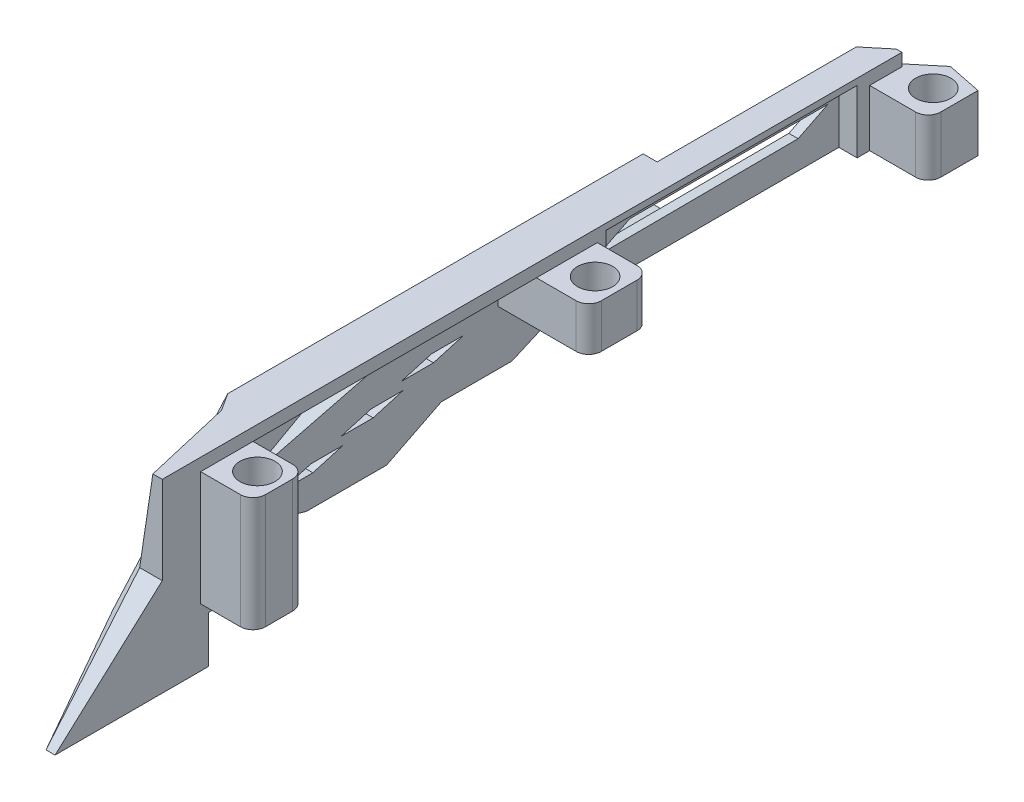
ISO-10303-21;
HEADER;
FILE_DESCRIPTION(('STEP AP214'),'2;1');
FILE_NAME('part.step','',(''),(''),'','','');
FILE_SCHEMA(('AUTOMOTIVE_DESIGN { 1 0 10303 214 1 1 1 1 }'));
ENDSEC;
DATA;
#1=APPLICATION_CONTEXT('core data for automotive mechanical design processes');
#2=APPLICATION_PROTOCOL_DEFINITION('international standard','automotive_design',2000,#1);
#3=PRODUCT_CONTEXT('',#1,'mechanical');
#4=PRODUCT('Part','Part','',(#3));
#5=PRODUCT_RELATED_PRODUCT_CATEGORY('part','',(#4));
#6=PRODUCT_DEFINITION_FORMATION('','',#4);
#7=PRODUCT_DEFINITION_CONTEXT('part definition',#1,'design');
#8=PRODUCT_DEFINITION('design','',#6,#7);
#9=PRODUCT_DEFINITION_SHAPE('','',#8);
#10=(LENGTH_UNIT() NAMED_UNIT(*) SI_UNIT(.MILLI.,.METRE.));
#11=(NAMED_UNIT(*) PLANE_ANGLE_UNIT() SI_UNIT($,.RADIAN.));
#12=(NAMED_UNIT(*) SI_UNIT($,.STERADIAN.) SOLID_ANGLE_UNIT());
#13=UNCERTAINTY_MEASURE_WITH_UNIT(LENGTH_MEASURE(1.E-05),#10,'distance_accuracy_value','');
#14=(GEOMETRIC_REPRESENTATION_CONTEXT(3) GLOBAL_UNCERTAINTY_ASSIGNED_CONTEXT((#13)) GLOBAL_UNIT_ASSIGNED_CONTEXT((#10,
#11,#12)) REPRESENTATION_CONTEXT('',''));
#15=CARTESIAN_POINT('',(0.,0.,0.));
#16=DIRECTION('',(0.,0.,1.));
#17=DIRECTION('',(1.,0.,0.));
#18=AXIS2_PLACEMENT_3D('',#15,#16,#17);
#19=CARTESIAN_POINT('',(0.,0.,14.4857432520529));
#20=DIRECTION('',(0.,0.,-1.));
#21=DIRECTION('',(0.,-1.,0.));
#22=AXIS2_PLACEMENT_3D('',#19,#20,#21);
#23=PLANE('',#22);
#24=DIRECTION('',(0.,-1.,0.));
#25=VECTOR('',#24,1.);
#26=CARTESIAN_POINT('',(4.89281701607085,0.,14.4857432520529));
#27=LINE('',#26,#25);
#28=CARTESIAN_POINT('',(4.89281701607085,-0.0498835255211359,14.4857432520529));
#29=VERTEX_POINT('',#28);
#30=CARTESIAN_POINT('',(4.89281701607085,-5.08338254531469,14.4857432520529));
#31=VERTEX_POINT('',#30);
#32=EDGE_CURVE('E873',#29,#31,#27,.T.);
#33=ORIENTED_EDGE('',*,*,#32,.T.);
#34=DIRECTION('',(-0.195478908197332,0.9807079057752,0.));
#35=VECTOR('',#34,1.);
#36=CARTESIAN_POINT('',(3.73132904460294,0.743744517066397,14.4857432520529));
#37=LINE('',#36,#35);
#38=CARTESIAN_POINT('',(3.88951839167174,-0.0498835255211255,14.4857432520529));
#39=VERTEX_POINT('',#38);
#40=EDGE_CURVE('E836',#31,#39,#37,.T.);
#41=ORIENTED_EDGE('',*,*,#40,.T.);
#42=DIRECTION('',(-1.,0.,0.));
#43=VECTOR('',#42,1.);
#44=CARTESIAN_POINT('',(7.37540173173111,-0.0498835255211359,14.4857432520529));
#45=LINE('',#44,#43);
#46=EDGE_CURVE('E569',#29,#39,#45,.T.);
#47=ORIENTED_EDGE('',*,*,#46,.F.);
#48=EDGE_LOOP('',(#33,#41,#47));
#49=FACE_BOUND('',#48,.T.);
#50=ADVANCED_FACE('F45',(#49),#23,.T.);
#51=CARTESIAN_POINT('',(7.37540173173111,0.,15.3137702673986));
#52=DIRECTION('',(0.31639929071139,0.,-0.948626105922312));
#53=DIRECTION('',(0.948626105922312,0.,0.31639929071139));
#54=AXIS2_PLACEMENT_3D('',#51,#52,#53);
#55=PLANE('',#54);
#56=DIRECTION('',(0.,-1.,0.));
#57=VECTOR('',#56,1.);
#58=CARTESIAN_POINT('',(7.37540173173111,0.,15.3137702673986));
#59=LINE('',#58,#57);
#60=CARTESIAN_POINT('',(7.37540173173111,-0.0498835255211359,15.3137702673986));
#61=VERTEX_POINT('',#60);
#62=CARTESIAN_POINT('',(7.37540173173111,-7.49403452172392,15.3137702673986));
#63=VERTEX_POINT('',#62);
#64=EDGE_CURVE('E563',#61,#63,#59,.T.);
#65=ORIENTED_EDGE('',*,*,#64,.T.);
#66=DIRECTION('',(-0.948626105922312,0.,-0.31639929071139));
#67=VECTOR('',#66,1.);
#68=CARTESIAN_POINT('',(7.37540173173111,-7.49403452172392,15.3137702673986));
#69=LINE('',#68,#67);
#70=CARTESIAN_POINT('',(5.37628584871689,-7.49403452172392,14.6469966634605));
#71=VERTEX_POINT('',#70);
#72=EDGE_CURVE('E823',#63,#71,#69,.T.);
#73=ORIENTED_EDGE('',*,*,#72,.T.);
#74=DIRECTION('',(-0.196217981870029,0.978373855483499,-0.0654454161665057));
#75=VECTOR('',#74,1.);
#76=CARTESIAN_POINT('',(4.02315336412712,-0.747102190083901,14.1956806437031));
#77=LINE('',#76,#75);
#78=EDGE_CURVE('E842',#71,#31,#77,.T.);
#79=ORIENTED_EDGE('',*,*,#78,.T.);
#80=ORIENTED_EDGE('',*,*,#32,.F.);
#81=DIRECTION('',(-0.948626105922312,0.,-0.31639929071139));
#82=VECTOR('',#81,1.);
#83=CARTESIAN_POINT('',(7.37540173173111,-0.0498835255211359,15.3137702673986));
#84=LINE('',#83,#82);
#85=EDGE_CURVE('E567',#61,#29,#84,.T.);
#86=ORIENTED_EDGE('',*,*,#85,.F.);
#87=EDGE_LOOP('',(#65,#73,#79,#80,#86));
#88=FACE_BOUND('',#87,.T.);
#89=ADVANCED_FACE('F648',(#88),#55,.T.);
#90=CARTESIAN_POINT('',(15.7023645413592,0.,8.20174951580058));
#91=DIRECTION('',(1.,0.,0.));
#92=DIRECTION('',(0.,0.,1.));
#93=AXIS2_PLACEMENT_3D('',#90,#91,#92);
#94=PLANE('',#93);
#95=DIRECTION('',(0.,0.,1.));
#96=VECTOR('',#95,1.);
#97=CARTESIAN_POINT('',(15.7023645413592,1.77000941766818,8.20174951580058));
#98=LINE('',#97,#96);
#99=CARTESIAN_POINT('',(15.7023645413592,1.77000941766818,10.2017495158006));
#100=VERTEX_POINT('',#99);
#101=CARTESIAN_POINT('',(15.7023645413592,1.77000941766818,14.5399094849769));
#102=VERTEX_POINT('',#101);
#103=EDGE_CURVE('E591',#100,#102,#98,.T.);
#104=ORIENTED_EDGE('',*,*,#103,.F.);
#105=DIRECTION('',(0.,1.,0.));
#106=VECTOR('',#105,1.);
#107=CARTESIAN_POINT('',(15.7023645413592,1.77000941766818,10.2017495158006));
#108=LINE('',#107,#106);
#109=CARTESIAN_POINT('',(15.7023645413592,20.0059648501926,10.2017495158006));
#110=VERTEX_POINT('',#109);
#111=EDGE_CURVE('E1101',#110,#100,#108,.F.);
#112=ORIENTED_EDGE('',*,*,#111,.F.);
#113=DIRECTION('',(0.,0.,1.));
#114=VECTOR('',#113,1.);
#115=CARTESIAN_POINT('',(15.7023645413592,20.0059648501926,8.20174951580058));
#116=LINE('',#115,#114);
#117=CARTESIAN_POINT('',(15.7023645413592,20.0059648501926,14.5399094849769));
#118=VERTEX_POINT('',#117);
#119=EDGE_CURVE('E1106',#110,#118,#116,.T.);
#120=ORIENTED_EDGE('',*,*,#119,.T.);
#121=DIRECTION('',(0.,1.,0.));
#122=VECTOR('',#121,1.);
#123=CARTESIAN_POINT('',(15.7023645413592,20.0059648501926,14.5399094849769));
#124=LINE('',#123,#122);
#125=EDGE_CURVE('E1480',#102,#118,#124,.T.);
#126=ORIENTED_EDGE('',*,*,#125,.F.);
#127=EDGE_LOOP('',(#104,#112,#120,#126));
#128=FACE_BOUND('',#127,.T.);
#129=ADVANCED_FACE('F654',(#128),#94,.T.);
#130=CARTESIAN_POINT('',(12.9754017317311,19.5059648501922,16.5399094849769));
#131=DIRECTION('',(0.,0.,-1.));
#132=DIRECTION('',(1.,0.,0.));
#133=AXIS2_PLACEMENT_3D('',#130,#131,#132);
#134=PLANE('',#133);
#135=DIRECTION('',(1.,0.,0.));
#136=VECTOR('',#135,1.);
#137=CARTESIAN_POINT('',(7.37540173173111,1.77000941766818,16.5399094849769));
#138=LINE('',#137,#136);
#139=CARTESIAN_POINT('',(7.37540173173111,1.77000941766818,16.5399094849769));
#140=VERTEX_POINT('',#139);
#141=CARTESIAN_POINT('',(13.7023645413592,1.77000941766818,16.5399094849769));
#142=VERTEX_POINT('',#141);
#143=EDGE_CURVE('E586',#140,#142,#138,.T.);
#144=ORIENTED_EDGE('',*,*,#143,.T.);
#145=DIRECTION('',(0.,1.,0.));
#146=VECTOR('',#145,1.);
#147=CARTESIAN_POINT('',(13.7023645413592,0.,16.5399094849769));
#148=LINE('',#147,#146);
#149=CARTESIAN_POINT('',(13.7023645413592,20.0059648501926,16.5399094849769));
#150=VERTEX_POINT('',#149);
#151=EDGE_CURVE('E1125',#150,#142,#148,.F.);
#152=ORIENTED_EDGE('',*,*,#151,.F.);
#153=DIRECTION('',(-1.,0.,0.));
#154=VECTOR('',#153,1.);
#155=CARTESIAN_POINT('',(12.9754017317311,20.0059648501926,16.5399094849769));
#156=LINE('',#155,#154);
#157=CARTESIAN_POINT('',(7.37540173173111,20.0059648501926,16.5399094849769));
#158=VERTEX_POINT('',#157);
#159=EDGE_CURVE('E1429',#150,#158,#156,.T.);
#160=ORIENTED_EDGE('',*,*,#159,.T.);
#161=DIRECTION('',(0.,-1.,0.));
#162=VECTOR('',#161,1.);
#163=CARTESIAN_POINT('',(7.37540173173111,20.0059648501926,16.5399094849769));
#164=LINE('',#163,#162);
#165=EDGE_CURVE('E888',#158,#140,#164,.T.);
#166=ORIENTED_EDGE('',*,*,#165,.T.);
#167=EDGE_LOOP('',(#144,#152,#160,#166));
#168=FACE_BOUND('',#167,.T.);
#169=ADVANCED_FACE('F664',(#168),#134,.F.);
#170=CARTESIAN_POINT('',(13.7023645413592,0.,14.5399094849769));
#171=DIRECTION('',(0.,-1.,0.));
#172=DIRECTION('',(0.,0.,1.));
#173=AXIS2_PLACEMENT_3D('',#170,#171,#172);
#174=CYLINDRICAL_SURFACE('',#173,2.);
#175=ORIENTED_EDGE('',*,*,#125,.T.);
#176=CARTESIAN_POINT('',(13.7023645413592,20.0059648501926,14.5399094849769));
#177=DIRECTION('',(0.,1.,0.));
#178=DIRECTION('',(0.,0.,1.));
#179=AXIS2_PLACEMENT_3D('',#176,#177,#178);
#180=CIRCLE('',#179,2.);
#181=EDGE_CURVE('E1109',#118,#150,#180,.F.);
#182=ORIENTED_EDGE('',*,*,#181,.T.);
#183=ORIENTED_EDGE('',*,*,#151,.T.);
#184=CARTESIAN_POINT('',(13.7023645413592,1.77000941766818,14.5399094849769));
#185=DIRECTION('',(0.,1.,0.));
#186=DIRECTION('',(0.,0.,1.));
#187=AXIS2_PLACEMENT_3D('',#184,#185,#186);
#188=CIRCLE('',#187,2.);
#189=EDGE_CURVE('E589',#142,#102,#188,.T.);
#190=ORIENTED_EDGE('',*,*,#189,.T.);
#191=EDGE_LOOP('',(#175,#182,#183,#190));
#192=FACE_BOUND('',#191,.T.);
#193=ADVANCED_FACE('F1487',(#192),#174,.T.);
#194=CARTESIAN_POINT('',(0.,20.0059648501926,-54.7660366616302));
#195=DIRECTION('',(0.,0.96052987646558,0.278176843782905));
#196=DIRECTION('',(0.,0.278176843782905,-0.96052987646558));
#197=AXIS2_PLACEMENT_3D('',#194,#195,#196);
#198=PLANE('',#197);
#199=DIRECTION('',(0.0729280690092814,-0.277436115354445,0.957972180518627));
#200=VECTOR('',#199,1.);
#201=CARTESIAN_POINT('',(2.85580431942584,3.8826162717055,0.907030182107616));
#202=LINE('',#201,#200);
#203=CARTESIAN_POINT('',(5.77426927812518,-7.21991463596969,39.2434294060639));
#204=VERTEX_POINT('',#203);
#205=EDGE_CURVE('E874',#39,#204,#202,.T.);
#206=ORIENTED_EDGE('',*,*,#205,.T.);
#207=DIRECTION('',(0.179196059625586,-0.273674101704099,0.944982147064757));
#208=VECTOR('',#207,1.);
#209=CARTESIAN_POINT('',(-11.6656412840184,19.4148861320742,-52.725073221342));
#210=LINE('',#209,#208);
#211=CARTESIAN_POINT('',(0.775401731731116,0.414517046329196,12.8821927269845));
#212=VERTEX_POINT('',#211);
#213=EDGE_CURVE('E852',#212,#204,#210,.T.);
#214=ORIENTED_EDGE('',*,*,#213,.F.);
#215=DIRECTION('',(0.345697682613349,-0.261026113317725,0.901309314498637));
#216=VECTOR('',#215,1.);
#217=CARTESIAN_POINT('',(-22.1629923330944,17.7346211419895,-46.9232073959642));
#218=LINE('',#217,#216);
#219=CARTESIAN_POINT('',(0.,0.99999999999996,10.860551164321));
#220=VERTEX_POINT('',#219);
#221=EDGE_CURVE('E855',#220,#212,#218,.T.);
#222=ORIENTED_EDGE('',*,*,#221,.F.);
#223=DIRECTION('',(0.,-0.278176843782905,0.96052987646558));
#224=VECTOR('',#223,1.);
#225=CARTESIAN_POINT('',(0.,2.24999999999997,6.54436751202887));
#226=LINE('',#225,#224);
#227=CARTESIAN_POINT('',(0.,3.,3.95465732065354));
#228=VERTEX_POINT('',#227);
#229=EDGE_CURVE('E1409',#228,#220,#226,.T.);
#230=ORIENTED_EDGE('',*,*,#229,.F.);
#231=DIRECTION('',(-1.,0.,0.));
#232=VECTOR('',#231,1.);
#233=CARTESIAN_POINT('',(12.9754017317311,3.,3.95465732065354));
#234=LINE('',#233,#232);
#235=CARTESIAN_POINT('',(1.27540173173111,3.,3.95465732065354));
#236=VERTEX_POINT('',#235);
#237=EDGE_CURVE('E989',#236,#228,#234,.T.);
#238=ORIENTED_EDGE('',*,*,#237,.F.);
#239=DIRECTION('',(0.,-0.278176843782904,0.96052987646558));
#240=VECTOR('',#239,1.);
#241=CARTESIAN_POINT('',(1.27540173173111,3.,3.95465732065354));
#242=LINE('',#241,#240);
#243=CARTESIAN_POINT('',(1.27540173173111,1.77000941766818,8.20174951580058));
#244=VERTEX_POINT('',#243);
#245=EDGE_CURVE('E1200',#236,#244,#242,.T.);
#246=ORIENTED_EDGE('',*,*,#245,.T.);
#247=DIRECTION('',(-1.,0.,0.));
#248=VECTOR('',#247,1.);
#249=CARTESIAN_POINT('',(7.37540173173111,1.77000941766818,8.20174951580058));
#250=LINE('',#249,#248);
#251=CARTESIAN_POINT('',(7.37540173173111,1.77000941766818,8.20174951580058));
#252=VERTEX_POINT('',#251);
#253=EDGE_CURVE('E564',#252,#244,#250,.T.);
#254=ORIENTED_EDGE('',*,*,#253,.F.);
#255=DIRECTION('',(0.,-0.278176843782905,0.96052987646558));
#256=VECTOR('',#255,1.);
#257=CARTESIAN_POINT('',(7.37540173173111,1.77000941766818,8.20174951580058));
#258=LINE('',#257,#256);
#259=CARTESIAN_POINT('',(7.37540173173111,-0.0498835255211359,14.4857432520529));
#260=VERTEX_POINT('',#259);
#261=EDGE_CURVE('E560',#252,#260,#258,.T.);
#262=ORIENTED_EDGE('',*,*,#261,.T.);
#263=EDGE_CURVE('E69',#260,#29,#45,.T.);
#264=ORIENTED_EDGE('',*,*,#263,.T.);
#265=ORIENTED_EDGE('',*,*,#46,.T.);
#266=EDGE_LOOP('',(#206,#214,#222,#230,#238,#246,#254,#262,#264,#265));
#267=FACE_BOUND('',#266,.T.);
#268=ADVANCED_FACE('F572',(#267),#198,.F.);
#269=CARTESIAN_POINT('',(13.7023645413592,-7.49403452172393,10.2017495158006));
#270=DIRECTION('',(0.,-1.,0.));
#271=DIRECTION('',(0.,0.,1.));
#272=AXIS2_PLACEMENT_3D('',#269,#270,#271);
#273=CYLINDRICAL_SURFACE('',#272,2.);
#274=DIRECTION('',(0.,1.,0.));
#275=VECTOR('',#274,1.);
#276=CARTESIAN_POINT('',(13.7023645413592,20.0059648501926,8.20174951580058));
#277=LINE('',#276,#275);
#278=CARTESIAN_POINT('',(13.7023645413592,1.77000941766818,8.20174951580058));
#279=VERTEX_POINT('',#278);
#280=CARTESIAN_POINT('',(13.7023645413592,20.0059648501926,8.20174951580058));
#281=VERTEX_POINT('',#280);
#282=EDGE_CURVE('E986',#279,#281,#277,.T.);
#283=ORIENTED_EDGE('',*,*,#282,.T.);
#284=CARTESIAN_POINT('',(13.7023645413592,20.0059648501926,10.2017495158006));
#285=DIRECTION('',(0.,1.,0.));
#286=DIRECTION('',(0.,0.,1.));
#287=AXIS2_PLACEMENT_3D('',#284,#285,#286);
#288=CIRCLE('',#287,2.);
#289=EDGE_CURVE('E1110',#281,#110,#288,.F.);
#290=ORIENTED_EDGE('',*,*,#289,.T.);
#291=ORIENTED_EDGE('',*,*,#111,.T.);
#292=CARTESIAN_POINT('',(13.7023645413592,1.77000941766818,10.2017495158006));
#293=DIRECTION('',(0.,1.,0.));
#294=DIRECTION('',(0.,0.,1.));
#295=AXIS2_PLACEMENT_3D('',#292,#293,#294);
#296=CIRCLE('',#295,2.);
#297=EDGE_CURVE('E11',#279,#100,#296,.F.);
#298=ORIENTED_EDGE('',*,*,#297,.F.);
#299=EDGE_LOOP('',(#283,#290,#291,#298));
#300=FACE_BOUND('',#299,.T.);
#301=ADVANCED_FACE('F1475',(#300),#273,.T.);
#302=CARTESIAN_POINT('',(0.,22.0059648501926,0.));
#303=DIRECTION('',(0.,1.,0.));
#304=DIRECTION('',(0.,0.,-1.));
#305=AXIS2_PLACEMENT_3D('',#302,#303,#304);
#306=PLANE('',#305);
#307=DIRECTION('',(0.225958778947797,0.,0.974136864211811));
#308=VECTOR('',#307,1.);
#309=CARTESIAN_POINT('',(0.588938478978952,22.0059648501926,-0.136608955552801));
#310=LINE('',#309,#308);
#311=CARTESIAN_POINT('',(2.57203623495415,22.0059648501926,8.41277619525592));
#312=VERTEX_POINT('',#311);
#313=CARTESIAN_POINT('',(5.87540173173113,22.0059648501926,22.6540024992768));
#314=VERTEX_POINT('',#313);
#315=EDGE_CURVE('E604',#312,#314,#310,.T.);
#316=ORIENTED_EDGE('',*,*,#315,.T.);
#317=DIRECTION('',(1.,0.,0.));
#318=VECTOR('',#317,1.);
#319=CARTESIAN_POINT('',(0.,22.0059648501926,22.6540024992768));
#320=LINE('',#319,#318);
#321=CARTESIAN_POINT('',(7.37540173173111,22.0059648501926,22.6540024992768));
#322=VERTEX_POINT('',#321);
#323=EDGE_CURVE('E598',#314,#322,#320,.T.);
#324=ORIENTED_EDGE('',*,*,#323,.T.);
#325=DIRECTION('',(0.,0.,-1.));
#326=VECTOR('',#325,1.);
#327=CARTESIAN_POINT('',(7.37540173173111,22.0059648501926,20.4464081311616));
#328=LINE('',#327,#326);
#329=CARTESIAN_POINT('',(7.37540173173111,22.0059648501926,-95.1512149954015));
#330=VERTEX_POINT('',#329);
#331=EDGE_CURVE('E935',#322,#330,#328,.T.);
#332=ORIENTED_EDGE('',*,*,#331,.T.);
#333=DIRECTION('',(-1.,0.,0.));
#334=VECTOR('',#333,1.);
#335=CARTESIAN_POINT('',(6.97540173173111,22.0059648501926,-95.1512149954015));
#336=LINE('',#335,#334);
#337=CARTESIAN_POINT('',(6.47540173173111,22.0059648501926,-95.1512149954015));
#338=VERTEX_POINT('',#337);
#339=EDGE_CURVE('E1297',#330,#338,#336,.T.);
#340=ORIENTED_EDGE('',*,*,#339,.T.);
#341=DIRECTION('',(-0.769421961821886,0.,0.638740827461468));
#342=VECTOR('',#341,1.);
#343=CARTESIAN_POINT('',(10.2335555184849,22.0059648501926,-98.2710716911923));
#344=LINE('',#343,#342);
#345=CARTESIAN_POINT('',(3.00000000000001,22.0059648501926,-92.2660868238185));
#346=VERTEX_POINT('',#345);
#347=EDGE_CURVE('E1150',#338,#346,#344,.T.);
#348=ORIENTED_EDGE('',*,*,#347,.T.);
#349=DIRECTION('',(0.,0.,-1.));
#350=VECTOR('',#349,1.);
#351=CARTESIAN_POINT('',(2.99999999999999,22.0059648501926,-58.5351260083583));
#352=LINE('',#351,#350);
#353=CARTESIAN_POINT('',(2.99999999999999,22.0059648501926,-60.5351260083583));
#354=VERTEX_POINT('',#353);
#355=EDGE_CURVE('E833',#354,#346,#352,.T.);
#356=ORIENTED_EDGE('',*,*,#355,.F.);
#357=DIRECTION('',(-1.,0.,0.));
#358=VECTOR('',#357,1.);
#359=CARTESIAN_POINT('',(2.99999999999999,22.0059648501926,-60.5351260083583));
#360=LINE('',#359,#358);
#361=CARTESIAN_POINT('',(0.775401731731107,22.0059648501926,-60.5351260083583));
#362=VERTEX_POINT('',#361);
#363=EDGE_CURVE('E1085',#354,#362,#360,.T.);
#364=ORIENTED_EDGE('',*,*,#363,.T.);
#365=DIRECTION('',(0.,0.,-1.));
#366=VECTOR('',#365,1.);
#367=CARTESIAN_POINT('',(0.775401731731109,22.0059648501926,10.4464081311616));
#368=LINE('',#367,#366);
#369=CARTESIAN_POINT('',(0.775401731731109,22.0059648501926,5.63082027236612));
#370=VERTEX_POINT('',#369);
#371=EDGE_CURVE('E1082',#370,#362,#368,.T.);
#372=ORIENTED_EDGE('',*,*,#371,.F.);
#373=DIRECTION('',(-0.542515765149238,0.,-0.840045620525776));
#374=VECTOR('',#373,1.);
#375=CARTESIAN_POINT('',(-2.01899583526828,22.0059648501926,1.30390188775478));
#376=LINE('',#375,#374);
#377=EDGE_CURVE('E594',#312,#370,#376,.T.);
#378=ORIENTED_EDGE('',*,*,#377,.F.);
#379=EDGE_LOOP('',(#316,#324,#332,#340,#348,#356,#364,#372,#378));
#380=FACE_BOUND('',#379,.T.);
#381=ADVANCED_FACE('F1375',(#380),#306,.T.);
#382=CARTESIAN_POINT('',(3.,-7.49403452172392,13.3638269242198));
#383=DIRECTION('',(0.,-1.,0.));
#384=DIRECTION('',(0.,0.,1.));
#385=AXIS2_PLACEMENT_3D('',#382,#383,#384);
#386=PLANE('',#385);
#387=DIRECTION('',(-0.0445682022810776,0.,-0.99900634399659));
#388=VECTOR('',#387,1.);
#389=CARTESIAN_POINT('',(4.75348187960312,-7.49403452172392,13.2855996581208));
#390=LINE('',#389,#388);
#391=CARTESIAN_POINT('',(5.93334081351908,-7.49403452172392,39.7324047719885));
#392=VERTEX_POINT('',#391);
#393=CARTESIAN_POINT('',(5.77089419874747,-7.49403452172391,36.0911271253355));
#394=VERTEX_POINT('',#393);
#395=EDGE_CURVE('E599',#392,#394,#390,.T.);
#396=ORIENTED_EDGE('',*,*,#395,.T.);
#397=DIRECTION('',(-0.018398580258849,0.,-0.999830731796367));
#398=VECTOR('',#397,1.);
#399=CARTESIAN_POINT('',(5.3518769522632,-7.49403452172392,13.3205484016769));
#400=LINE('',#399,#398);
#401=EDGE_CURVE('E845',#394,#71,#400,.T.);
#402=ORIENTED_EDGE('',*,*,#401,.T.);
#403=ORIENTED_EDGE('',*,*,#72,.F.);
#404=DIRECTION('',(0.,0.,1.));
#405=VECTOR('',#404,1.);
#406=CARTESIAN_POINT('',(7.37540173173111,-7.49403452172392,15.3137702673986));
#407=LINE('',#406,#405);
#408=CARTESIAN_POINT('',(7.37540173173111,-7.49403452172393,39.7325054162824));
#409=VERTEX_POINT('',#408);
#410=EDGE_CURVE('E938',#63,#409,#407,.T.);
#411=ORIENTED_EDGE('',*,*,#410,.T.);
#412=DIRECTION('',(1.,0.,0.));
#413=VECTOR('',#412,1.);
#414=CARTESIAN_POINT('',(-3.00000000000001,-7.49403452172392,39.7325054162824));
#415=LINE('',#414,#413);
#416=CARTESIAN_POINT('',(5.93340328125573,-7.49403452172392,39.7325054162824));
#417=VERTEX_POINT('',#416);
#418=EDGE_CURVE('E832',#417,#409,#415,.T.);
#419=ORIENTED_EDGE('',*,*,#418,.F.);
#420=DIRECTION('',(0.542515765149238,0.,0.840045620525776));
#421=VECTOR('',#420,1.);
#422=CARTESIAN_POINT('',(-6.94717263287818,-7.49403452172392,19.7878803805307));
#423=LINE('',#422,#421);
#424=EDGE_CURVE('E828',#392,#417,#423,.T.);
#425=ORIENTED_EDGE('',*,*,#424,.F.);
#426=EDGE_LOOP('',(#396,#402,#403,#411,#419,#425));
#427=FACE_BOUND('',#426,.T.);
#428=ADVANCED_FACE('F1661',(#427),#386,.T.);
#429=CARTESIAN_POINT('',(0.775401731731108,0.,0.));
#430=DIRECTION('',(-1.,0.,0.));
#431=DIRECTION('',(0.,0.,-1.));
#432=AXIS2_PLACEMENT_3D('',#429,#430,#431);
#433=PLANE('',#432);
#434=ORIENTED_EDGE('',*,*,#371,.T.);
#435=DIRECTION('',(0.,-1.,0.));
#436=VECTOR('',#435,1.);
#437=CARTESIAN_POINT('',(0.775401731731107,22.0059648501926,-60.5351260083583));
#438=LINE('',#437,#436);
#439=CARTESIAN_POINT('',(0.775401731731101,21.006622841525,-60.5351260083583));
#440=VERTEX_POINT('',#439);
#441=EDGE_CURVE('E1088',#362,#440,#438,.T.);
#442=ORIENTED_EDGE('',*,*,#441,.T.);
#443=DIRECTION('',(0.,-0.447448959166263,0.894309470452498));
#444=VECTOR('',#443,1.);
#445=CARTESIAN_POINT('',(0.775401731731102,19.7813665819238,-58.0862248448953));
#446=LINE('',#445,#444);
#447=CARTESIAN_POINT('',(0.775401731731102,19.7813665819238,-58.0862248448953));
#448=VERTEX_POINT('',#447);
#449=EDGE_CURVE('E1103',#440,#448,#446,.T.);
#450=ORIENTED_EDGE('',*,*,#449,.T.);
#451=DIRECTION('',(0.,0.,1.));
#452=VECTOR('',#451,1.);
#453=CARTESIAN_POINT('',(0.775401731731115,19.7813665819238,-60.5351260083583));
#454=LINE('',#453,#452);
#455=CARTESIAN_POINT('',(0.775401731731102,19.7813665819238,-57.5842720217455));
#456=VERTEX_POINT('',#455);
#457=EDGE_CURVE('E1092',#448,#456,#454,.T.);
#458=ORIENTED_EDGE('',*,*,#457,.T.);
#459=CARTESIAN_POINT('',(0.775401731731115,19.7813665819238,-9.28114017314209));
#460=VERTEX_POINT('',#459);
#461=EDGE_CURVE('E982',#456,#460,#454,.T.);
#462=ORIENTED_EDGE('',*,*,#461,.T.);
#463=DIRECTION('',(0.,-0.484953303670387,0.87454004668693));
#464=VECTOR('',#463,1.);
#465=CARTESIAN_POINT('',(0.775401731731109,11.1929561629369,6.20676101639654));
#466=LINE('',#465,#464);
#467=CARTESIAN_POINT('',(0.77540173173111,1.39413185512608,23.8774608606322));
#468=VERTEX_POINT('',#467);
#469=EDGE_CURVE('E1395',#460,#468,#466,.T.);
#470=ORIENTED_EDGE('',*,*,#469,.T.);
#471=DIRECTION('',(0.,-0.748760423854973,0.662840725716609));
#472=VECTOR('',#471,1.);
#473=CARTESIAN_POINT('',(0.775401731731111,12.4631191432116,14.0786315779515));
#474=LINE('',#473,#472);
#475=EDGE_CURVE('E820',#370,#468,#474,.T.);
#476=ORIENTED_EDGE('',*,*,#475,.F.);
#477=EDGE_LOOP('',(#434,#442,#450,#458,#462,#470,#476));
#478=FACE_BOUND('',#477,.T.);
#479=ADVANCED_FACE('F780',(#478),#433,.T.);
#480=CARTESIAN_POINT('',(-2.62459826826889,8.02359469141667,22.6540024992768));
#481=DIRECTION('',(0.,-0.740118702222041,-0.672476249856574));
#482=DIRECTION('',(0.,-0.672476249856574,0.740118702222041));
#483=AXIS2_PLACEMENT_3D('',#480,#481,#482);
#484=PLANE('',#483);
#485=DIRECTION('',(0.0931135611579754,-0.669554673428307,0.736903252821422));
#486=VECTOR('',#485,1.);
#487=CARTESIAN_POINT('',(3.71991286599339,8.42260025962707,22.2148621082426));
#488=LINE('',#487,#486);
#489=CARTESIAN_POINT('',(3.77540173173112,8.02359469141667,22.6540024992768));
#490=VERTEX_POINT('',#489);
#491=EDGE_CURVE('E815',#490,#417,#488,.T.);
#492=ORIENTED_EDGE('',*,*,#491,.T.);
#493=ORIENTED_EDGE('',*,*,#418,.T.);
#494=DIRECTION('',(0.,-0.672476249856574,0.740118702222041));
#495=VECTOR('',#494,1.);
#496=CARTESIAN_POINT('',(7.37540173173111,8.02359469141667,22.6540024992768));
#497=LINE('',#496,#495);
#498=CARTESIAN_POINT('',(7.37540173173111,8.02359469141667,22.6540024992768));
#499=VERTEX_POINT('',#498);
#500=EDGE_CURVE('E857',#499,#409,#497,.T.);
#501=ORIENTED_EDGE('',*,*,#500,.F.);
#502=DIRECTION('',(1.,0.,0.));
#503=VECTOR('',#502,1.);
#504=CARTESIAN_POINT('',(-2.62459826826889,8.02359469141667,22.6540024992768));
#505=LINE('',#504,#503);
#506=EDGE_CURVE('E822',#490,#499,#505,.T.);
#507=ORIENTED_EDGE('',*,*,#506,.F.);
#508=EDGE_LOOP('',(#492,#493,#501,#507));
#509=FACE_BOUND('',#508,.T.);
#510=ADVANCED_FACE('F777',(#509),#484,.F.);
#511=CARTESIAN_POINT('',(0.325895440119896,0.16318702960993,-0.0145390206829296));
#512=DIRECTION('',(0.893453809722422,0.447382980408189,-0.039859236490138));
#513=DIRECTION('',(-0.447738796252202,0.894164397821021,0.));
#514=AXIS2_PLACEMENT_3D('',#511,#512,#513);
#515=PLANE('',#514);
#516=DIRECTION('',(-0.272993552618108,0.470422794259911,-0.839152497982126));
#517=VECTOR('',#516,1.);
#518=CARTESIAN_POINT('',(-4.57327336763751,10.6109747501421,7.43621517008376));
#519=LINE('',#518,#517);
#520=EDGE_CURVE('E808',#204,#468,#519,.T.);
#521=ORIENTED_EDGE('',*,*,#520,.T.);
#522=DIRECTION('',(0.,-0.0887427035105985,-0.996054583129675));
#523=VECTOR('',#522,1.);
#524=CARTESIAN_POINT('',(0.775401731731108,-0.72743759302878,0.0648104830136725));
#525=LINE('',#524,#523);
#526=EDGE_CURVE('E949',#468,#212,#525,.T.);
#527=ORIENTED_EDGE('',*,*,#526,.T.);
#528=ORIENTED_EDGE('',*,*,#213,.T.);
#529=EDGE_LOOP('',(#521,#527,#528));
#530=FACE_BOUND('',#529,.T.);
#531=ADVANCED_FACE('F779',(#530),#515,.F.);
#532=DIRECTION('',(-0.272993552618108,0.470422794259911,-0.839152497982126));
#533=VECTOR('',#532,1.);
#534=CARTESIAN_POINT('',(-4.57327336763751,10.6109747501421,7.43621517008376));
#535=LINE('',#534,#533);
#536=EDGE_CURVE('E810',#392,#204,#535,.T.);
#537=ORIENTED_EDGE('',*,*,#536,.T.);
#538=DIRECTION('',(-0.00106429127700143,-0.08663373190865,-0.996239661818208));
#539=VECTOR('',#538,1.);
#540=CARTESIAN_POINT('',(5.73331160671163,-10.553272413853,0.911595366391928));
#541=LINE('',#540,#539);
#542=EDGE_CURVE('E834',#204,#394,#541,.T.);
#543=ORIENTED_EDGE('',*,*,#542,.T.);
#544=ORIENTED_EDGE('',*,*,#395,.F.);
#545=EDGE_LOOP('',(#537,#543,#544));
#546=FACE_BOUND('',#545,.T.);
#547=ADVANCED_FACE('F789',(#546),#515,.F.);
#548=CARTESIAN_POINT('',(-2.62459826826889,8.02359469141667,22.6540024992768));
#549=DIRECTION('',(0.,0.,-1.));
#550=DIRECTION('',(1.,0.,0.));
#551=AXIS2_PLACEMENT_3D('',#548,#549,#550);
#552=PLANE('',#551);
#553=ORIENTED_EDGE('',*,*,#506,.T.);
#554=DIRECTION('',(0.,-1.,0.));
#555=VECTOR('',#554,1.);
#556=CARTESIAN_POINT('',(7.37540173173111,8.02359469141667,22.6540024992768));
#557=LINE('',#556,#555);
#558=EDGE_CURVE('E869',#322,#499,#557,.T.);
#559=ORIENTED_EDGE('',*,*,#558,.F.);
#560=ORIENTED_EDGE('',*,*,#323,.F.);
#561=DIRECTION('',(0.148523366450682,0.988908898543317,0.));
#562=VECTOR('',#561,1.);
#563=CARTESIAN_POINT('',(3.63422291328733,7.08358778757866,22.6540024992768));
#564=LINE('',#563,#562);
#565=EDGE_CURVE('E595',#490,#314,#564,.T.);
#566=ORIENTED_EDGE('',*,*,#565,.F.);
#567=EDGE_LOOP('',(#553,#559,#560,#566));
#568=FACE_BOUND('',#567,.T.);
#569=ADVANCED_FACE('F47',(#568),#552,.F.);
#570=CARTESIAN_POINT('',(15.7023645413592,13.0059648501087,-90.0135087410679));
#571=DIRECTION('',(0.,0.,1.));
#572=DIRECTION('',(-1.,0.,0.));
#573=AXIS2_PLACEMENT_3D('',#570,#571,#572);
#574=PLANE('',#573);
#575=DIRECTION('',(1.,0.,0.));
#576=VECTOR('',#575,1.);
#577=CARTESIAN_POINT('',(5.47540173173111,11.0059648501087,-90.0135087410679));
#578=LINE('',#577,#576);
#579=CARTESIAN_POINT('',(7.37540173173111,11.0059648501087,-90.0135087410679));
#580=VERTEX_POINT('',#579);
#581=CARTESIAN_POINT('',(14.7023645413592,11.0059648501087,-90.0135087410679));
#582=VERTEX_POINT('',#581);
#583=EDGE_CURVE('E1075',#580,#582,#578,.T.);
#584=ORIENTED_EDGE('',*,*,#583,.T.);
#585=DIRECTION('',(0.,1.,0.));
#586=VECTOR('',#585,1.);
#587=CARTESIAN_POINT('',(14.7023645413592,13.0059648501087,-90.0135087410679));
#588=LINE('',#587,#586);
#589=CARTESIAN_POINT('',(14.7023645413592,20.0059648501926,-90.0135087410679));
#590=VERTEX_POINT('',#589);
#591=EDGE_CURVE('E871',#590,#582,#588,.F.);
#592=ORIENTED_EDGE('',*,*,#591,.F.);
#593=DIRECTION('',(-1.,0.,0.));
#594=VECTOR('',#593,1.);
#595=CARTESIAN_POINT('',(15.7023645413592,20.0059648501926,-90.0135087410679));
#596=LINE('',#595,#594);
#597=CARTESIAN_POINT('',(7.37540173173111,20.0059648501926,-90.0135087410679));
#598=VERTEX_POINT('',#597);
#599=EDGE_CURVE('E1048',#590,#598,#596,.T.);
#600=ORIENTED_EDGE('',*,*,#599,.T.);
#601=DIRECTION('',(0.,-1.,0.));
#602=VECTOR('',#601,1.);
#603=CARTESIAN_POINT('',(7.37540173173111,20.0059648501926,-90.0135087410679));
#604=LINE('',#603,#602);
#605=EDGE_CURVE('E928',#598,#580,#604,.T.);
#606=ORIENTED_EDGE('',*,*,#605,.T.);
#607=EDGE_LOOP('',(#584,#592,#600,#606));
#608=FACE_BOUND('',#607,.T.);
#609=ADVANCED_FACE('F1362',(#608),#574,.T.);
#610=CARTESIAN_POINT('',(-3.00000000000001,20.0059648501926,20.4464081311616));
#611=DIRECTION('',(0.,-1.,0.));
#612=DIRECTION('',(0.,0.,1.));
#613=AXIS2_PLACEMENT_3D('',#610,#611,#612);
#614=PLANE('',#613);
#615=CARTESIAN_POINT('',(12.8289596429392,20.0059648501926,-94.6901200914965));
#616=DIRECTION('',(0.,-1.,0.));
#617=DIRECTION('',(0.,0.,-1.));
#618=AXIS2_PLACEMENT_3D('',#615,#616,#617);
#619=CIRCLE('',#618,2.8);
#620=CARTESIAN_POINT('',(12.8289596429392,20.0059648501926,-97.4901200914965));
#621=VERTEX_POINT('',#620);
#622=EDGE_CURVE('E579',#621,#621,#619,.T.);
#623=ORIENTED_EDGE('',*,*,#622,.T.);
#624=EDGE_LOOP('',(#623));
#625=FACE_BOUND('',#624,.T.);
#626=DIRECTION('',(0.,0.,1.));
#627=VECTOR('',#626,1.);
#628=CARTESIAN_POINT('',(7.37540173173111,20.0059648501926,-95.1512149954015));
#629=LINE('',#628,#627);
#630=CARTESIAN_POINT('',(7.37540173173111,20.0059648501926,-95.1512149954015));
#631=VERTEX_POINT('',#630);
#632=EDGE_CURVE('E931',#631,#598,#629,.T.);
#633=ORIENTED_EDGE('',*,*,#632,.T.);
#634=ORIENTED_EDGE('',*,*,#599,.F.);
#635=CARTESIAN_POINT('',(14.7023645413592,20.0059648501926,-92.0135087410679));
#636=DIRECTION('',(0.,1.,0.));
#637=DIRECTION('',(0.,0.,1.));
#638=AXIS2_PLACEMENT_3D('',#635,#636,#637);
#639=CIRCLE('',#638,2.);
#640=CARTESIAN_POINT('',(16.7023645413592,20.0059648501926,-92.0135087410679));
#641=VERTEX_POINT('',#640);
#642=EDGE_CURVE('E1052',#641,#590,#639,.F.);
#643=ORIENTED_EDGE('',*,*,#642,.F.);
#644=DIRECTION('',(0.,0.,1.));
#645=VECTOR('',#644,1.);
#646=CARTESIAN_POINT('',(16.7023645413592,20.0059648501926,-99.8501200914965));
#647=LINE('',#646,#645);
#648=CARTESIAN_POINT('',(16.7023645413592,20.0059648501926,-97.9454713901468));
#649=VERTEX_POINT('',#648);
#650=EDGE_CURVE('E1126',#649,#641,#647,.T.);
#651=ORIENTED_EDGE('',*,*,#650,.F.);
#652=DIRECTION('',(0.980058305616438,0.,0.198710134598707));
#653=VECTOR('',#652,1.);
#654=CARTESIAN_POINT('',(20.8344866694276,20.0059648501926,-97.1076696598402));
#655=LINE('',#654,#653);
#656=CARTESIAN_POINT('',(11.1881134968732,20.0059648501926,-99.0635044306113));
#657=VERTEX_POINT('',#656);
#658=EDGE_CURVE('E1129',#657,#649,#655,.T.);
#659=ORIENTED_EDGE('',*,*,#658,.F.);
#660=DIRECTION('',(0.769421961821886,0.,-0.638740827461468));
#661=VECTOR('',#660,1.);
#662=CARTESIAN_POINT('',(-55.9458812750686,20.0059648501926,-43.331766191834));
#663=LINE('',#662,#661);
#664=CARTESIAN_POINT('',(6.47540173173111,20.0059648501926,-95.1512149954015));
#665=VERTEX_POINT('',#664);
#666=EDGE_CURVE('E1140',#665,#657,#663,.T.);
#667=ORIENTED_EDGE('',*,*,#666,.F.);
#668=DIRECTION('',(-1.,0.,0.));
#669=VECTOR('',#668,1.);
#670=CARTESIAN_POINT('',(6.97540173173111,20.0059648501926,-95.1512149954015));
#671=LINE('',#670,#669);
#672=EDGE_CURVE('E1143',#631,#665,#671,.T.);
#673=ORIENTED_EDGE('',*,*,#672,.F.);
#674=EDGE_LOOP('',(#633,#634,#643,#651,#659,#667,#673));
#675=FACE_BOUND('',#674,.T.);
#676=ADVANCED_FACE('F1368',(#625,#675),#614,.F.);
#677=CARTESIAN_POINT('',(11.8708400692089,20.0059648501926,-41.7913240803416));
#678=DIRECTION('',(0.,-1.,0.));
#679=DIRECTION('',(0.,0.,-1.));
#680=AXIS2_PLACEMENT_3D('',#677,#678,#679);
#681=CIRCLE('',#680,2.8);
#682=CARTESIAN_POINT('',(11.8708400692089,20.0059648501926,-44.5913240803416));
#683=VERTEX_POINT('',#682);
#684=EDGE_CURVE('E626',#683,#683,#681,.T.);
#685=ORIENTED_EDGE('',*,*,#684,.T.);
#686=EDGE_LOOP('',(#685));
#687=FACE_BOUND('',#686,.T.);
#688=DIRECTION('',(0.,0.,1.));
#689=VECTOR('',#688,1.);
#690=CARTESIAN_POINT('',(7.37540173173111,20.0059648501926,-46.6404319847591));
#691=LINE('',#690,#689);
#692=CARTESIAN_POINT('',(7.37540173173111,20.0059648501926,-46.6404319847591));
#693=VERTEX_POINT('',#692);
#694=CARTESIAN_POINT('',(7.37540173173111,20.0059648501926,-36.9422161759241));
#695=VERTEX_POINT('',#694);
#696=EDGE_CURVE('E878',#693,#695,#691,.T.);
#697=ORIENTED_EDGE('',*,*,#696,.T.);
#698=DIRECTION('',(1.,0.,0.));
#699=VECTOR('',#698,1.);
#700=CARTESIAN_POINT('',(9.9708400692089,20.0059648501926,-36.9422161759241));
#701=LINE('',#700,#699);
#702=CARTESIAN_POINT('',(13.7023645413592,20.0059648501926,-36.9422161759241));
#703=VERTEX_POINT('',#702);
#704=EDGE_CURVE('E997',#695,#703,#701,.T.);
#705=ORIENTED_EDGE('',*,*,#704,.T.);
#706=CARTESIAN_POINT('',(13.7023645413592,20.0059648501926,-38.9422161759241));
#707=DIRECTION('',(0.,1.,0.));
#708=DIRECTION('',(0.,0.,1.));
#709=AXIS2_PLACEMENT_3D('',#706,#707,#708);
#710=CIRCLE('',#709,2.);
#711=CARTESIAN_POINT('',(15.7023645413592,20.0059648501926,-38.9422161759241));
#712=VERTEX_POINT('',#711);
#713=EDGE_CURVE('E1114',#712,#703,#710,.F.);
#714=ORIENTED_EDGE('',*,*,#713,.F.);
#715=DIRECTION('',(0.,0.,1.));
#716=VECTOR('',#715,1.);
#717=CARTESIAN_POINT('',(15.7023645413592,20.0059648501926,-46.6404319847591));
#718=LINE('',#717,#716);
#719=CARTESIAN_POINT('',(15.7023645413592,20.0059648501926,-44.6404319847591));
#720=VERTEX_POINT('',#719);
#721=EDGE_CURVE('E1111',#720,#712,#718,.T.);
#722=ORIENTED_EDGE('',*,*,#721,.F.);
#723=CARTESIAN_POINT('',(13.7023645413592,20.0059648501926,-44.6404319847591));
#724=DIRECTION('',(0.,1.,0.));
#725=DIRECTION('',(0.,0.,1.));
#726=AXIS2_PLACEMENT_3D('',#723,#724,#725);
#727=CIRCLE('',#726,2.);
#728=CARTESIAN_POINT('',(13.7023645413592,20.0059648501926,-46.6404319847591));
#729=VERTEX_POINT('',#728);
#730=EDGE_CURVE('E1051',#729,#720,#727,.F.);
#731=ORIENTED_EDGE('',*,*,#730,.F.);
#732=DIRECTION('',(-1.,0.,0.));
#733=VECTOR('',#732,1.);
#734=CARTESIAN_POINT('',(9.9708400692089,20.0059648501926,-46.6404319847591));
#735=LINE('',#734,#733);
#736=EDGE_CURVE('E990',#729,#693,#735,.T.);
#737=ORIENTED_EDGE('',*,*,#736,.T.);
#738=EDGE_LOOP('',(#697,#705,#714,#722,#731,#737));
#739=FACE_BOUND('',#738,.T.);
#740=ADVANCED_FACE('F1501',(#687,#739),#614,.F.);
#741=CARTESIAN_POINT('',(11.8674250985,20.0059648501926,11.9880341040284));
#742=DIRECTION('',(0.,-1.,0.));
#743=DIRECTION('',(0.,0.,-1.));
#744=AXIS2_PLACEMENT_3D('',#741,#742,#743);
#745=CIRCLE('',#744,2.8);
#746=CARTESIAN_POINT('',(11.8674250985,20.0059648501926,9.18803410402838));
#747=VERTEX_POINT('',#746);
#748=EDGE_CURVE('E610',#747,#747,#745,.T.);
#749=ORIENTED_EDGE('',*,*,#748,.T.);
#750=EDGE_LOOP('',(#749));
#751=FACE_BOUND('',#750,.T.);
#752=CARTESIAN_POINT('',(7.37540173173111,20.0059648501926,8.20174951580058));
#753=VERTEX_POINT('',#752);
#754=EDGE_CURVE('E880',#753,#158,#691,.T.);
#755=ORIENTED_EDGE('',*,*,#754,.T.);
#756=ORIENTED_EDGE('',*,*,#159,.F.);
#757=ORIENTED_EDGE('',*,*,#181,.F.);
#758=ORIENTED_EDGE('',*,*,#119,.F.);
#759=ORIENTED_EDGE('',*,*,#289,.F.);
#760=DIRECTION('',(-1.,0.,0.));
#761=VECTOR('',#760,1.);
#762=CARTESIAN_POINT('',(5.47540173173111,20.0059648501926,8.20174951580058));
#763=LINE('',#762,#761);
#764=EDGE_CURVE('E983',#281,#753,#763,.T.);
#765=ORIENTED_EDGE('',*,*,#764,.T.);
#766=EDGE_LOOP('',(#755,#756,#757,#758,#759,#765));
#767=FACE_BOUND('',#766,.T.);
#768=ADVANCED_FACE('F634',(#751,#767),#614,.F.);
#769=CARTESIAN_POINT('',(9.9708400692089,-7.49403452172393,-46.6404319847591));
#770=DIRECTION('',(0.,0.,1.));
#771=DIRECTION('',(-1.,0.,0.));
#772=AXIS2_PLACEMENT_3D('',#769,#770,#771);
#773=PLANE('',#772);
#774=DIRECTION('',(0.,1.,0.));
#775=VECTOR('',#774,1.);
#776=CARTESIAN_POINT('',(7.37540173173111,13.5059648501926,-46.6404319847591));
#777=LINE('',#776,#775);
#778=CARTESIAN_POINT('',(7.37540173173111,13.5059648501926,-46.6404319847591));
#779=VERTEX_POINT('',#778);
#780=EDGE_CURVE('E885',#779,#693,#777,.T.);
#781=ORIENTED_EDGE('',*,*,#780,.T.);
#782=ORIENTED_EDGE('',*,*,#736,.F.);
#783=DIRECTION('',(0.,1.,0.));
#784=VECTOR('',#783,1.);
#785=CARTESIAN_POINT('',(13.7023645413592,20.0059648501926,-46.6404319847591));
#786=LINE('',#785,#784);
#787=CARTESIAN_POINT('',(13.7023645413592,13.0059648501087,-46.6404319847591));
#788=VERTEX_POINT('',#787);
#789=EDGE_CURVE('E994',#788,#729,#786,.T.);
#790=ORIENTED_EDGE('',*,*,#789,.F.);
#791=DIRECTION('',(1.,0.,0.));
#792=VECTOR('',#791,1.);
#793=CARTESIAN_POINT('',(6.47540173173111,13.0059648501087,-46.6404319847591));
#794=LINE('',#793,#792);
#795=CARTESIAN_POINT('',(4.47540173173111,13.0059648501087,-46.6404319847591));
#796=VERTEX_POINT('',#795);
#797=EDGE_CURVE('E1122',#796,#788,#794,.T.);
#798=ORIENTED_EDGE('',*,*,#797,.F.);
#799=DIRECTION('',(0.,1.,0.));
#800=VECTOR('',#799,1.);
#801=CARTESIAN_POINT('',(4.47540173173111,13.5059648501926,-46.6404319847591));
#802=LINE('',#801,#800);
#803=CARTESIAN_POINT('',(4.47540173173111,13.5059648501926,-46.6404319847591));
#804=VERTEX_POINT('',#803);
#805=EDGE_CURVE('E913',#796,#804,#802,.T.);
#806=ORIENTED_EDGE('',*,*,#805,.T.);
#807=DIRECTION('',(1.,0.,0.));
#808=VECTOR('',#807,1.);
#809=CARTESIAN_POINT('',(4.47540173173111,13.5059648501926,-46.6404319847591));
#810=LINE('',#809,#808);
#811=EDGE_CURVE('E889',#804,#779,#810,.T.);
#812=ORIENTED_EDGE('',*,*,#811,.T.);
#813=EDGE_LOOP('',(#781,#782,#790,#798,#806,#812));
#814=FACE_BOUND('',#813,.T.);
#815=ADVANCED_FACE('F1507',(#814),#773,.F.);
#816=CARTESIAN_POINT('',(2.99999999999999,0.,0.));
#817=DIRECTION('',(1.,0.,0.));
#818=DIRECTION('',(0.,0.,1.));
#819=AXIS2_PLACEMENT_3D('',#816,#817,#818);
#820=PLANE('',#819);
#821=DIRECTION('',(0.,0.,-1.));
#822=VECTOR('',#821,1.);
#823=CARTESIAN_POINT('',(2.99999999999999,17.8281140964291,0.));
#824=LINE('',#823,#822);
#825=CARTESIAN_POINT('',(2.99999999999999,17.8281140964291,-54.7212875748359));
#826=VERTEX_POINT('',#825);
#827=CARTESIAN_POINT('',(2.99999999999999,17.828114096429,-86.2630483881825));
#828=VERTEX_POINT('',#827);
#829=EDGE_CURVE('E993',#826,#828,#824,.T.);
#830=ORIENTED_EDGE('',*,*,#829,.F.);
#831=DIRECTION('',(0.,0.447448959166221,-0.89430947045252));
#832=VECTOR('',#831,1.);
#833=CARTESIAN_POINT('',(2.99999999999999,-7.6384151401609,-3.82172057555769));
#834=LINE('',#833,#832);
#835=CARTESIAN_POINT('',(2.99999999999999,15.2911447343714,-49.6506852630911));
#836=VERTEX_POINT('',#835);
#837=EDGE_CURVE('E1305',#836,#826,#834,.T.);
#838=ORIENTED_EDGE('',*,*,#837,.F.);
#839=DIRECTION('',(0.,-0.00510012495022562,0.999986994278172));
#840=VECTOR('',#839,1.);
#841=CARTESIAN_POINT('',(2.99999999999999,15.0375255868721,0.0766942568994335));
#842=LINE('',#841,#840);
#843=CARTESIAN_POINT('',(2.99999999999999,15.4536704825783,-81.5172838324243));
#844=VERTEX_POINT('',#843);
#845=EDGE_CURVE('E1319',#844,#836,#842,.T.);
#846=ORIENTED_EDGE('',*,*,#845,.F.);
#847=DIRECTION('',(0.,-0.447448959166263,0.894309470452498));
#848=VECTOR('',#847,1.);
#849=CARTESIAN_POINT('',(2.99999999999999,-20.2600980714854,-10.1367145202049));
#850=LINE('',#849,#848);
#851=EDGE_CURVE('E1316',#828,#844,#850,.T.);
#852=ORIENTED_EDGE('',*,*,#851,.F.);
#853=EDGE_LOOP('',(#830,#838,#846,#852));
#854=FACE_BOUND('',#853,.T.);
#855=DIRECTION('',(0.,-0.40010774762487,0.916468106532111));
#856=VECTOR('',#855,1.);
#857=CARTESIAN_POINT('',(2.99999999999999,4.36904051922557,-39.1272082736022));
#858=LINE('',#857,#856);
#859=CARTESIAN_POINT('',(2.99999999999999,14.3644422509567,-62.0222083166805));
#860=VERTEX_POINT('',#859);
#861=CARTESIAN_POINT('',(2.99999999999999,11.0059648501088,-54.3294369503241));
#862=VERTEX_POINT('',#861);
#863=EDGE_CURVE('E1135',#860,#862,#858,.T.);
#864=ORIENTED_EDGE('',*,*,#863,.F.);
#865=DIRECTION('',(0.,0.00510012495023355,-0.999986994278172));
#866=VECTOR('',#865,1.);
#867=CARTESIAN_POINT('',(2.99999999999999,14.2900598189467,-47.4379647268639));
#868=LINE('',#867,#866);
#869=CARTESIAN_POINT('',(2.99999999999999,14.2900598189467,-47.4379647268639));
#870=VERTEX_POINT('',#869);
#871=EDGE_CURVE('E1061',#870,#860,#868,.T.);
#872=ORIENTED_EDGE('',*,*,#871,.F.);
#873=DIRECTION('',(0.,-0.752737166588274,0.65832116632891));
#874=VECTOR('',#873,1.);
#875=CARTESIAN_POINT('',(2.99999999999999,14.3533941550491,-47.4933550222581));
#876=LINE('',#875,#874);
#877=CARTESIAN_POINT('',(2.99999999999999,14.3533941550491,-47.4933550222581));
#878=VERTEX_POINT('',#877);
#879=EDGE_CURVE('E1065',#878,#870,#876,.T.);
#880=ORIENTED_EDGE('',*,*,#879,.F.);
#881=DIRECTION('',(0.,0.0289370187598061,-0.999581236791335));
#882=VECTOR('',#881,1.);
#883=CARTESIAN_POINT('',(2.99999999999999,14.3455299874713,-47.2217004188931));
#884=LINE('',#883,#882);
#885=CARTESIAN_POINT('',(2.99999999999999,14.3455299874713,-47.2217004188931));
#886=VERTEX_POINT('',#885);
#887=EDGE_CURVE('E1068',#886,#878,#884,.T.);
#888=ORIENTED_EDGE('',*,*,#887,.F.);
#889=DIRECTION('',(0.,-0.447448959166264,0.894309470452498));
#890=VECTOR('',#889,1.);
#891=CARTESIAN_POINT('',(2.99999999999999,20.0059648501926,-58.5351260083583));
#892=LINE('',#891,#890);
#893=CARTESIAN_POINT('',(2.99999999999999,21.006622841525,-60.5351260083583));
#894=VERTEX_POINT('',#893);
#895=EDGE_CURVE('E1071',#894,#886,#892,.T.);
#896=ORIENTED_EDGE('',*,*,#895,.F.);
#897=DIRECTION('',(0.,1.,0.));
#898=VECTOR('',#897,1.);
#899=CARTESIAN_POINT('',(2.99999999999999,20.0059648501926,-60.5351260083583));
#900=LINE('',#899,#898);
#901=EDGE_CURVE('E1089',#894,#354,#900,.T.);
#902=ORIENTED_EDGE('',*,*,#901,.T.);
#903=ORIENTED_EDGE('',*,*,#355,.T.);
#904=DIRECTION('',(0.,1.,0.));
#905=VECTOR('',#904,1.);
#906=CARTESIAN_POINT('',(2.99999999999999,0.,-92.2660868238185));
#907=LINE('',#906,#905);
#908=CARTESIAN_POINT('',(2.99999999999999,11.0059648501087,-92.2660868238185));
#909=VERTEX_POINT('',#908);
#910=EDGE_CURVE('E1074',#909,#346,#907,.T.);
#911=ORIENTED_EDGE('',*,*,#910,.F.);
#912=DIRECTION('',(0.,0.,1.));
#913=VECTOR('',#912,1.);
#914=CARTESIAN_POINT('',(2.99999999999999,11.0059648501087,-90.0135087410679));
#915=LINE('',#914,#913);
#916=EDGE_CURVE('E1313',#909,#862,#915,.T.);
#917=ORIENTED_EDGE('',*,*,#916,.T.);
#918=EDGE_LOOP('',(#864,#872,#880,#888,#896,#902,#903,#911,#917));
#919=FACE_BOUND('',#918,.T.);
#920=ADVANCED_FACE('F1614',(#854,#919),#820,.F.);
#921=CARTESIAN_POINT('',(0.999999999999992,13.0059648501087,-99.8501200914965));
#922=DIRECTION('',(0.,-1.,0.));
#923=DIRECTION('',(0.,0.,1.));
#924=AXIS2_PLACEMENT_3D('',#921,#922,#923);
#925=PLANE('',#924);
#926=CARTESIAN_POINT('',(11.8708400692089,13.0059648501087,-41.7913240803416));
#927=DIRECTION('',(0.,1.,0.));
#928=DIRECTION('',(0.,0.,1.));
#929=AXIS2_PLACEMENT_3D('',#926,#927,#928);
#930=CIRCLE('',#929,2.8);
#931=CARTESIAN_POINT('',(11.8708400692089,13.0059648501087,-38.9913240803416));
#932=VERTEX_POINT('',#931);
#933=EDGE_CURVE('E49',#932,#932,#930,.T.);
#934=ORIENTED_EDGE('',*,*,#933,.T.);
#935=EDGE_LOOP('',(#934));
#936=FACE_BOUND('',#935,.T.);
#937=DIRECTION('',(1.,0.,0.));
#938=VECTOR('',#937,1.);
#939=CARTESIAN_POINT('',(0.999999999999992,13.0059648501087,-46.6404319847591));
#940=LINE('',#939,#938);
#941=CARTESIAN_POINT('',(1.27540173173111,13.0059648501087,-46.6404319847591));
#942=VERTEX_POINT('',#941);
#943=EDGE_CURVE('E1306',#942,#796,#940,.T.);
#944=ORIENTED_EDGE('',*,*,#943,.T.);
#945=ORIENTED_EDGE('',*,*,#797,.T.);
#946=CARTESIAN_POINT('',(13.7023645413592,13.0059648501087,-44.6404319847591));
#947=DIRECTION('',(0.,1.,0.));
#948=DIRECTION('',(0.,0.,1.));
#949=AXIS2_PLACEMENT_3D('',#946,#947,#948);
#950=CIRCLE('',#949,2.);
#951=CARTESIAN_POINT('',(15.7023645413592,13.0059648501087,-44.6404319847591));
#952=VERTEX_POINT('',#951);
#953=EDGE_CURVE('E1214',#952,#788,#950,.T.);
#954=ORIENTED_EDGE('',*,*,#953,.F.);
#955=DIRECTION('',(0.,0.,1.));
#956=VECTOR('',#955,1.);
#957=CARTESIAN_POINT('',(15.7023645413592,13.0059648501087,-46.6404319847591));
#958=LINE('',#957,#956);
#959=CARTESIAN_POINT('',(15.7023645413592,13.0059648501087,-38.9422161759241));
#960=VERTEX_POINT('',#959);
#961=EDGE_CURVE('E1117',#952,#960,#958,.T.);
#962=ORIENTED_EDGE('',*,*,#961,.T.);
#963=CARTESIAN_POINT('',(13.7023645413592,13.0059648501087,-38.9422161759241));
#964=DIRECTION('',(0.,1.,0.));
#965=DIRECTION('',(0.,0.,1.));
#966=AXIS2_PLACEMENT_3D('',#963,#964,#965);
#967=CIRCLE('',#966,2.);
#968=CARTESIAN_POINT('',(13.7023645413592,13.0059648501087,-36.9422161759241));
#969=VERTEX_POINT('',#968);
#970=EDGE_CURVE('E1064',#969,#960,#967,.T.);
#971=ORIENTED_EDGE('',*,*,#970,.F.);
#972=DIRECTION('',(-1.,0.,0.));
#973=VECTOR('',#972,1.);
#974=CARTESIAN_POINT('',(15.7023645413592,13.0059648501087,-36.9422161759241));
#975=LINE('',#974,#973);
#976=CARTESIAN_POINT('',(1.27540173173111,13.0059648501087,-36.9422161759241));
#977=VERTEX_POINT('',#976);
#978=EDGE_CURVE('E985',#969,#977,#975,.T.);
#979=ORIENTED_EDGE('',*,*,#978,.T.);
#980=DIRECTION('',(0.,0.,-1.));
#981=VECTOR('',#980,1.);
#982=CARTESIAN_POINT('',(1.27540173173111,13.0059648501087,-36.9422161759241));
#983=LINE('',#982,#981);
#984=EDGE_CURVE('E1215',#977,#942,#983,.T.);
#985=ORIENTED_EDGE('',*,*,#984,.T.);
#986=EDGE_LOOP('',(#944,#945,#954,#962,#971,#979,#985));
#987=FACE_BOUND('',#986,.T.);
#988=ADVANCED_FACE('F701',(#936,#987),#925,.T.);
#989=CARTESIAN_POINT('',(1.27540173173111,0.,0.));
#990=DIRECTION('',(-1.,0.,0.));
#991=DIRECTION('',(0.,0.,-1.));
#992=AXIS2_PLACEMENT_3D('',#989,#990,#991);
#993=PLANE('',#992);
#994=DIRECTION('',(0.,-0.278176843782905,0.960529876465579));
#995=VECTOR('',#994,1.);
#996=CARTESIAN_POINT('',(1.27540173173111,7.59566054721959,-17.0311829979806));
#997=LINE('',#996,#995);
#998=CARTESIAN_POINT('',(1.27540173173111,8.98791041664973,-21.8385478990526));
#999=VERTEX_POINT('',#998);
#1000=CARTESIAN_POINT('',(1.27540173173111,7.59566054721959,-17.0311829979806));
#1001=VERTEX_POINT('',#1000);
#1002=EDGE_CURVE('E1251',#999,#1001,#997,.T.);
#1003=ORIENTED_EDGE('',*,*,#1002,.T.);
#1004=DIRECTION('',(0.,0.,1.));
#1005=VECTOR('',#1004,1.);
#1006=CARTESIAN_POINT('',(1.27540173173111,7.59566054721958,-11.9139146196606));
#1007=LINE('',#1006,#1005);
#1008=CARTESIAN_POINT('',(1.27540173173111,7.59566054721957,-11.9139146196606));
#1009=VERTEX_POINT('',#1008);
#1010=EDGE_CURVE('E1264',#1001,#1009,#1007,.T.);
#1011=ORIENTED_EDGE('',*,*,#1010,.T.);
#1012=DIRECTION('',(0.,0.278176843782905,-0.96052987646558));
#1013=VECTOR('',#1012,1.);
#1014=CARTESIAN_POINT('',(1.27540173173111,20.0059648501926,-54.7660366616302));
#1015=LINE('',#1014,#1013);
#1016=CARTESIAN_POINT('',(1.27540173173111,8.98791041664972,-16.7212795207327));
#1017=VERTEX_POINT('',#1016);
#1018=EDGE_CURVE('E1169',#1009,#1017,#1015,.T.);
#1019=ORIENTED_EDGE('',*,*,#1018,.T.);
#1020=DIRECTION('',(0.,0.,-1.));
#1021=VECTOR('',#1020,1.);
#1022=CARTESIAN_POINT('',(1.27540173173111,8.98791041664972,-16.7212795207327));
#1023=LINE('',#1022,#1021);
#1024=EDGE_CURVE('E1174',#1017,#999,#1023,.T.);
#1025=ORIENTED_EDGE('',*,*,#1024,.T.);
#1026=EDGE_LOOP('',(#1003,#1011,#1019,#1025));
#1027=FACE_BOUND('',#1026,.T.);
#1028=DIRECTION('',(0.,-0.278176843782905,0.96052987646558));
#1029=VECTOR('',#1028,1.);
#1030=CARTESIAN_POINT('',(1.27540173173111,10.3774289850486,-26.6364817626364));
#1031=LINE('',#1030,#1029);
#1032=CARTESIAN_POINT('',(1.27540173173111,11.7696788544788,-31.4438466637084));
#1033=VERTEX_POINT('',#1032);
#1034=CARTESIAN_POINT('',(1.27540173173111,10.3774289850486,-26.6364817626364));
#1035=VERTEX_POINT('',#1034);
#1036=EDGE_CURVE('E1260',#1033,#1035,#1031,.T.);
#1037=ORIENTED_EDGE('',*,*,#1036,.T.);
#1038=DIRECTION('',(0.,0.,1.));
#1039=VECTOR('',#1038,1.);
#1040=CARTESIAN_POINT('',(1.27540173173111,10.3774289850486,-21.5192133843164));
#1041=LINE('',#1040,#1039);
#1042=CARTESIAN_POINT('',(1.27540173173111,10.3774289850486,-21.5192133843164));
#1043=VERTEX_POINT('',#1042);
#1044=EDGE_CURVE('E1271',#1035,#1043,#1041,.T.);
#1045=ORIENTED_EDGE('',*,*,#1044,.T.);
#1046=DIRECTION('',(0.,0.278176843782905,-0.96052987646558));
#1047=VECTOR('',#1046,1.);
#1048=CARTESIAN_POINT('',(1.27540173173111,20.0059648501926,-54.7660366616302));
#1049=LINE('',#1048,#1047);
#1050=CARTESIAN_POINT('',(1.27540173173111,11.7696788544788,-26.3265782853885));
#1051=VERTEX_POINT('',#1050);
#1052=EDGE_CURVE('E1179',#1043,#1051,#1049,.T.);
#1053=ORIENTED_EDGE('',*,*,#1052,.T.);
#1054=DIRECTION('',(0.,0.,-1.));
#1055=VECTOR('',#1054,1.);
#1056=CARTESIAN_POINT('',(1.27540173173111,11.7696788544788,-26.3265782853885));
#1057=LINE('',#1056,#1055);
#1058=EDGE_CURVE('E1184',#1051,#1033,#1057,.T.);
#1059=ORIENTED_EDGE('',*,*,#1058,.T.);
#1060=EDGE_LOOP('',(#1037,#1045,#1053,#1059));
#1061=FACE_BOUND('',#1060,.T.);
#1062=DIRECTION('',(0.,-0.278176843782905,0.960529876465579));
#1063=VECTOR('',#1062,1.);
#1064=CARTESIAN_POINT('',(1.27540173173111,4.81389210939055,-7.42588423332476));
#1065=LINE('',#1064,#1063);
#1066=CARTESIAN_POINT('',(1.27540173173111,6.20614197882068,-12.2332491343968));
#1067=VERTEX_POINT('',#1066);
#1068=CARTESIAN_POINT('',(1.27540173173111,4.81389210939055,-7.42588423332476));
#1069=VERTEX_POINT('',#1068);
#1070=EDGE_CURVE('E1289',#1067,#1069,#1065,.T.);
#1071=ORIENTED_EDGE('',*,*,#1070,.T.);
#1072=DIRECTION('',(0.,0.,1.));
#1073=VECTOR('',#1072,1.);
#1074=CARTESIAN_POINT('',(1.27540173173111,4.81389210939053,-2.30861585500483));
#1075=LINE('',#1074,#1073);
#1076=CARTESIAN_POINT('',(1.27540173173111,4.81389210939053,-2.30861585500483));
#1077=VERTEX_POINT('',#1076);
#1078=EDGE_CURVE('E1255',#1069,#1077,#1075,.T.);
#1079=ORIENTED_EDGE('',*,*,#1078,.T.);
#1080=DIRECTION('',(0.,0.278176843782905,-0.96052987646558));
#1081=VECTOR('',#1080,1.);
#1082=CARTESIAN_POINT('',(1.27540173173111,20.0059648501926,-54.7660366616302));
#1083=LINE('',#1082,#1081);
#1084=CARTESIAN_POINT('',(1.27540173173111,6.20614197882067,-7.11598075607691));
#1085=VERTEX_POINT('',#1084);
#1086=EDGE_CURVE('E1188',#1077,#1085,#1083,.T.);
#1087=ORIENTED_EDGE('',*,*,#1086,.T.);
#1088=DIRECTION('',(0.,0.,-1.));
#1089=VECTOR('',#1088,1.);
#1090=CARTESIAN_POINT('',(1.27540173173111,6.20614197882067,-7.11598075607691));
#1091=LINE('',#1090,#1089);
#1092=EDGE_CURVE('E1192',#1085,#1067,#1091,.T.);
#1093=ORIENTED_EDGE('',*,*,#1092,.T.);
#1094=EDGE_LOOP('',(#1071,#1079,#1087,#1093));
#1095=FACE_BOUND('',#1094,.T.);
#1096=DIRECTION('',(0.,1.,0.));
#1097=VECTOR('',#1096,1.);
#1098=CARTESIAN_POINT('',(1.27540173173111,0.,-46.6404319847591));
#1099=LINE('',#1098,#1097);
#1100=CARTESIAN_POINT('',(1.27540173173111,11.0059648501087,-46.6404319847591));
#1101=VERTEX_POINT('',#1100);
#1102=EDGE_CURVE('E1300',#1101,#942,#1099,.T.);
#1103=ORIENTED_EDGE('',*,*,#1102,.T.);
#1104=ORIENTED_EDGE('',*,*,#984,.F.);
#1105=DIRECTION('',(0.,-1.,0.));
#1106=VECTOR('',#1105,1.);
#1107=CARTESIAN_POINT('',(1.27540173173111,20.0059648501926,-36.9422161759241));
#1108=LINE('',#1107,#1106);
#1109=CARTESIAN_POINT('',(1.27540173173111,20.0059648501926,-36.9422161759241));
#1110=VERTEX_POINT('',#1109);
#1111=EDGE_CURVE('E1219',#1110,#977,#1108,.T.);
#1112=ORIENTED_EDGE('',*,*,#1111,.F.);
#1113=DIRECTION('',(0.,0.,-1.));
#1114=VECTOR('',#1113,1.);
#1115=CARTESIAN_POINT('',(1.27540173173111,20.0059648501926,8.20174951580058));
#1116=LINE('',#1115,#1114);
#1117=CARTESIAN_POINT('',(1.27540173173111,20.0059648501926,-13.8354006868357));
#1118=VERTEX_POINT('',#1117);
#1119=EDGE_CURVE('E1221',#1118,#1110,#1116,.T.);
#1120=ORIENTED_EDGE('',*,*,#1119,.F.);
#1121=DIRECTION('',(0.,0.484953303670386,-0.87454004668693));
#1122=VECTOR('',#1121,1.);
#1123=CARTESIAN_POINT('',(1.27540173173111,9.43322110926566,5.23094597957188));
#1124=LINE('',#1123,#1122);
#1125=CARTESIAN_POINT('',(1.27540173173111,15.6824522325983,-6.03860194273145));
#1126=VERTEX_POINT('',#1125);
#1127=EDGE_CURVE('E1224',#1126,#1118,#1124,.T.);
#1128=ORIENTED_EDGE('',*,*,#1127,.F.);
#1129=DIRECTION('',(0.,0.,1.));
#1130=VECTOR('',#1129,1.);
#1131=CARTESIAN_POINT('',(1.27540173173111,15.6824522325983,-23.1369828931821));
#1132=LINE('',#1131,#1130);
#1133=CARTESIAN_POINT('',(1.27540173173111,15.6824522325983,-23.1369828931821));
#1134=VERTEX_POINT('',#1133);
#1135=EDGE_CURVE('E1225',#1134,#1126,#1132,.T.);
#1136=ORIENTED_EDGE('',*,*,#1135,.F.);
#1137=DIRECTION('',(0.,0.244756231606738,-0.969584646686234));
#1138=VECTOR('',#1137,1.);
#1139=CARTESIAN_POINT('',(1.27540173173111,7.77148739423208,8.20174951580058));
#1140=LINE('',#1139,#1138);
#1141=CARTESIAN_POINT('',(1.27540173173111,7.77148739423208,8.20174951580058));
#1142=VERTEX_POINT('',#1141);
#1143=EDGE_CURVE('E1199',#1142,#1134,#1140,.T.);
#1144=ORIENTED_EDGE('',*,*,#1143,.F.);
#1145=DIRECTION('',(0.,1.,0.));
#1146=VECTOR('',#1145,1.);
#1147=CARTESIAN_POINT('',(1.27540173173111,1.77000941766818,8.20174951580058));
#1148=LINE('',#1147,#1146);
#1149=EDGE_CURVE('E1196',#244,#1142,#1148,.T.);
#1150=ORIENTED_EDGE('',*,*,#1149,.F.);
#1151=ORIENTED_EDGE('',*,*,#245,.F.);
#1152=DIRECTION('',(0.,0.278176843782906,0.960529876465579));
#1153=VECTOR('',#1152,1.);
#1154=CARTESIAN_POINT('',(1.27540173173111,0.,-6.40418344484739));
#1155=LINE('',#1154,#1153);
#1156=CARTESIAN_POINT('',(1.27540173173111,0.,-6.40418344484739));
#1157=VERTEX_POINT('',#1156);
#1158=EDGE_CURVE('E1202',#1157,#236,#1155,.T.);
#1159=ORIENTED_EDGE('',*,*,#1158,.F.);
#1160=DIRECTION('',(0.,0.,1.));
#1161=VECTOR('',#1160,1.);
#1162=CARTESIAN_POINT('',(1.27540173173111,0.,-19.1649995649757));
#1163=LINE('',#1162,#1161);
#1164=CARTESIAN_POINT('',(1.27540173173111,0.,-19.1649995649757));
#1165=VERTEX_POINT('',#1164);
#1166=EDGE_CURVE('E1204',#1165,#1157,#1163,.T.);
#1167=ORIENTED_EDGE('',*,*,#1166,.F.);
#1168=DIRECTION('',(0.,-0.447448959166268,0.894309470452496));
#1169=VECTOR('',#1168,1.);
#1170=CARTESIAN_POINT('',(1.27540173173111,-7.66902486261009,-3.83703550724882));
#1171=LINE('',#1170,#1169);
#1172=CARTESIAN_POINT('',(1.27540173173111,4.36904051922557,-27.8973348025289));
#1173=VERTEX_POINT('',#1172);
#1174=EDGE_CURVE('E1207',#1173,#1165,#1171,.T.);
#1175=ORIENTED_EDGE('',*,*,#1174,.F.);
#1176=DIRECTION('',(0.,0.,1.));
#1177=VECTOR('',#1176,1.);
#1178=CARTESIAN_POINT('',(1.27540173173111,4.36904051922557,-39.1272082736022));
#1179=LINE('',#1178,#1177);
#1180=CARTESIAN_POINT('',(1.27540173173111,4.36904051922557,-39.1272082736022));
#1181=VERTEX_POINT('',#1180);
#1182=EDGE_CURVE('E1208',#1181,#1173,#1179,.T.);
#1183=ORIENTED_EDGE('',*,*,#1182,.F.);
#1184=DIRECTION('',(0.,-0.400107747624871,0.916468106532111));
#1185=VECTOR('',#1184,1.);
#1186=CARTESIAN_POINT('',(1.27540173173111,13.0059648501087,-58.9105434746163));
#1187=LINE('',#1186,#1185);
#1188=CARTESIAN_POINT('',(1.27540173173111,11.0059648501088,-54.3294369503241));
#1189=VERTEX_POINT('',#1188);
#1190=EDGE_CURVE('E1211',#1189,#1181,#1187,.T.);
#1191=ORIENTED_EDGE('',*,*,#1190,.F.);
#1192=DIRECTION('',(0.,0.,1.));
#1193=VECTOR('',#1192,1.);
#1194=CARTESIAN_POINT('',(1.27540173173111,11.0059648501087,0.));
#1195=LINE('',#1194,#1193);
#1196=EDGE_CURVE('E1312',#1189,#1101,#1195,.T.);
#1197=ORIENTED_EDGE('',*,*,#1196,.T.);
#1198=EDGE_LOOP('',(#1103,#1104,#1112,#1120,#1128,#1136,#1144,#1150,#1151,#1159,#1167,#1175,
#1183,#1191,#1197));
#1199=FACE_BOUND('',#1198,.T.);
#1200=ADVANCED_FACE('F697',(#1027,#1061,#1095,#1199),#993,.F.);
#1201=CARTESIAN_POINT('',(16.7023645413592,17.8281140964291,-86.2630483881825));
#1202=DIRECTION('',(0.,-0.894309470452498,-0.447448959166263));
#1203=DIRECTION('',(0.,-0.447448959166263,0.894309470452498));
#1204=AXIS2_PLACEMENT_3D('',#1201,#1202,#1203);
#1205=PLANE('',#1204);
#1206=DIRECTION('',(0.,0.447448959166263,-0.894309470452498));
#1207=VECTOR('',#1206,1.);
#1208=CARTESIAN_POINT('',(4.47540173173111,17.8281140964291,-86.2630483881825));
#1209=LINE('',#1208,#1207);
#1210=CARTESIAN_POINT('',(4.47540173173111,15.4536704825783,-81.5172838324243));
#1211=VERTEX_POINT('',#1210);
#1212=CARTESIAN_POINT('',(4.47540173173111,17.8281140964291,-86.2630483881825));
#1213=VERTEX_POINT('',#1212);
#1214=EDGE_CURVE('E1332',#1211,#1213,#1209,.T.);
#1215=ORIENTED_EDGE('',*,*,#1214,.T.);
#1216=DIRECTION('',(-1.,0.,0.));
#1217=VECTOR('',#1216,1.);
#1218=CARTESIAN_POINT('',(16.7023645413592,17.8281140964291,-86.2630483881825));
#1219=LINE('',#1218,#1217);
#1220=EDGE_CURVE('E1233',#1213,#828,#1219,.T.);
#1221=ORIENTED_EDGE('',*,*,#1220,.T.);
#1222=ORIENTED_EDGE('',*,*,#851,.T.);
#1223=DIRECTION('',(-1.,0.,0.));
#1224=VECTOR('',#1223,1.);
#1225=CARTESIAN_POINT('',(16.7023645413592,15.4536704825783,-81.5172838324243));
#1226=LINE('',#1225,#1224);
#1227=EDGE_CURVE('E1218',#1211,#844,#1226,.T.);
#1228=ORIENTED_EDGE('',*,*,#1227,.F.);
#1229=EDGE_LOOP('',(#1215,#1221,#1222,#1228));
#1230=FACE_BOUND('',#1229,.T.);
#1231=ADVANCED_FACE('F700',(#1230),#1205,.F.);
#1232=CARTESIAN_POINT('',(16.7023645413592,15.2911447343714,-49.6506852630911));
#1233=DIRECTION('',(0.,-0.999986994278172,-0.00510012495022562));
#1234=DIRECTION('',(0.,-0.00510012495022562,0.999986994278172));
#1235=AXIS2_PLACEMENT_3D('',#1232,#1233,#1234);
#1236=PLANE('',#1235);
#1237=DIRECTION('',(0.,0.00510012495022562,-0.999986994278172));
#1238=VECTOR('',#1237,1.);
#1239=CARTESIAN_POINT('',(4.47540173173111,15.2911447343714,-49.6506852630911));
#1240=LINE('',#1239,#1238);
#1241=CARTESIAN_POINT('',(4.47540173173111,15.2911447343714,-49.6506852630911));
#1242=VERTEX_POINT('',#1241);
#1243=EDGE_CURVE('E1337',#1242,#1211,#1240,.T.);
#1244=ORIENTED_EDGE('',*,*,#1243,.T.);
#1245=ORIENTED_EDGE('',*,*,#1227,.T.);
#1246=ORIENTED_EDGE('',*,*,#845,.T.);
#1247=DIRECTION('',(-1.,0.,0.));
#1248=VECTOR('',#1247,1.);
#1249=CARTESIAN_POINT('',(16.7023645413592,15.2911447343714,-49.6506852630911));
#1250=LINE('',#1249,#1248);
#1251=EDGE_CURVE('E1328',#1242,#836,#1250,.T.);
#1252=ORIENTED_EDGE('',*,*,#1251,.F.);
#1253=EDGE_LOOP('',(#1244,#1245,#1246,#1252));
#1254=FACE_BOUND('',#1253,.T.);
#1255=ADVANCED_FACE('F747',(#1254),#1236,.F.);
#1256=CARTESIAN_POINT('',(16.7023645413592,15.2911447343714,-49.6506852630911));
#1257=DIRECTION('',(0.,0.89430947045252,0.447448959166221));
#1258=DIRECTION('',(0.,0.447448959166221,-0.89430947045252));
#1259=AXIS2_PLACEMENT_3D('',#1256,#1257,#1258);
#1260=PLANE('',#1259);
#1261=DIRECTION('',(0.,-0.447448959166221,0.89430947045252));
#1262=VECTOR('',#1261,1.);
#1263=CARTESIAN_POINT('',(4.47540173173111,15.2911447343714,-49.6506852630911));
#1264=LINE('',#1263,#1262);
#1265=CARTESIAN_POINT('',(4.47540173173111,17.8281140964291,-54.7212875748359));
#1266=VERTEX_POINT('',#1265);
#1267=EDGE_CURVE('E1340',#1266,#1242,#1264,.T.);
#1268=ORIENTED_EDGE('',*,*,#1267,.T.);
#1269=ORIENTED_EDGE('',*,*,#1251,.T.);
#1270=ORIENTED_EDGE('',*,*,#837,.T.);
#1271=DIRECTION('',(-1.,0.,0.));
#1272=VECTOR('',#1271,1.);
#1273=CARTESIAN_POINT('',(16.7023645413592,17.8281140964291,-54.7212875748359));
#1274=LINE('',#1273,#1272);
#1275=EDGE_CURVE('E1326',#1266,#826,#1274,.T.);
#1276=ORIENTED_EDGE('',*,*,#1275,.F.);
#1277=EDGE_LOOP('',(#1268,#1269,#1270,#1276));
#1278=FACE_BOUND('',#1277,.T.);
#1279=ADVANCED_FACE('F743',(#1278),#1260,.F.);
#1280=CARTESIAN_POINT('',(16.7023645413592,17.8281140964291,-56.8993079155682));
#1281=DIRECTION('',(0.,1.,0.));
#1282=DIRECTION('',(0.,0.,-1.));
#1283=AXIS2_PLACEMENT_3D('',#1280,#1281,#1282);
#1284=PLANE('',#1283);
#1285=DIRECTION('',(0.,0.,1.));
#1286=VECTOR('',#1285,1.);
#1287=CARTESIAN_POINT('',(4.47540173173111,17.8281140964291,-56.8993079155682));
#1288=LINE('',#1287,#1286);
#1289=EDGE_CURVE('E1335',#1213,#1266,#1288,.T.);
#1290=ORIENTED_EDGE('',*,*,#1289,.T.);
#1291=ORIENTED_EDGE('',*,*,#1275,.T.);
#1292=ORIENTED_EDGE('',*,*,#829,.T.);
#1293=ORIENTED_EDGE('',*,*,#1220,.F.);
#1294=EDGE_LOOP('',(#1290,#1291,#1292,#1293));
#1295=FACE_BOUND('',#1294,.T.);
#1296=ADVANCED_FACE('F739',(#1295),#1284,.F.);
#1297=CARTESIAN_POINT('',(5.47540173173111,-7.49403452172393,8.20174951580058));
#1298=DIRECTION('',(0.,0.,1.));
#1299=DIRECTION('',(-1.,0.,0.));
#1300=AXIS2_PLACEMENT_3D('',#1297,#1298,#1299);
#1301=PLANE('',#1300);
#1302=DIRECTION('',(-1.,0.,0.));
#1303=VECTOR('',#1302,1.);
#1304=CARTESIAN_POINT('',(2.27540173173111,7.78583972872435,8.20174951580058));
#1305=LINE('',#1304,#1303);
#1306=CARTESIAN_POINT('',(2.27540173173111,7.78583972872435,8.20174951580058));
#1307=VERTEX_POINT('',#1306);
#1308=CARTESIAN_POINT('',(1.27540173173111,7.78583972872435,8.20174951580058));
#1309=VERTEX_POINT('',#1308);
#1310=EDGE_CURVE('E1230',#1307,#1309,#1305,.T.);
#1311=ORIENTED_EDGE('',*,*,#1310,.F.);
#1312=DIRECTION('',(0.,1.,0.));
#1313=VECTOR('',#1312,1.);
#1314=CARTESIAN_POINT('',(2.27540173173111,0.,8.20174951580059));
#1315=LINE('',#1314,#1313);
#1316=CARTESIAN_POINT('',(2.27540173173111,20.0059648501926,8.20174951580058));
#1317=VERTEX_POINT('',#1316);
#1318=EDGE_CURVE('E1239',#1307,#1317,#1315,.T.);
#1319=ORIENTED_EDGE('',*,*,#1318,.T.);
#1320=DIRECTION('',(1.,0.,0.));
#1321=VECTOR('',#1320,1.);
#1322=CARTESIAN_POINT('',(2.27540173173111,20.0059648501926,8.20174951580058));
#1323=LINE('',#1322,#1321);
#1324=EDGE_CURVE('E1155',#1317,#753,#1323,.T.);
#1325=ORIENTED_EDGE('',*,*,#1324,.T.);
#1326=ORIENTED_EDGE('',*,*,#764,.F.);
#1327=ORIENTED_EDGE('',*,*,#282,.F.);
#1328=DIRECTION('',(-1.,0.,0.));
#1329=VECTOR('',#1328,1.);
#1330=CARTESIAN_POINT('',(0.,1.77000941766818,8.20174951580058));
#1331=LINE('',#1330,#1329);
#1332=EDGE_CURVE('E854',#279,#252,#1331,.T.);
#1333=ORIENTED_EDGE('',*,*,#1332,.T.);
#1334=ORIENTED_EDGE('',*,*,#253,.T.);
#1335=ORIENTED_EDGE('',*,*,#1149,.T.);
#1336=DIRECTION('',(0.,1.,0.));
#1337=VECTOR('',#1336,1.);
#1338=CARTESIAN_POINT('',(1.27540173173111,-7.49403452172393,8.20174951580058));
#1339=LINE('',#1338,#1337);
#1340=EDGE_CURVE('E1017',#1142,#1309,#1339,.T.);
#1341=ORIENTED_EDGE('',*,*,#1340,.T.);
#1342=EDGE_LOOP('',(#1311,#1319,#1325,#1326,#1327,#1333,#1334,#1335,#1341));
#1343=FACE_BOUND('',#1342,.T.);
#1344=ADVANCED_FACE('F742',(#1343),#1301,.F.);
#1345=CARTESIAN_POINT('',(9.9708400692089,-7.49403452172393,-36.9422161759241));
#1346=DIRECTION('',(0.,0.,-1.));
#1347=DIRECTION('',(1.,0.,0.));
#1348=AXIS2_PLACEMENT_3D('',#1345,#1346,#1347);
#1349=PLANE('',#1348);
#1350=ORIENTED_EDGE('',*,*,#978,.F.);
#1351=DIRECTION('',(0.,1.,0.));
#1352=VECTOR('',#1351,1.);
#1353=CARTESIAN_POINT('',(13.7023645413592,13.0059648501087,-36.9422161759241));
#1354=LINE('',#1353,#1352);
#1355=EDGE_CURVE('E1091',#703,#969,#1354,.F.);
#1356=ORIENTED_EDGE('',*,*,#1355,.F.);
#1357=ORIENTED_EDGE('',*,*,#704,.F.);
#1358=EDGE_CURVE('E995',#1110,#695,#701,.T.);
#1359=ORIENTED_EDGE('',*,*,#1358,.F.);
#1360=ORIENTED_EDGE('',*,*,#1111,.T.);
#1361=EDGE_LOOP('',(#1350,#1356,#1357,#1359,#1360));
#1362=FACE_BOUND('',#1361,.T.);
#1363=ADVANCED_FACE('F1497',(#1362),#1349,.F.);
#1364=CARTESIAN_POINT('',(0.,0.,-60.5351260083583));
#1365=DIRECTION('',(0.,0.,-1.));
#1366=DIRECTION('',(1.,0.,0.));
#1367=AXIS2_PLACEMENT_3D('',#1364,#1365,#1366);
#1368=PLANE('',#1367);
#1369=DIRECTION('',(-1.,0.,0.));
#1370=VECTOR('',#1369,1.);
#1371=CARTESIAN_POINT('',(2.99999999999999,21.006622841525,-60.5351260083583));
#1372=LINE('',#1371,#1370);
#1373=EDGE_CURVE('E1057',#894,#440,#1372,.T.);
#1374=ORIENTED_EDGE('',*,*,#1373,.T.);
#1375=ORIENTED_EDGE('',*,*,#441,.F.);
#1376=ORIENTED_EDGE('',*,*,#363,.F.);
#1377=ORIENTED_EDGE('',*,*,#901,.F.);
#1378=EDGE_LOOP('',(#1374,#1375,#1376,#1377));
#1379=FACE_BOUND('',#1378,.T.);
#1380=ADVANCED_FACE('F1645',(#1379),#1368,.T.);
#1381=CARTESIAN_POINT('',(-1.25,17.7559648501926,0.));
#1382=DIRECTION('',(-0.707106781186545,0.70710678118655,0.));
#1383=DIRECTION('',(0.,0.,-1.));
#1384=AXIS2_PLACEMENT_3D('',#1381,#1382,#1383);
#1385=PLANE('',#1384);
#1386=DIRECTION('',(-0.224037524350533,-0.224037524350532,0.948480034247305));
#1387=VECTOR('',#1386,1.);
#1388=CARTESIAN_POINT('',(-12.1263716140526,6.87959323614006,-2.9636255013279));
#1389=LINE('',#1388,#1387);
#1390=CARTESIAN_POINT('',(0.,19.0059648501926,-54.3015493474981));
#1391=VERTEX_POINT('',#1390);
#1392=EDGE_CURVE('E981',#456,#1391,#1389,.T.);
#1393=ORIENTED_EDGE('',*,*,#1392,.T.);
#1394=DIRECTION('',(0.,0.,1.));
#1395=VECTOR('',#1394,1.);
#1396=CARTESIAN_POINT('',(0.,19.0059648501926,0.));
#1397=LINE('',#1396,#1395);
#1398=CARTESIAN_POINT('',(0.,19.0059648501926,-51.3130897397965));
#1399=VERTEX_POINT('',#1398);
#1400=EDGE_CURVE('E1411',#1391,#1399,#1397,.T.);
#1401=ORIENTED_EDGE('',*,*,#1400,.T.);
#1402=DIRECTION('',(0.030067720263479,0.0300677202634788,-0.999095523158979));
#1403=VECTOR('',#1402,1.);
#1404=CARTESIAN_POINT('',(-1.54373230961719,17.4622325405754,-0.0176797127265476));
#1405=LINE('',#1404,#1403);
#1406=CARTESIAN_POINT('',(-1.25,17.7559648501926,-9.77786881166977));
#1407=VERTEX_POINT('',#1406);
#1408=EDGE_CURVE('E978',#1407,#1399,#1405,.T.);
#1409=ORIENTED_EDGE('',*,*,#1408,.F.);
#1410=DIRECTION('',(0.696708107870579,0.696708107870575,0.170867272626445));
#1411=VECTOR('',#1410,1.);
#1412=CARTESIAN_POINT('',(-3.25989430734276,15.7460705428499,-10.2707942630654));
#1413=LINE('',#1412,#1411);
#1414=EDGE_CURVE('E1400',#1407,#460,#1413,.T.);
#1415=ORIENTED_EDGE('',*,*,#1414,.T.);
#1416=ORIENTED_EDGE('',*,*,#461,.F.);
#1417=EDGE_LOOP('',(#1393,#1401,#1409,#1415,#1416));
#1418=FACE_BOUND('',#1417,.T.);
#1419=ADVANCED_FACE('F1641',(#1418),#1385,.T.);
#1420=CARTESIAN_POINT('',(0.,-6.52842101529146,-3.26635832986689));
#1421=DIRECTION('',(-0.707106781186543,-0.632372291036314,-0.316394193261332));
#1422=DIRECTION('',(0.,-0.447448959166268,0.894309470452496));
#1423=AXIS2_PLACEMENT_3D('',#1420,#1421,#1422);
#1424=PLANE('',#1423);
#1425=DIRECTION('',(0.408427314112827,0.,-0.912790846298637));
#1426=VECTOR('',#1425,1.);
#1427=CARTESIAN_POINT('',(-19.6041367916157,19.7813665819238,-12.0382089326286));
#1428=LINE('',#1427,#1426);
#1429=CARTESIAN_POINT('',(1.00000000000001,19.7813665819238,-58.0862248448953));
#1430=VERTEX_POINT('',#1429);
#1431=EDGE_CURVE('E1095',#456,#1430,#1428,.T.);
#1432=ORIENTED_EDGE('',*,*,#1431,.T.);
#1433=DIRECTION('',(0.,0.447448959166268,-0.894309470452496));
#1434=VECTOR('',#1433,1.);
#1435=CARTESIAN_POINT('',(0.999999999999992,-7.42273048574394,-3.71380728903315));
#1436=LINE('',#1435,#1434);
#1437=CARTESIAN_POINT('',(0.999999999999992,14.3455299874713,-47.2217004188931));
#1438=VERTEX_POINT('',#1437);
#1439=EDGE_CURVE('E1040',#1438,#1430,#1436,.T.);
#1440=ORIENTED_EDGE('',*,*,#1439,.F.);
#1441=DIRECTION('',(-0.388315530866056,-0.0266662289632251,0.921140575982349));
#1442=VECTOR('',#1441,1.);
#1443=CARTESIAN_POINT('',(-15.0894634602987,13.2406416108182,-9.05516712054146));
#1444=LINE('',#1443,#1442);
#1445=CARTESIAN_POINT('',(0.,14.2768584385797,-44.8495558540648));
#1446=VERTEX_POINT('',#1445);
#1447=EDGE_CURVE('E1047',#1438,#1446,#1444,.T.);
#1448=ORIENTED_EDGE('',*,*,#1447,.T.);
#1449=DIRECTION('',(0.,0.447448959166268,-0.894309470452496));
#1450=VECTOR('',#1449,1.);
#1451=CARTESIAN_POINT('',(0.,21.3474290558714,-58.9813984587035));
#1452=LINE('',#1451,#1450);
#1453=EDGE_CURVE('E1000',#1446,#1391,#1452,.T.);
#1454=ORIENTED_EDGE('',*,*,#1453,.T.);
#1455=ORIENTED_EDGE('',*,*,#1392,.F.);
#1456=EDGE_LOOP('',(#1432,#1440,#1448,#1454,#1455));
#1457=FACE_BOUND('',#1456,.T.);
#1458=ADVANCED_FACE('F1644',(#1457),#1424,.T.);
#1459=CARTESIAN_POINT('',(1.27540173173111,14.3644422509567,-47.8749931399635));
#1460=DIRECTION('',(0.,0.999581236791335,0.0289370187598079));
#1461=DIRECTION('',(0.,0.0289370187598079,-0.999581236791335));
#1462=AXIS2_PLACEMENT_3D('',#1459,#1460,#1461);
#1463=PLANE('',#1462);
#1464=DIRECTION('',(-0.591383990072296,-0.023334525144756,0.806052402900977));
#1465=VECTOR('',#1464,1.);
#1466=CARTESIAN_POINT('',(1.27839182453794,14.3643787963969,-47.8728012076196));
#1467=LINE('',#1466,#1465);
#1468=CARTESIAN_POINT('',(0.,14.3139366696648,-46.130361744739));
#1469=VERTEX_POINT('',#1468);
#1470=CARTESIAN_POINT('',(0.999999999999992,14.3533941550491,-47.4933550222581));
#1471=VERTEX_POINT('',#1470);
#1472=EDGE_CURVE('E1043',#1469,#1471,#1467,.F.);
#1473=ORIENTED_EDGE('',*,*,#1472,.F.);
#1474=DIRECTION('',(0.,-0.0289370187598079,0.999581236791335));
#1475=VECTOR('',#1474,1.);
#1476=CARTESIAN_POINT('',(0.,14.3644422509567,-47.8749931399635));
#1477=LINE('',#1476,#1475);
#1478=EDGE_CURVE('E998',#1469,#1446,#1477,.T.);
#1479=ORIENTED_EDGE('',*,*,#1478,.T.);
#1480=ORIENTED_EDGE('',*,*,#1447,.F.);
#1481=DIRECTION('',(-1.,0.,0.));
#1482=VECTOR('',#1481,1.);
#1483=CARTESIAN_POINT('',(2.99999999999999,14.3455299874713,-47.2217004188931));
#1484=LINE('',#1483,#1482);
#1485=EDGE_CURVE('E1053',#886,#1438,#1484,.T.);
#1486=ORIENTED_EDGE('',*,*,#1485,.F.);
#1487=ORIENTED_EDGE('',*,*,#887,.T.);
#1488=DIRECTION('',(-1.,0.,0.));
#1489=VECTOR('',#1488,1.);
#1490=CARTESIAN_POINT('',(2.99999999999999,14.3533941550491,-47.4933550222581));
#1491=LINE('',#1490,#1489);
#1492=EDGE_CURVE('E1032',#878,#1471,#1491,.T.);
#1493=ORIENTED_EDGE('',*,*,#1492,.T.);
#1494=EDGE_LOOP('',(#1473,#1479,#1480,#1486,#1487,#1493));
#1495=FACE_BOUND('',#1494,.T.);
#1496=ADVANCED_FACE('F1581',(#1495),#1463,.T.);
#1497=CARTESIAN_POINT('',(0.,-16.6560984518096,-19.0449054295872));
#1498=DIRECTION('',(0.707106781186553,0.465503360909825,0.532265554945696));
#1499=DIRECTION('',(0.,0.752737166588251,-0.658321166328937));
#1500=AXIS2_PLACEMENT_3D('',#1497,#1498,#1499);
#1501=PLANE('',#1500);
#1502=DIRECTION('',(0.599677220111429,0.00408133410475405,-0.800231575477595));
#1503=VECTOR('',#1502,1.);
#1504=CARTESIAN_POINT('',(-13.0606326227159,14.1943647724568,-28.6749338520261));
#1505=LINE('',#1504,#1503);
#1506=CARTESIAN_POINT('',(0.999999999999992,14.2900598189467,-47.4379647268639));
#1507=VERTEX_POINT('',#1506);
#1508=CARTESIAN_POINT('',(0.,14.2832539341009,-46.1035275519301));
#1509=VERTEX_POINT('',#1508);
#1510=EDGE_CURVE('E959',#1507,#1509,#1505,.F.);
#1511=ORIENTED_EDGE('',*,*,#1510,.T.);
#1512=DIRECTION('',(0.,0.752737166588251,-0.658321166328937));
#1513=VECTOR('',#1512,1.);
#1514=CARTESIAN_POINT('',(0.,-16.6560984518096,-19.0449054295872));
#1515=LINE('',#1514,#1513);
#1516=EDGE_CURVE('E1001',#1509,#1469,#1515,.T.);
#1517=ORIENTED_EDGE('',*,*,#1516,.T.);
#1518=ORIENTED_EDGE('',*,*,#1472,.T.);
#1519=DIRECTION('',(0.,-0.752737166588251,0.658321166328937));
#1520=VECTOR('',#1519,1.);
#1521=CARTESIAN_POINT('',(0.999999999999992,-17.3144196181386,-19.7976425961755));
#1522=LINE('',#1521,#1520);
#1523=EDGE_CURVE('E1044',#1507,#1471,#1522,.F.);
#1524=ORIENTED_EDGE('',*,*,#1523,.F.);
#1525=EDGE_LOOP('',(#1511,#1517,#1518,#1524));
#1526=FACE_BOUND('',#1525,.T.);
#1527=ADVANCED_FACE('F1571',(#1526),#1501,.F.);
#1528=CARTESIAN_POINT('',(2.27540173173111,14.3644422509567,-62.0222083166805));
#1529=DIRECTION('',(0.,0.999986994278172,0.00510012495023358));
#1530=DIRECTION('',(0.,0.00510012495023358,-0.999986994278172));
#1531=AXIS2_PLACEMENT_3D('',#1528,#1529,#1530);
#1532=PLANE('',#1531);
#1533=DIRECTION('',(-0.36772290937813,-0.00474278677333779,0.929923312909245));
#1534=VECTOR('',#1533,1.);
#1535=CARTESIAN_POINT('',(1.17245999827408,14.3666665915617,-62.4583371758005));
#1536=LINE('',#1535,#1534);
#1537=CARTESIAN_POINT('',(0.,14.3515445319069,-59.4933386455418));
#1538=VERTEX_POINT('',#1537);
#1539=CARTESIAN_POINT('',(0.999999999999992,14.3644422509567,-62.0222083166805));
#1540=VERTEX_POINT('',#1539);
#1541=EDGE_CURVE('E1046',#1538,#1540,#1536,.F.);
#1542=ORIENTED_EDGE('',*,*,#1541,.F.);
#1543=DIRECTION('',(0.,-0.00510012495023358,0.999986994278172));
#1544=VECTOR('',#1543,1.);
#1545=CARTESIAN_POINT('',(0.,14.3644422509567,-62.0222083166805));
#1546=LINE('',#1545,#1544);
#1547=EDGE_CURVE('E1009',#1538,#1509,#1546,.T.);
#1548=ORIENTED_EDGE('',*,*,#1547,.T.);
#1549=ORIENTED_EDGE('',*,*,#1510,.F.);
#1550=DIRECTION('',(-1.,0.,0.));
#1551=VECTOR('',#1550,1.);
#1552=CARTESIAN_POINT('',(2.99999999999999,14.2900598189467,-47.4379647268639));
#1553=LINE('',#1552,#1551);
#1554=EDGE_CURVE('E962',#870,#1507,#1553,.T.);
#1555=ORIENTED_EDGE('',*,*,#1554,.F.);
#1556=ORIENTED_EDGE('',*,*,#871,.T.);
#1557=DIRECTION('',(-1.,0.,0.));
#1558=VECTOR('',#1557,1.);
#1559=CARTESIAN_POINT('',(2.99999999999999,14.3644422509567,-62.0222083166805));
#1560=LINE('',#1559,#1558);
#1561=EDGE_CURVE('E919',#860,#1540,#1560,.T.);
#1562=ORIENTED_EDGE('',*,*,#1561,.T.);
#1563=EDGE_LOOP('',(#1542,#1548,#1549,#1555,#1556,#1562));
#1564=FACE_BOUND('',#1563,.T.);
#1565=ADVANCED_FACE('F1589',(#1564),#1532,.T.);
#1566=ORIENTED_EDGE('',*,*,#1174,.T.);
#1567=DIRECTION('',(-0.408427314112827,0.,0.912790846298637));
#1568=VECTOR('',#1567,1.);
#1569=CARTESIAN_POINT('',(-4.86450368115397,0.,-5.44297543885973));
#1570=LINE('',#1569,#1568);
#1571=CARTESIAN_POINT('',(0.,0.,-16.3146147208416));
#1572=VERTEX_POINT('',#1571);
#1573=EDGE_CURVE('E1178',#1165,#1572,#1570,.T.);
#1574=ORIENTED_EDGE('',*,*,#1573,.T.);
#1575=CARTESIAN_POINT('',(0.,5.64444225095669,-27.5960761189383));
#1576=VERTEX_POINT('',#1575);
#1577=EDGE_CURVE('E1016',#1572,#1576,#1452,.T.);
#1578=ORIENTED_EDGE('',*,*,#1577,.T.);
#1579=DIRECTION('',(0.697445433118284,-0.697445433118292,-0.164741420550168));
#1580=VECTOR('',#1579,1.);
#1581=CARTESIAN_POINT('',(-3.17073813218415,8.81518038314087,-26.8471259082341));
#1582=LINE('',#1581,#1580);
#1583=EDGE_CURVE('E953',#1173,#1576,#1582,.F.);
#1584=ORIENTED_EDGE('',*,*,#1583,.F.);
#1585=EDGE_LOOP('',(#1566,#1574,#1578,#1584));
#1586=FACE_BOUND('',#1585,.T.);
#1587=ADVANCED_FACE('F1602',(#1586),#1424,.T.);
#1588=CARTESIAN_POINT('',(0.0161277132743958,0.016334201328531,-0.0014552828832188));
#1589=DIRECTION('',(0.701186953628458,0.710164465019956,-0.0632715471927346));
#1590=DIRECTION('',(-0.711590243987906,0.702594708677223,0.));
#1591=AXIS2_PLACEMENT_3D('',#1588,#1589,#1590);
#1592=PLANE('',#1591);
#1593=DIRECTION('',(0.0388082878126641,-0.126627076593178,-0.991190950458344));
#1594=VECTOR('',#1593,1.);
#1595=CARTESIAN_POINT('',(-0.572916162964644,0.589354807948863,-0.0977230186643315));
#1596=LINE('',#1595,#1594);
#1597=CARTESIAN_POINT('',(-1.25,2.79860318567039,17.1954741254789));
#1598=VERTEX_POINT('',#1597);
#1599=CARTESIAN_POINT('',(-1.00756497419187,2.00756497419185,11.0035131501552));
#1600=VERTEX_POINT('',#1599);
#1601=EDGE_CURVE('E971',#1598,#1600,#1596,.T.);
#1602=ORIENTED_EDGE('',*,*,#1601,.T.);
#1603=DIRECTION('',(-0.703574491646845,0.703574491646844,0.099829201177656));
#1604=VECTOR('',#1603,1.);
#1605=CARTESIAN_POINT('',(-0.474727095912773,1.47472709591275,10.9279095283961));
#1606=LINE('',#1605,#1604);
#1607=EDGE_CURVE('E952',#220,#1600,#1606,.T.);
#1608=ORIENTED_EDGE('',*,*,#1607,.F.);
#1609=ORIENTED_EDGE('',*,*,#221,.T.);
#1610=ORIENTED_EDGE('',*,*,#526,.F.);
#1611=DIRECTION('',(-0.284384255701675,0.197200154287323,-0.938209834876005));
#1612=VECTOR('',#1611,1.);
#1613=CARTESIAN_POINT('',(-5.57992025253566,5.80109338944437,2.91066867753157));
#1614=LINE('',#1613,#1612);
#1615=EDGE_CURVE('E1399',#468,#1598,#1614,.T.);
#1616=ORIENTED_EDGE('',*,*,#1615,.T.);
#1617=EDGE_LOOP('',(#1602,#1608,#1609,#1610,#1616));
#1618=FACE_BOUND('',#1617,.T.);
#1619=ADVANCED_FACE('F956',(#1618),#1592,.F.);
#1620=CARTESIAN_POINT('',(12.9754017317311,8.00090257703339,7.29293735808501));
#1621=DIRECTION('',(0.,-0.969584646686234,-0.244756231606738));
#1622=DIRECTION('',(0.,-0.244756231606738,0.969584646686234));
#1623=AXIS2_PLACEMENT_3D('',#1620,#1621,#1622);
#1624=PLANE('',#1623);
#1625=DIRECTION('',(1.,0.,0.));
#1626=VECTOR('',#1625,1.);
#1627=CARTESIAN_POINT('',(-1.25,15.6824522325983,-23.1369828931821));
#1628=LINE('',#1627,#1626);
#1629=CARTESIAN_POINT('',(-0.705895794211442,15.6824522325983,-23.1369828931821));
#1630=VERTEX_POINT('',#1629);
#1631=EDGE_CURVE('E1039',#1630,#1134,#1628,.T.);
#1632=ORIENTED_EDGE('',*,*,#1631,.F.);
#1633=DIRECTION('',(-0.0168061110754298,-0.244721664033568,0.969447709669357));
#1634=VECTOR('',#1633,1.);
#1635=CARTESIAN_POINT('',(-1.22940831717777,8.0593409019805,7.06143803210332));
#1636=LINE('',#1635,#1634);
#1637=CARTESIAN_POINT('',(-1.25,7.7594957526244,8.24925356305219));
#1638=VERTEX_POINT('',#1637);
#1639=EDGE_CURVE('E968',#1630,#1638,#1636,.T.);
#1640=ORIENTED_EDGE('',*,*,#1639,.T.);
#1641=DIRECTION('',(1.,0.,0.));
#1642=VECTOR('',#1641,1.);
#1643=CARTESIAN_POINT('',(-1.25,7.7594957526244,8.2492535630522));
#1644=LINE('',#1643,#1642);
#1645=CARTESIAN_POINT('',(1.27540173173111,7.7594957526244,8.2492535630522));
#1646=VERTEX_POINT('',#1645);
#1647=EDGE_CURVE('E1029',#1638,#1646,#1644,.T.);
#1648=ORIENTED_EDGE('',*,*,#1647,.T.);
#1649=DIRECTION('',(0.,-0.244756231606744,0.969584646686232));
#1650=VECTOR('',#1649,1.);
#1651=CARTESIAN_POINT('',(1.27540173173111,8.16055066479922,6.66050265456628));
#1652=LINE('',#1651,#1650);
#1653=EDGE_CURVE('E1035',#1142,#1646,#1652,.T.);
#1654=ORIENTED_EDGE('',*,*,#1653,.F.);
#1655=ORIENTED_EDGE('',*,*,#1143,.T.);
#1656=EDGE_LOOP('',(#1632,#1640,#1648,#1654,#1655));
#1657=FACE_BOUND('',#1656,.T.);
#1658=ADVANCED_FACE('F1678',(#1657),#1624,.F.);
#1659=CARTESIAN_POINT('',(12.9754017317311,13.19518759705,-2.65991490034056));
#1660=DIRECTION('',(0.,1.,0.));
#1661=DIRECTION('',(-1.,0.,0.));
#1662=AXIS2_PLACEMENT_3D('',#1659,#1660,#1661);
#1663=PLANE('',#1662);
#1664=DIRECTION('',(1.,0.,0.));
#1665=VECTOR('',#1664,1.);
#1666=CARTESIAN_POINT('',(-1.25,13.19518759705,-1.5525076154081));
#1667=LINE('',#1666,#1665);
#1668=CARTESIAN_POINT('',(-1.24966407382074,13.19518759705,-1.55250761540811));
#1669=VERTEX_POINT('',#1668);
#1670=CARTESIAN_POINT('',(2.27540173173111,13.19518759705,-1.55250761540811));
#1671=VERTEX_POINT('',#1670);
#1672=EDGE_CURVE('E977',#1669,#1671,#1667,.T.);
#1673=ORIENTED_EDGE('',*,*,#1672,.F.);
#1674=DIRECTION('',(-0.438665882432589,0.,-0.898650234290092));
#1675=VECTOR('',#1674,1.);
#1676=CARTESIAN_POINT('',(-0.397184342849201,13.19518759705,0.193881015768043));
#1677=LINE('',#1676,#1675);
#1678=CARTESIAN_POINT('',(-1.25,13.19518759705,-1.55319579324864));
#1679=VERTEX_POINT('',#1678);
#1680=EDGE_CURVE('E1022',#1669,#1679,#1677,.T.);
#1681=ORIENTED_EDGE('',*,*,#1680,.T.);
#1682=DIRECTION('',(1.,0.,0.));
#1683=VECTOR('',#1682,1.);
#1684=CARTESIAN_POINT('',(-1.25,13.19518759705,-1.55319579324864));
#1685=LINE('',#1684,#1683);
#1686=CARTESIAN_POINT('',(2.27540173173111,13.19518759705,-1.55319579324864));
#1687=VERTEX_POINT('',#1686);
#1688=EDGE_CURVE('E1157',#1679,#1687,#1685,.T.);
#1689=ORIENTED_EDGE('',*,*,#1688,.T.);
#1690=DIRECTION('',(0.,0.,1.));
#1691=VECTOR('',#1690,1.);
#1692=CARTESIAN_POINT('',(2.27540173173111,13.19518759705,0.));
#1693=LINE('',#1692,#1691);
#1694=EDGE_CURVE('E1161',#1687,#1671,#1693,.T.);
#1695=ORIENTED_EDGE('',*,*,#1694,.T.);
#1696=EDGE_LOOP('',(#1673,#1681,#1689,#1695));
#1697=FACE_BOUND('',#1696,.T.);
#1698=ADVANCED_FACE('F1640',(#1697),#1663,.F.);
#1699=CARTESIAN_POINT('',(-1.25,5.02518851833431,1.45533326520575));
#1700=DIRECTION('',(-0.707106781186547,-0.679197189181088,-0.196700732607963));
#1701=DIRECTION('',(0.,-0.278176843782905,0.96052987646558));
#1702=AXIS2_PLACEMENT_3D('',#1699,#1700,#1701);
#1703=PLANE('',#1702);
#1704=DIRECTION('',(0.,-0.278176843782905,0.96052987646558));
#1705=VECTOR('',#1704,1.);
#1706=CARTESIAN_POINT('',(0.,20.0059648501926,-54.7660366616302));
#1707=LINE('',#1706,#1705);
#1708=CARTESIAN_POINT('',(0.,11.7696788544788,-26.3265782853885));
#1709=VERTEX_POINT('',#1708);
#1710=EDGE_CURVE('E1414',#1399,#1709,#1707,.T.);
#1711=ORIENTED_EDGE('',*,*,#1710,.T.);
#1712=CARTESIAN_POINT('',(0.,10.3774289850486,-21.5192133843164));
#1713=VERTEX_POINT('',#1712);
#1714=EDGE_CURVE('E1277',#1709,#1713,#1707,.T.);
#1715=ORIENTED_EDGE('',*,*,#1714,.T.);
#1716=CARTESIAN_POINT('',(0.,8.98791041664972,-16.7212795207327));
#1717=VERTEX_POINT('',#1716);
#1718=EDGE_CURVE('E1426',#1713,#1717,#1707,.T.);
#1719=ORIENTED_EDGE('',*,*,#1718,.T.);
#1720=CARTESIAN_POINT('',(0.,7.59566054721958,-11.9139146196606));
#1721=VERTEX_POINT('',#1720);
#1722=EDGE_CURVE('E1285',#1717,#1721,#1707,.T.);
#1723=ORIENTED_EDGE('',*,*,#1722,.T.);
#1724=CARTESIAN_POINT('',(0.,6.20614197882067,-7.11598075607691));
#1725=VERTEX_POINT('',#1724);
#1726=EDGE_CURVE('E1445',#1721,#1725,#1707,.T.);
#1727=ORIENTED_EDGE('',*,*,#1726,.T.);
#1728=CARTESIAN_POINT('',(0.,4.81389210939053,-2.30861585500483));
#1729=VERTEX_POINT('',#1728);
#1730=EDGE_CURVE('E1292',#1725,#1729,#1707,.T.);
#1731=ORIENTED_EDGE('',*,*,#1730,.T.);
#1732=EDGE_CURVE('E1427',#1729,#228,#1707,.T.);
#1733=ORIENTED_EDGE('',*,*,#1732,.T.);
#1734=ORIENTED_EDGE('',*,*,#229,.T.);
#1735=ORIENTED_EDGE('',*,*,#1607,.T.);
#1736=DIRECTION('',(-0.0155966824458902,-0.263128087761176,0.964634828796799));
#1737=VECTOR('',#1736,1.);
#1738=CARTESIAN_POINT('',(-0.851586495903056,4.63904246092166,1.35644408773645));
#1739=LINE('',#1738,#1737);
#1740=EDGE_CURVE('E974',#1399,#1600,#1739,.T.);
#1741=ORIENTED_EDGE('',*,*,#1740,.F.);
#1742=EDGE_LOOP('',(#1711,#1715,#1719,#1723,#1727,#1731,#1733,#1734,#1735,#1741));
#1743=FACE_BOUND('',#1742,.T.);
#1744=ADVANCED_FACE('F1455',(#1743),#1703,.T.);
#1745=DIRECTION('',(-1.,0.,0.));
#1746=VECTOR('',#1745,1.);
#1747=CARTESIAN_POINT('',(12.9754017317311,11.7696788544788,-26.3265782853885));
#1748=LINE('',#1747,#1746);
#1749=EDGE_CURVE('E976',#1051,#1709,#1748,.T.);
#1750=ORIENTED_EDGE('',*,*,#1749,.F.);
#1751=ORIENTED_EDGE('',*,*,#1052,.F.);
#1752=DIRECTION('',(1.,0.,0.));
#1753=VECTOR('',#1752,1.);
#1754=CARTESIAN_POINT('',(-1.25,10.3774289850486,-21.5192133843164));
#1755=LINE('',#1754,#1753);
#1756=EDGE_CURVE('E1183',#1713,#1043,#1755,.T.);
#1757=ORIENTED_EDGE('',*,*,#1756,.F.);
#1758=ORIENTED_EDGE('',*,*,#1714,.F.);
#1759=EDGE_LOOP('',(#1750,#1751,#1757,#1758));
#1760=FACE_BOUND('',#1759,.T.);
#1761=ADVANCED_FACE('F1639',(#1760),#198,.F.);
#1762=DIRECTION('',(-1.,0.,0.));
#1763=VECTOR('',#1762,1.);
#1764=CARTESIAN_POINT('',(12.9754017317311,8.98791041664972,-16.7212795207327));
#1765=LINE('',#1764,#1763);
#1766=EDGE_CURVE('E1182',#1017,#1717,#1765,.T.);
#1767=ORIENTED_EDGE('',*,*,#1766,.F.);
#1768=ORIENTED_EDGE('',*,*,#1018,.F.);
#1769=DIRECTION('',(1.,0.,0.));
#1770=VECTOR('',#1769,1.);
#1771=CARTESIAN_POINT('',(-1.25,7.59566054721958,-11.9139146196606));
#1772=LINE('',#1771,#1770);
#1773=EDGE_CURVE('E1173',#1721,#1009,#1772,.T.);
#1774=ORIENTED_EDGE('',*,*,#1773,.F.);
#1775=ORIENTED_EDGE('',*,*,#1722,.F.);
#1776=EDGE_LOOP('',(#1767,#1768,#1774,#1775));
#1777=FACE_BOUND('',#1776,.T.);
#1778=ADVANCED_FACE('F2084',(#1777),#198,.F.);
#1779=DIRECTION('',(-1.,0.,0.));
#1780=VECTOR('',#1779,1.);
#1781=CARTESIAN_POINT('',(12.9754017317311,6.20614197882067,-7.11598075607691));
#1782=LINE('',#1781,#1780);
#1783=EDGE_CURVE('E1172',#1085,#1725,#1782,.T.);
#1784=ORIENTED_EDGE('',*,*,#1783,.F.);
#1785=ORIENTED_EDGE('',*,*,#1086,.F.);
#1786=DIRECTION('',(1.,0.,0.));
#1787=VECTOR('',#1786,1.);
#1788=CARTESIAN_POINT('',(-1.25,4.81389210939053,-2.30861585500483));
#1789=LINE('',#1788,#1787);
#1790=EDGE_CURVE('E1191',#1729,#1077,#1789,.T.);
#1791=ORIENTED_EDGE('',*,*,#1790,.F.);
#1792=ORIENTED_EDGE('',*,*,#1730,.F.);
#1793=EDGE_LOOP('',(#1784,#1785,#1791,#1792));
#1794=FACE_BOUND('',#1793,.T.);
#1795=ADVANCED_FACE('F1653',(#1794),#198,.F.);
#1796=CARTESIAN_POINT('',(10.66198381,0.,9.85494165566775));
#1797=DIRECTION('',(0.,1.,0.));
#1798=DIRECTION('',(-1.,0.,0.));
#1799=AXIS2_PLACEMENT_3D('',#1796,#1797,#1798);
#1800=PLANE('',#1799);
#1801=DIRECTION('',(-1.,0.,0.));
#1802=VECTOR('',#1801,1.);
#1803=CARTESIAN_POINT('',(12.9754017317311,0.,-6.40418344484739));
#1804=LINE('',#1803,#1802);
#1805=CARTESIAN_POINT('',(0.,0.,-6.40418344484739));
#1806=VERTEX_POINT('',#1805);
#1807=EDGE_CURVE('E1443',#1157,#1806,#1804,.T.);
#1808=ORIENTED_EDGE('',*,*,#1807,.T.);
#1809=DIRECTION('',(0.,0.,-1.));
#1810=VECTOR('',#1809,1.);
#1811=CARTESIAN_POINT('',(0.,0.,14.3134980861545));
#1812=LINE('',#1811,#1810);
#1813=EDGE_CURVE('E1423',#1806,#1572,#1812,.T.);
#1814=ORIENTED_EDGE('',*,*,#1813,.T.);
#1815=ORIENTED_EDGE('',*,*,#1573,.F.);
#1816=ORIENTED_EDGE('',*,*,#1166,.T.);
#1817=EDGE_LOOP('',(#1808,#1814,#1815,#1816));
#1818=FACE_BOUND('',#1817,.T.);
#1819=ADVANCED_FACE('F1605',(#1818),#1800,.F.);
#1820=CARTESIAN_POINT('',(12.9754017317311,8.98791041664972,-16.7212795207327));
#1821=DIRECTION('',(0.,1.,0.));
#1822=DIRECTION('',(0.,0.,-1.));
#1823=AXIS2_PLACEMENT_3D('',#1820,#1821,#1822);
#1824=PLANE('',#1823);
#1825=ORIENTED_EDGE('',*,*,#1766,.T.);
#1826=DIRECTION('',(0.,0.,1.));
#1827=VECTOR('',#1826,1.);
#1828=CARTESIAN_POINT('',(0.,8.98791041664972,0.));
#1829=LINE('',#1828,#1827);
#1830=CARTESIAN_POINT('',(0.,8.98791041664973,-21.8385478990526));
#1831=VERTEX_POINT('',#1830);
#1832=EDGE_CURVE('E1177',#1831,#1717,#1829,.T.);
#1833=ORIENTED_EDGE('',*,*,#1832,.F.);
#1834=DIRECTION('',(1.,0.,0.));
#1835=VECTOR('',#1834,1.);
#1836=CARTESIAN_POINT('',(-1.25,8.98791041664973,-21.8385478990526));
#1837=LINE('',#1836,#1835);
#1838=EDGE_CURVE('E1263',#1831,#999,#1837,.T.);
#1839=ORIENTED_EDGE('',*,*,#1838,.T.);
#1840=ORIENTED_EDGE('',*,*,#1024,.F.);
#1841=EDGE_LOOP('',(#1825,#1833,#1839,#1840));
#1842=FACE_BOUND('',#1841,.T.);
#1843=ADVANCED_FACE('F1652',(#1842),#1824,.F.);
#1844=CARTESIAN_POINT('',(12.9754017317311,11.7696788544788,-26.3265782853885));
#1845=DIRECTION('',(0.,1.,0.));
#1846=DIRECTION('',(0.,0.,-1.));
#1847=AXIS2_PLACEMENT_3D('',#1844,#1845,#1846);
#1848=PLANE('',#1847);
#1849=ORIENTED_EDGE('',*,*,#1749,.T.);
#1850=DIRECTION('',(0.,0.,1.));
#1851=VECTOR('',#1850,1.);
#1852=CARTESIAN_POINT('',(0.,11.7696788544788,0.));
#1853=LINE('',#1852,#1851);
#1854=CARTESIAN_POINT('',(0.,11.7696788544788,-31.4438466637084));
#1855=VERTEX_POINT('',#1854);
#1856=EDGE_CURVE('E1187',#1855,#1709,#1853,.T.);
#1857=ORIENTED_EDGE('',*,*,#1856,.F.);
#1858=DIRECTION('',(1.,0.,0.));
#1859=VECTOR('',#1858,1.);
#1860=CARTESIAN_POINT('',(-1.25,11.7696788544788,-31.4438466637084));
#1861=LINE('',#1860,#1859);
#1862=EDGE_CURVE('E1270',#1855,#1033,#1861,.T.);
#1863=ORIENTED_EDGE('',*,*,#1862,.T.);
#1864=ORIENTED_EDGE('',*,*,#1058,.F.);
#1865=EDGE_LOOP('',(#1849,#1857,#1863,#1864));
#1866=FACE_BOUND('',#1865,.T.);
#1867=ADVANCED_FACE('F1668',(#1866),#1848,.F.);
#1868=CARTESIAN_POINT('',(12.9754017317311,6.20614197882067,-7.11598075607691));
#1869=DIRECTION('',(0.,1.,0.));
#1870=DIRECTION('',(0.,0.,-1.));
#1871=AXIS2_PLACEMENT_3D('',#1868,#1869,#1870);
#1872=PLANE('',#1871);
#1873=ORIENTED_EDGE('',*,*,#1783,.T.);
#1874=DIRECTION('',(0.,0.,1.));
#1875=VECTOR('',#1874,1.);
#1876=CARTESIAN_POINT('',(0.,6.20614197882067,0.));
#1877=LINE('',#1876,#1875);
#1878=CARTESIAN_POINT('',(0.,6.20614197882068,-12.2332491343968));
#1879=VERTEX_POINT('',#1878);
#1880=EDGE_CURVE('E1195',#1879,#1725,#1877,.T.);
#1881=ORIENTED_EDGE('',*,*,#1880,.F.);
#1882=DIRECTION('',(1.,0.,0.));
#1883=VECTOR('',#1882,1.);
#1884=CARTESIAN_POINT('',(-1.25,6.20614197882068,-12.2332491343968));
#1885=LINE('',#1884,#1883);
#1886=EDGE_CURVE('E1254',#1879,#1067,#1885,.T.);
#1887=ORIENTED_EDGE('',*,*,#1886,.T.);
#1888=ORIENTED_EDGE('',*,*,#1092,.F.);
#1889=EDGE_LOOP('',(#1873,#1881,#1887,#1888));
#1890=FACE_BOUND('',#1889,.T.);
#1891=ADVANCED_FACE('F1658',(#1890),#1872,.F.);
#1892=CARTESIAN_POINT('',(0.,0.,0.));
#1893=DIRECTION('',(-1.,0.,0.));
#1894=DIRECTION('',(0.,0.,-1.));
#1895=AXIS2_PLACEMENT_3D('',#1892,#1893,#1894);
#1896=PLANE('',#1895);
#1897=DIRECTION('',(0.,0.,-1.));
#1898=VECTOR('',#1897,1.);
#1899=CARTESIAN_POINT('',(0.,4.81389210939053,0.));
#1900=LINE('',#1899,#1898);
#1901=CARTESIAN_POINT('',(0.,4.81389210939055,-7.42588423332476));
#1902=VERTEX_POINT('',#1901);
#1903=EDGE_CURVE('E1247',#1729,#1902,#1900,.T.);
#1904=ORIENTED_EDGE('',*,*,#1903,.T.);
#1905=DIRECTION('',(0.,0.278176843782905,-0.960529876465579));
#1906=VECTOR('',#1905,1.);
#1907=CARTESIAN_POINT('',(0.,2.4572065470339,0.711625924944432));
#1908=LINE('',#1907,#1906);
#1909=EDGE_CURVE('E1252',#1902,#1879,#1908,.T.);
#1910=ORIENTED_EDGE('',*,*,#1909,.T.);
#1911=ORIENTED_EDGE('',*,*,#1880,.T.);
#1912=ORIENTED_EDGE('',*,*,#1726,.F.);
#1913=DIRECTION('',(0.,0.,-1.));
#1914=VECTOR('',#1913,1.);
#1915=CARTESIAN_POINT('',(0.,7.59566054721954,0.));
#1916=LINE('',#1915,#1914);
#1917=CARTESIAN_POINT('',(0.,7.59566054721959,-17.0311829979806));
#1918=VERTEX_POINT('',#1917);
#1919=EDGE_CURVE('E1256',#1721,#1918,#1916,.T.);
#1920=ORIENTED_EDGE('',*,*,#1919,.T.);
#1921=DIRECTION('',(0.,0.278176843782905,-0.96052987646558));
#1922=VECTOR('',#1921,1.);
#1923=CARTESIAN_POINT('',(0.,2.45720654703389,0.71162592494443));
#1924=LINE('',#1923,#1922);
#1925=EDGE_CURVE('E1261',#1918,#1831,#1924,.T.);
#1926=ORIENTED_EDGE('',*,*,#1925,.T.);
#1927=ORIENTED_EDGE('',*,*,#1832,.T.);
#1928=ORIENTED_EDGE('',*,*,#1718,.F.);
#1929=DIRECTION('',(0.,0.,-1.));
#1930=VECTOR('',#1929,1.);
#1931=CARTESIAN_POINT('',(0.,10.3774289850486,0.));
#1932=LINE('',#1931,#1930);
#1933=CARTESIAN_POINT('',(0.,10.3774289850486,-26.6364817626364));
#1934=VERTEX_POINT('',#1933);
#1935=EDGE_CURVE('E1238',#1713,#1934,#1932,.T.);
#1936=ORIENTED_EDGE('',*,*,#1935,.T.);
#1937=DIRECTION('',(0.,0.278176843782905,-0.96052987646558));
#1938=VECTOR('',#1937,1.);
#1939=CARTESIAN_POINT('',(0.,2.45720654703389,0.711625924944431));
#1940=LINE('',#1939,#1938);
#1941=EDGE_CURVE('E1268',#1934,#1855,#1940,.T.);
#1942=ORIENTED_EDGE('',*,*,#1941,.T.);
#1943=ORIENTED_EDGE('',*,*,#1856,.T.);
#1944=ORIENTED_EDGE('',*,*,#1710,.F.);
#1945=ORIENTED_EDGE('',*,*,#1400,.F.);
#1946=ORIENTED_EDGE('',*,*,#1453,.F.);
#1947=ORIENTED_EDGE('',*,*,#1478,.F.);
#1948=ORIENTED_EDGE('',*,*,#1516,.F.);
#1949=ORIENTED_EDGE('',*,*,#1547,.F.);
#1950=DIRECTION('',(0.,0.40010774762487,-0.916468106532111));
#1951=VECTOR('',#1950,1.);
#1952=CARTESIAN_POINT('',(0.,-9.7613136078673,-4.26155277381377));
#1953=LINE('',#1952,#1951);
#1954=CARTESIAN_POINT('',(0.,5.63904051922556,-39.5368841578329));
#1955=VERTEX_POINT('',#1954);
#1956=EDGE_CURVE('E1011',#1955,#1538,#1953,.T.);
#1957=ORIENTED_EDGE('',*,*,#1956,.F.);
#1958=DIRECTION('',(0.,0.,-1.));
#1959=VECTOR('',#1958,1.);
#1960=CARTESIAN_POINT('',(0.,5.63904051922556,-36.6278815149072));
#1961=LINE('',#1960,#1959);
#1962=CARTESIAN_POINT('',(0.,5.63904051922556,-27.5973520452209));
#1963=VERTEX_POINT('',#1962);
#1964=EDGE_CURVE('E1015',#1963,#1955,#1961,.T.);
#1965=ORIENTED_EDGE('',*,*,#1964,.F.);
#1966=DIRECTION('',(0.,-0.973218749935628,-0.229880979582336));
#1967=VECTOR('',#1966,1.);
#1968=CARTESIAN_POINT('',(0.,5.64444225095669,-27.5960761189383));
#1969=LINE('',#1968,#1967);
#1970=EDGE_CURVE('E1012',#1576,#1963,#1969,.T.);
#1971=ORIENTED_EDGE('',*,*,#1970,.F.);
#1972=ORIENTED_EDGE('',*,*,#1577,.F.);
#1973=ORIENTED_EDGE('',*,*,#1813,.F.);
#1974=DIRECTION('',(0.,0.278176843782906,0.960529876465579));
#1975=VECTOR('',#1974,1.);
#1976=CARTESIAN_POINT('',(0.,3.,3.95465732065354));
#1977=LINE('',#1976,#1975);
#1978=EDGE_CURVE('E1028',#1806,#228,#1977,.T.);
#1979=ORIENTED_EDGE('',*,*,#1978,.T.);
#1980=ORIENTED_EDGE('',*,*,#1732,.F.);
#1981=EDGE_LOOP('',(#1904,#1910,#1911,#1912,#1920,#1926,#1927,#1928,#1936,#1942,#1943,#1944,
#1945,#1946,#1947,#1948,#1949,#1957,#1965,#1971,#1972,#1973,#1979,#1980));
#1982=FACE_BOUND('',#1981,.T.);
#1983=ADVANCED_FACE('F1450',(#1982),#1896,.T.);
#1984=CARTESIAN_POINT('',(12.9754017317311,3.,3.95465732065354));
#1985=DIRECTION('',(0.,0.960529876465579,-0.278176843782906));
#1986=DIRECTION('',(0.,-0.278176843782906,-0.960529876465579));
#1987=AXIS2_PLACEMENT_3D('',#1984,#1985,#1986);
#1988=PLANE('',#1987);
#1989=ORIENTED_EDGE('',*,*,#237,.T.);
#1990=ORIENTED_EDGE('',*,*,#1978,.F.);
#1991=ORIENTED_EDGE('',*,*,#1807,.F.);
#1992=ORIENTED_EDGE('',*,*,#1158,.T.);
#1993=EDGE_LOOP('',(#1989,#1990,#1991,#1992));
#1994=FACE_BOUND('',#1993,.T.);
#1995=ADVANCED_FACE('F1459',(#1994),#1988,.F.);
#1996=CARTESIAN_POINT('',(-6.01403899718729,5.29406397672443,2.93568467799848));
#1997=DIRECTION('',(0.704788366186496,-0.620414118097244,-0.344034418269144));
#1998=DIRECTION('',(0.660748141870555,0.750607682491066,0.));
#1999=AXIS2_PLACEMENT_3D('',#1996,#1997,#1998);
#2000=PLANE('',#1999);
#2001=DIRECTION('',(2.9971761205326E-05,0.484979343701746,-0.87452560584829));
#2002=VECTOR('',#2001,1.);
#2003=CARTESIAN_POINT('',(-1.24989656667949,9.43317196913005,5.23124315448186));
#2004=LINE('',#2003,#2002);
#2005=EDGE_CURVE('E1026',#1638,#1669,#2004,.T.);
#2006=ORIENTED_EDGE('',*,*,#2005,.F.);
#2007=DIRECTION('',(0.,0.484953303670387,-0.87454004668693));
#2008=VECTOR('',#2007,1.);
#2009=CARTESIAN_POINT('',(-1.25,9.43321969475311,5.23094519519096));
#2010=LINE('',#2009,#2008);
#2011=EDGE_CURVE('E965',#1598,#1638,#2010,.T.);
#2012=ORIENTED_EDGE('',*,*,#2011,.F.);
#2013=ORIENTED_EDGE('',*,*,#1615,.F.);
#2014=ORIENTED_EDGE('',*,*,#469,.F.);
#2015=ORIENTED_EDGE('',*,*,#1414,.F.);
#2016=CARTESIAN_POINT('',(-1.25,15.6824522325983,-6.03860194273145));
#2017=VERTEX_POINT('',#2016);
#2018=EDGE_CURVE('E1403',#2017,#1407,#2010,.T.);
#2019=ORIENTED_EDGE('',*,*,#2018,.F.);
#2020=EDGE_CURVE('E1025',#1679,#2017,#2010,.T.);
#2021=ORIENTED_EDGE('',*,*,#2020,.F.);
#2022=ORIENTED_EDGE('',*,*,#1680,.F.);
#2023=EDGE_LOOP('',(#2006,#2012,#2013,#2014,#2015,#2019,#2021,#2022));
#2024=FACE_BOUND('',#2023,.T.);
#2025=ADVANCED_FACE('F1685',(#2024),#2000,.F.);
#2026=CARTESIAN_POINT('',(-0.539880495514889,-0.0309816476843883,-0.0171800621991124));
#2027=DIRECTION('',(-0.997854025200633,-0.0572629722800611,-0.0317536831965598));
#2028=DIRECTION('',(0.0572918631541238,-0.998357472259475,0.));
#2029=AXIS2_PLACEMENT_3D('',#2026,#2027,#2028);
#2030=PLANE('',#2029);
#2031=DIRECTION('',(-0.0318058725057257,0.,0.99949406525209));
#2032=VECTOR('',#2031,1.);
#2033=CARTESIAN_POINT('',(-1.44070131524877,15.6824522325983,-0.0458459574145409));
#2034=LINE('',#2033,#2032);
#2035=EDGE_CURVE('E1158',#1630,#2017,#2034,.T.);
#2036=ORIENTED_EDGE('',*,*,#2035,.T.);
#2037=ORIENTED_EDGE('',*,*,#2018,.T.);
#2038=ORIENTED_EDGE('',*,*,#1408,.T.);
#2039=ORIENTED_EDGE('',*,*,#1740,.T.);
#2040=ORIENTED_EDGE('',*,*,#1601,.F.);
#2041=ORIENTED_EDGE('',*,*,#2011,.T.);
#2042=ORIENTED_EDGE('',*,*,#1639,.F.);
#2043=EDGE_LOOP('',(#2036,#2037,#2038,#2039,#2040,#2041,#2042));
#2044=FACE_BOUND('',#2043,.T.);
#2045=ADVANCED_FACE('F1688',(#2044),#2030,.T.);
#2046=CARTESIAN_POINT('',(2.27540173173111,5.64444225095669,-27.5960761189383));
#2047=DIRECTION('',(0.,-0.229880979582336,0.973218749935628));
#2048=DIRECTION('',(0.,0.973218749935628,0.229880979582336));
#2049=AXIS2_PLACEMENT_3D('',#2046,#2047,#2048);
#2050=PLANE('',#2049);
#2051=DIRECTION('',(-1.,0.,0.));
#2052=VECTOR('',#2051,1.);
#2053=CARTESIAN_POINT('',(2.27540173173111,4.36904051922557,-27.8973348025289));
#2054=LINE('',#2053,#2052);
#2055=CARTESIAN_POINT('',(1.27,4.36904051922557,-27.8973348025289));
#2056=VERTEX_POINT('',#2055);
#2057=EDGE_CURVE('E973',#1173,#2056,#2054,.T.);
#2058=ORIENTED_EDGE('',*,*,#2057,.F.);
#2059=ORIENTED_EDGE('',*,*,#1583,.T.);
#2060=ORIENTED_EDGE('',*,*,#1970,.T.);
#2061=DIRECTION('',(-0.697445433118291,0.697445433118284,0.164741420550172));
#2062=VECTOR('',#2061,1.);
#2063=CARTESIAN_POINT('',(1.10404979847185,4.53499072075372,-27.8581362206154));
#2064=LINE('',#2063,#2062);
#2065=EDGE_CURVE('E1008',#2056,#1963,#2064,.T.);
#2066=ORIENTED_EDGE('',*,*,#2065,.F.);
#2067=EDGE_LOOP('',(#2058,#2059,#2060,#2066));
#2068=FACE_BOUND('',#2067,.T.);
#2069=ADVANCED_FACE('F1599',(#2068),#2050,.T.);
#2070=CARTESIAN_POINT('',(2.27540173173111,4.36904051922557,-39.1272082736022));
#2071=DIRECTION('',(0.,-0.916468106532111,-0.40010774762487));
#2072=DIRECTION('',(0.,-0.40010774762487,0.916468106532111));
#2073=AXIS2_PLACEMENT_3D('',#2070,#2071,#2072);
#2074=PLANE('',#2073);
#2075=DIRECTION('',(0.,-0.40010774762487,0.916468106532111));
#2076=VECTOR('',#2075,1.);
#2077=CARTESIAN_POINT('',(0.999999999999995,4.36904051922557,-39.1272082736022));
#2078=LINE('',#2077,#2076);
#2079=CARTESIAN_POINT('',(0.999999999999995,4.63904051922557,-39.7456576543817));
#2080=VERTEX_POINT('',#2079);
#2081=EDGE_CURVE('E1553',#1540,#2080,#2078,.T.);
#2082=ORIENTED_EDGE('',*,*,#2081,.F.);
#2083=ORIENTED_EDGE('',*,*,#1561,.F.);
#2084=ORIENTED_EDGE('',*,*,#863,.T.);
#2085=DIRECTION('',(1.,0.,0.));
#2086=VECTOR('',#2085,1.);
#2087=CARTESIAN_POINT('',(0.999999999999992,11.0059648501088,-54.3294369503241));
#2088=LINE('',#2087,#2086);
#2089=EDGE_CURVE('E917',#1189,#862,#2088,.T.);
#2090=ORIENTED_EDGE('',*,*,#2089,.F.);
#2091=ORIENTED_EDGE('',*,*,#1190,.T.);
#2092=DIRECTION('',(-1.,0.,0.));
#2093=VECTOR('',#2092,1.);
#2094=CARTESIAN_POINT('',(2.27540173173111,4.36904051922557,-39.1272082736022));
#2095=LINE('',#2094,#2093);
#2096=CARTESIAN_POINT('',(1.27,4.36904051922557,-39.1272082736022));
#2097=VERTEX_POINT('',#2096);
#2098=EDGE_CURVE('E1002',#1181,#2097,#2095,.T.);
#2099=ORIENTED_EDGE('',*,*,#2098,.T.);
#2100=DIRECTION('',(0.371476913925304,-0.3714769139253,0.850887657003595));
#2101=VECTOR('',#2100,1.);
#2102=CARTESIAN_POINT('',(1.4087405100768,4.23030000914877,-38.8094157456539));
#2103=LINE('',#2102,#2101);
#2104=EDGE_CURVE('E920',#2080,#2097,#2103,.T.);
#2105=ORIENTED_EDGE('',*,*,#2104,.F.);
#2106=EDGE_LOOP('',(#2082,#2083,#2084,#2090,#2091,#2099,#2105));
#2107=FACE_BOUND('',#2106,.T.);
#2108=ADVANCED_FACE('F1609',(#2107),#2074,.T.);
#2109=CARTESIAN_POINT('',(2.27540173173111,4.36904051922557,-36.9158717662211));
#2110=DIRECTION('',(0.,1.,0.));
#2111=DIRECTION('',(0.,0.,-1.));
#2112=AXIS2_PLACEMENT_3D('',#2109,#2110,#2111);
#2113=PLANE('',#2112);
#2114=ORIENTED_EDGE('',*,*,#2057,.T.);
#2115=DIRECTION('',(0.,0.,1.));
#2116=VECTOR('',#2115,1.);
#2117=CARTESIAN_POINT('',(1.27,4.36904051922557,-27.8973348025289));
#2118=LINE('',#2117,#2116);
#2119=EDGE_CURVE('E1004',#2097,#2056,#2118,.T.);
#2120=ORIENTED_EDGE('',*,*,#2119,.F.);
#2121=ORIENTED_EDGE('',*,*,#2098,.F.);
#2122=ORIENTED_EDGE('',*,*,#1182,.T.);
#2123=EDGE_LOOP('',(#2114,#2120,#2121,#2122));
#2124=FACE_BOUND('',#2123,.T.);
#2125=ADVANCED_FACE('F1607',(#2124),#2113,.F.);
#2126=CARTESIAN_POINT('',(0.,-9.76131360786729,-4.26155277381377));
#2127=DIRECTION('',(0.707106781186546,0.648040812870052,0.282918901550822));
#2128=DIRECTION('',(0.,0.40010774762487,-0.916468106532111));
#2129=AXIS2_PLACEMENT_3D('',#2126,#2127,#2128);
#2130=PLANE('',#2129);
#2131=ORIENTED_EDGE('',*,*,#1956,.T.);
#2132=ORIENTED_EDGE('',*,*,#1541,.T.);
#2133=ORIENTED_EDGE('',*,*,#2081,.T.);
#2134=DIRECTION('',(-0.699525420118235,0.699525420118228,0.146042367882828));
#2135=VECTOR('',#2134,1.);
#2136=CARTESIAN_POINT('',(3.93220465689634,1.70683586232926,-40.3578242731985));
#2137=LINE('',#2136,#2135);
#2138=EDGE_CURVE('E1021',#1955,#2080,#2137,.F.);
#2139=ORIENTED_EDGE('',*,*,#2138,.F.);
#2140=EDGE_LOOP('',(#2131,#2132,#2133,#2139));
#2141=FACE_BOUND('',#2140,.T.);
#2142=ADVANCED_FACE('F1593',(#2141),#2130,.F.);
#2143=CARTESIAN_POINT('',(0.,5.63904051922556,0.));
#2144=DIRECTION('',(-0.707106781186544,-0.707106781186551,0.));
#2145=DIRECTION('',(0.,0.,1.));
#2146=AXIS2_PLACEMENT_3D('',#2143,#2144,#2145);
#2147=PLANE('',#2146);
#2148=ORIENTED_EDGE('',*,*,#2065,.T.);
#2149=ORIENTED_EDGE('',*,*,#1964,.T.);
#2150=ORIENTED_EDGE('',*,*,#2138,.T.);
#2151=ORIENTED_EDGE('',*,*,#2104,.T.);
#2152=ORIENTED_EDGE('',*,*,#2119,.T.);
#2153=EDGE_LOOP('',(#2148,#2149,#2150,#2151,#2152));
#2154=FACE_BOUND('',#2153,.T.);
#2155=ADVANCED_FACE('F1596',(#2154),#2147,.T.);
#2156=CARTESIAN_POINT('',(1.27540173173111,0.,0.));
#2157=DIRECTION('',(-1.,0.,0.));
#2158=DIRECTION('',(0.,0.,-1.));
#2159=AXIS2_PLACEMENT_3D('',#2156,#2157,#2158);
#2160=PLANE('',#2159);
#2161=ORIENTED_EDGE('',*,*,#1340,.F.);
#2162=ORIENTED_EDGE('',*,*,#1653,.T.);
#2163=DIRECTION('',(0.,0.484979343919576,-0.874525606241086));
#2164=VECTOR('',#2163,1.);
#2165=CARTESIAN_POINT('',(1.27540173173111,13.19518759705,-1.5525076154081));
#2166=LINE('',#2165,#2164);
#2167=EDGE_CURVE('E1020',#1646,#1309,#2166,.T.);
#2168=ORIENTED_EDGE('',*,*,#2167,.T.);
#2169=EDGE_LOOP('',(#2161,#2162,#2168));
#2170=FACE_BOUND('',#2169,.T.);
#2171=ADVANCED_FACE('F1632',(#2170),#2160,.T.);
#2172=CARTESIAN_POINT('',(-1.25,13.19518759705,-1.5525076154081));
#2173=DIRECTION('',(0.,0.874525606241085,0.484979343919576));
#2174=DIRECTION('',(0.,0.484979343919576,-0.874525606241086));
#2175=AXIS2_PLACEMENT_3D('',#2172,#2173,#2174);
#2176=PLANE('',#2175);
#2177=ORIENTED_EDGE('',*,*,#2167,.F.);
#2178=ORIENTED_EDGE('',*,*,#1647,.F.);
#2179=ORIENTED_EDGE('',*,*,#2005,.T.);
#2180=ORIENTED_EDGE('',*,*,#1672,.T.);
#2181=DIRECTION('',(0.,-0.484979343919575,0.874525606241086));
#2182=VECTOR('',#2181,1.);
#2183=CARTESIAN_POINT('',(2.27540173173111,9.43315380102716,5.23127591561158));
#2184=LINE('',#2183,#2182);
#2185=EDGE_CURVE('E1242',#1671,#1307,#2184,.T.);
#2186=ORIENTED_EDGE('',*,*,#2185,.T.);
#2187=ORIENTED_EDGE('',*,*,#1310,.T.);
#2188=EDGE_LOOP('',(#2177,#2178,#2179,#2180,#2186,#2187));
#2189=FACE_BOUND('',#2188,.T.);
#2190=ADVANCED_FACE('F1712',(#2189),#2176,.F.);
#2191=CARTESIAN_POINT('',(2.99999999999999,14.3533941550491,-47.4933550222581));
#2192=DIRECTION('',(0.,0.65832116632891,0.752737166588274));
#2193=DIRECTION('',(0.,0.752737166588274,-0.65832116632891));
#2194=AXIS2_PLACEMENT_3D('',#2191,#2192,#2193);
#2195=PLANE('',#2194);
#2196=ORIENTED_EDGE('',*,*,#1523,.T.);
#2197=ORIENTED_EDGE('',*,*,#1492,.F.);
#2198=ORIENTED_EDGE('',*,*,#879,.T.);
#2199=ORIENTED_EDGE('',*,*,#1554,.T.);
#2200=EDGE_LOOP('',(#2196,#2197,#2198,#2199));
#2201=FACE_BOUND('',#2200,.T.);
#2202=ADVANCED_FACE('F1585',(#2201),#2195,.F.);
#2203=CARTESIAN_POINT('',(2.99999999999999,20.0059648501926,-58.5351260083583));
#2204=DIRECTION('',(0.,0.894309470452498,0.447448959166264));
#2205=DIRECTION('',(0.,0.447448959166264,-0.894309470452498));
#2206=AXIS2_PLACEMENT_3D('',#2203,#2204,#2205);
#2207=PLANE('',#2206);
#2208=ORIENTED_EDGE('',*,*,#895,.T.);
#2209=ORIENTED_EDGE('',*,*,#1485,.T.);
#2210=ORIENTED_EDGE('',*,*,#1439,.T.);
#2211=DIRECTION('',(1.,0.,0.));
#2212=VECTOR('',#2211,1.);
#2213=CARTESIAN_POINT('',(2.99999999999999,19.7813665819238,-58.0862248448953));
#2214=LINE('',#2213,#2212);
#2215=EDGE_CURVE('E1079',#448,#1430,#2214,.T.);
#2216=ORIENTED_EDGE('',*,*,#2215,.F.);
#2217=ORIENTED_EDGE('',*,*,#449,.F.);
#2218=ORIENTED_EDGE('',*,*,#1373,.F.);
#2219=EDGE_LOOP('',(#2208,#2209,#2210,#2216,#2217,#2218));
#2220=FACE_BOUND('',#2219,.T.);
#2221=ADVANCED_FACE('F1724',(#2220),#2207,.F.);
#2222=CARTESIAN_POINT('',(0.,11.0059648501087,0.));
#2223=DIRECTION('',(0.,-1.,0.));
#2224=DIRECTION('',(0.,0.,1.));
#2225=AXIS2_PLACEMENT_3D('',#2222,#2223,#2224);
#2226=PLANE('',#2225);
#2227=CARTESIAN_POINT('',(12.8289596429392,11.0059648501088,-94.6901200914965));
#2228=DIRECTION('',(0.,1.,0.));
#2229=DIRECTION('',(0.,0.,1.));
#2230=AXIS2_PLACEMENT_3D('',#2227,#2228,#2229);
#2231=CIRCLE('',#2230,2.8);
#2232=CARTESIAN_POINT('',(12.8289596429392,11.0059648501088,-91.8901200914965));
#2233=VERTEX_POINT('',#2232);
#2234=EDGE_CURVE('E577',#2233,#2233,#2231,.T.);
#2235=ORIENTED_EDGE('',*,*,#2234,.T.);
#2236=EDGE_LOOP('',(#2235));
#2237=FACE_BOUND('',#2236,.T.);
#2238=DIRECTION('',(0.,0.,1.));
#2239=VECTOR('',#2238,1.);
#2240=CARTESIAN_POINT('',(7.37540173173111,11.0059648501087,-90.0135087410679));
#2241=LINE('',#2240,#2239);
#2242=CARTESIAN_POINT('',(7.37540173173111,11.0059648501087,-88.0135087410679));
#2243=VERTEX_POINT('',#2242);
#2244=EDGE_CURVE('E925',#580,#2243,#2241,.T.);
#2245=ORIENTED_EDGE('',*,*,#2244,.T.);
#2246=DIRECTION('',(1.,0.,0.));
#2247=VECTOR('',#2246,1.);
#2248=CARTESIAN_POINT('',(4.47540173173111,11.0059648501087,-88.0135087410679));
#2249=LINE('',#2248,#2247);
#2250=CARTESIAN_POINT('',(4.47540173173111,11.0059648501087,-88.0135087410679));
#2251=VERTEX_POINT('',#2250);
#2252=EDGE_CURVE('E1096',#2251,#2243,#2249,.T.);
#2253=ORIENTED_EDGE('',*,*,#2252,.F.);
#2254=DIRECTION('',(0.,0.,1.));
#2255=VECTOR('',#2254,1.);
#2256=CARTESIAN_POINT('',(4.47540173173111,11.0059648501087,-88.0135087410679));
#2257=LINE('',#2256,#2255);
#2258=CARTESIAN_POINT('',(4.47540173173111,11.0059648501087,-46.6404319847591));
#2259=VERTEX_POINT('',#2258);
#2260=EDGE_CURVE('E916',#2251,#2259,#2257,.T.);
#2261=ORIENTED_EDGE('',*,*,#2260,.T.);
#2262=DIRECTION('',(1.,0.,0.));
#2263=VECTOR('',#2262,1.);
#2264=CARTESIAN_POINT('',(2.99999999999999,11.0059648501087,-46.6404319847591));
#2265=LINE('',#2264,#2263);
#2266=EDGE_CURVE('E1309',#1101,#2259,#2265,.T.);
#2267=ORIENTED_EDGE('',*,*,#2266,.F.);
#2268=ORIENTED_EDGE('',*,*,#1196,.F.);
#2269=ORIENTED_EDGE('',*,*,#2089,.T.);
#2270=ORIENTED_EDGE('',*,*,#916,.F.);
#2271=DIRECTION('',(0.769421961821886,0.,-0.638740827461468));
#2272=VECTOR('',#2271,1.);
#2273=CARTESIAN_POINT('',(-44.1212341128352,11.0059648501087,-53.1480767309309));
#2274=LINE('',#2273,#2272);
#2275=CARTESIAN_POINT('',(11.1881134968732,11.0059648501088,-99.0635044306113));
#2276=VERTEX_POINT('',#2275);
#2277=EDGE_CURVE('E1136',#909,#2276,#2274,.T.);
#2278=ORIENTED_EDGE('',*,*,#2277,.T.);
#2279=DIRECTION('',(0.980058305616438,0.,0.198710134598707));
#2280=VECTOR('',#2279,1.);
#2281=CARTESIAN_POINT('',(19.7341422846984,11.0059648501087,-97.330768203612));
#2282=LINE('',#2281,#2280);
#2283=CARTESIAN_POINT('',(16.7023645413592,11.0059648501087,-97.9454713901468));
#2284=VERTEX_POINT('',#2283);
#2285=EDGE_CURVE('E1146',#2276,#2284,#2282,.T.);
#2286=ORIENTED_EDGE('',*,*,#2285,.T.);
#2287=DIRECTION('',(0.,0.,1.));
#2288=VECTOR('',#2287,1.);
#2289=CARTESIAN_POINT('',(16.7023645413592,11.0059648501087,-99.8501200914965));
#2290=LINE('',#2289,#2288);
#2291=CARTESIAN_POINT('',(16.7023645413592,11.0059648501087,-92.0135087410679));
#2292=VERTEX_POINT('',#2291);
#2293=EDGE_CURVE('E1130',#2284,#2292,#2290,.T.);
#2294=ORIENTED_EDGE('',*,*,#2293,.T.);
#2295=CARTESIAN_POINT('',(14.7023645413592,11.0059648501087,-92.0135087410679));
#2296=DIRECTION('',(0.,1.,0.));
#2297=DIRECTION('',(0.,0.,1.));
#2298=AXIS2_PLACEMENT_3D('',#2295,#2296,#2297);
#2299=CIRCLE('',#2298,2.);
#2300=EDGE_CURVE('E1078',#582,#2292,#2299,.T.);
#2301=ORIENTED_EDGE('',*,*,#2300,.F.);
#2302=ORIENTED_EDGE('',*,*,#583,.F.);
#2303=EDGE_LOOP('',(#2245,#2253,#2261,#2267,#2268,#2269,#2270,#2278,#2286,#2294,#2301,#2302));
#2304=FACE_BOUND('',#2303,.T.);
#2305=ADVANCED_FACE('F614',(#2237,#2304),#2226,.T.);
#2306=CARTESIAN_POINT('',(2.99999999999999,19.7813665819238,-60.5351260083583));
#2307=DIRECTION('',(0.,-1.,0.));
#2308=DIRECTION('',(1.,0.,0.));
#2309=AXIS2_PLACEMENT_3D('',#2306,#2307,#2308);
#2310=PLANE('',#2309);
#2311=ORIENTED_EDGE('',*,*,#2215,.T.);
#2312=ORIENTED_EDGE('',*,*,#1431,.F.);
#2313=ORIENTED_EDGE('',*,*,#457,.F.);
#2314=EDGE_LOOP('',(#2311,#2312,#2313));
#2315=FACE_BOUND('',#2314,.T.);
#2316=ADVANCED_FACE('F660',(#2315),#2310,.T.);
#2317=CARTESIAN_POINT('',(15.7023645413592,13.0059648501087,-46.6404319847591));
#2318=DIRECTION('',(1.,0.,0.));
#2319=DIRECTION('',(0.,0.,1.));
#2320=AXIS2_PLACEMENT_3D('',#2317,#2318,#2319);
#2321=PLANE('',#2320);
#2322=ORIENTED_EDGE('',*,*,#721,.T.);
#2323=DIRECTION('',(0.,1.,0.));
#2324=VECTOR('',#2323,1.);
#2325=CARTESIAN_POINT('',(15.7023645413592,20.0059648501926,-38.9422161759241));
#2326=LINE('',#2325,#2324);
#2327=EDGE_CURVE('E1120',#960,#712,#2326,.T.);
#2328=ORIENTED_EDGE('',*,*,#2327,.F.);
#2329=ORIENTED_EDGE('',*,*,#961,.F.);
#2330=DIRECTION('',(0.,1.,0.));
#2331=VECTOR('',#2330,1.);
#2332=CARTESIAN_POINT('',(15.7023645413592,13.0059648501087,-44.6404319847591));
#2333=LINE('',#2332,#2331);
#2334=EDGE_CURVE('E1121',#720,#952,#2333,.F.);
#2335=ORIENTED_EDGE('',*,*,#2334,.F.);
#2336=EDGE_LOOP('',(#2322,#2328,#2329,#2335));
#2337=FACE_BOUND('',#2336,.T.);
#2338=ADVANCED_FACE('F666',(#2337),#2321,.T.);
#2339=CARTESIAN_POINT('',(16.7023645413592,11.0059648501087,-99.8501200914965));
#2340=DIRECTION('',(1.,0.,0.));
#2341=DIRECTION('',(0.,0.,1.));
#2342=AXIS2_PLACEMENT_3D('',#2339,#2340,#2341);
#2343=PLANE('',#2342);
#2344=DIRECTION('',(0.,1.,0.));
#2345=VECTOR('',#2344,1.);
#2346=CARTESIAN_POINT('',(16.7023645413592,11.0059648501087,-97.9454713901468));
#2347=LINE('',#2346,#2345);
#2348=EDGE_CURVE('E1149',#2284,#649,#2347,.T.);
#2349=ORIENTED_EDGE('',*,*,#2348,.T.);
#2350=ORIENTED_EDGE('',*,*,#650,.T.);
#2351=DIRECTION('',(0.,1.,0.));
#2352=VECTOR('',#2351,1.);
#2353=CARTESIAN_POINT('',(16.7023645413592,11.0059648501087,-92.0135087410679));
#2354=LINE('',#2353,#2352);
#2355=EDGE_CURVE('E1133',#2292,#641,#2354,.T.);
#2356=ORIENTED_EDGE('',*,*,#2355,.F.);
#2357=ORIENTED_EDGE('',*,*,#2293,.F.);
#2358=EDGE_LOOP('',(#2349,#2350,#2356,#2357));
#2359=FACE_BOUND('',#2358,.T.);
#2360=ADVANCED_FACE('F669',(#2359),#2343,.T.);
#2361=CARTESIAN_POINT('',(14.7023645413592,11.0059648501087,-92.0135087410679));
#2362=DIRECTION('',(0.,1.,0.));
#2363=DIRECTION('',(0.,0.,-1.));
#2364=AXIS2_PLACEMENT_3D('',#2361,#2362,#2363);
#2365=CYLINDRICAL_SURFACE('',#2364,2.);
#2366=ORIENTED_EDGE('',*,*,#2300,.T.);
#2367=ORIENTED_EDGE('',*,*,#2355,.T.);
#2368=ORIENTED_EDGE('',*,*,#642,.T.);
#2369=ORIENTED_EDGE('',*,*,#591,.T.);
#2370=EDGE_LOOP('',(#2366,#2367,#2368,#2369));
#2371=FACE_BOUND('',#2370,.T.);
#2372=ADVANCED_FACE('F673',(#2371),#2365,.T.);
#2373=CARTESIAN_POINT('',(13.7023645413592,-7.49403452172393,-44.6404319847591));
#2374=DIRECTION('',(0.,-1.,0.));
#2375=DIRECTION('',(0.,0.,1.));
#2376=AXIS2_PLACEMENT_3D('',#2373,#2374,#2375);
#2377=CYLINDRICAL_SURFACE('',#2376,2.);
#2378=ORIENTED_EDGE('',*,*,#953,.T.);
#2379=ORIENTED_EDGE('',*,*,#789,.T.);
#2380=ORIENTED_EDGE('',*,*,#730,.T.);
#2381=ORIENTED_EDGE('',*,*,#2334,.T.);
#2382=EDGE_LOOP('',(#2378,#2379,#2380,#2381));
#2383=FACE_BOUND('',#2382,.T.);
#2384=ADVANCED_FACE('F1621',(#2383),#2377,.T.);
#2385=CARTESIAN_POINT('',(13.7023645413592,13.0059648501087,-38.9422161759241));
#2386=DIRECTION('',(0.,-1.,0.));
#2387=DIRECTION('',(0.,0.,1.));
#2388=AXIS2_PLACEMENT_3D('',#2385,#2386,#2387);
#2389=CYLINDRICAL_SURFACE('',#2388,2.);
#2390=ORIENTED_EDGE('',*,*,#970,.T.);
#2391=ORIENTED_EDGE('',*,*,#2327,.T.);
#2392=ORIENTED_EDGE('',*,*,#713,.T.);
#2393=ORIENTED_EDGE('',*,*,#1355,.T.);
#2394=EDGE_LOOP('',(#2390,#2391,#2392,#2393));
#2395=FACE_BOUND('',#2394,.T.);
#2396=ADVANCED_FACE('F679',(#2395),#2389,.T.);
#2397=CARTESIAN_POINT('',(10.2335555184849,-7.49403452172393,-98.2710716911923));
#2398=DIRECTION('',(0.638740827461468,0.,0.769421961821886));
#2399=DIRECTION('',(-0.769421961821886,0.,0.638740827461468));
#2400=AXIS2_PLACEMENT_3D('',#2397,#2398,#2399);
#2401=PLANE('',#2400);
#2402=ORIENTED_EDGE('',*,*,#910,.T.);
#2403=ORIENTED_EDGE('',*,*,#347,.F.);
#2404=DIRECTION('',(0.,1.,0.));
#2405=VECTOR('',#2404,1.);
#2406=CARTESIAN_POINT('',(6.47540173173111,0.,-95.1512149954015));
#2407=LINE('',#2406,#2405);
#2408=EDGE_CURVE('E1152',#665,#338,#2407,.T.);
#2409=ORIENTED_EDGE('',*,*,#2408,.F.);
#2410=ORIENTED_EDGE('',*,*,#666,.T.);
#2411=DIRECTION('',(0.,1.,0.));
#2412=VECTOR('',#2411,1.);
#2413=CARTESIAN_POINT('',(11.1881134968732,-7.49403452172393,-99.0635044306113));
#2414=LINE('',#2413,#2412);
#2415=EDGE_CURVE('E1139',#2276,#657,#2414,.T.);
#2416=ORIENTED_EDGE('',*,*,#2415,.F.);
#2417=ORIENTED_EDGE('',*,*,#2277,.F.);
#2418=EDGE_LOOP('',(#2402,#2403,#2409,#2410,#2416,#2417));
#2419=FACE_BOUND('',#2418,.T.);
#2420=ADVANCED_FACE('F675',(#2419),#2401,.F.);
#2421=CARTESIAN_POINT('',(13.7499101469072,-7.49403452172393,-98.5440914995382));
#2422=DIRECTION('',(-0.198710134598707,0.,0.980058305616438));
#2423=DIRECTION('',(-0.980058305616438,0.,-0.198710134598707));
#2424=AXIS2_PLACEMENT_3D('',#2421,#2422,#2423);
#2425=PLANE('',#2424);
#2426=ORIENTED_EDGE('',*,*,#2415,.T.);
#2427=ORIENTED_EDGE('',*,*,#658,.T.);
#2428=ORIENTED_EDGE('',*,*,#2348,.F.);
#2429=ORIENTED_EDGE('',*,*,#2285,.F.);
#2430=EDGE_LOOP('',(#2426,#2427,#2428,#2429));
#2431=FACE_BOUND('',#2430,.T.);
#2432=ADVANCED_FACE('F678',(#2431),#2425,.F.);
#2433=CARTESIAN_POINT('',(0.,20.0059648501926,0.));
#2434=DIRECTION('',(0.,-1.,0.));
#2435=DIRECTION('',(0.,0.,1.));
#2436=AXIS2_PLACEMENT_3D('',#2433,#2434,#2435);
#2437=PLANE('',#2436);
#2438=DIRECTION('',(-1.,0.,0.));
#2439=VECTOR('',#2438,1.);
#2440=CARTESIAN_POINT('',(2.27540173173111,20.0059648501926,-13.8354006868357));
#2441=LINE('',#2440,#2439);
#2442=CARTESIAN_POINT('',(2.27540173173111,20.0059648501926,-13.8354006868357));
#2443=VERTEX_POINT('',#2442);
#2444=EDGE_CURVE('E1164',#2443,#1118,#2441,.T.);
#2445=ORIENTED_EDGE('',*,*,#2444,.T.);
#2446=ORIENTED_EDGE('',*,*,#1119,.T.);
#2447=ORIENTED_EDGE('',*,*,#1358,.T.);
#2448=EDGE_CURVE('E875',#695,#753,#691,.T.);
#2449=ORIENTED_EDGE('',*,*,#2448,.T.);
#2450=ORIENTED_EDGE('',*,*,#1324,.F.);
#2451=DIRECTION('',(0.,0.,-1.));
#2452=VECTOR('',#2451,1.);
#2453=CARTESIAN_POINT('',(2.27540173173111,20.0059648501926,0.));
#2454=LINE('',#2453,#2452);
#2455=EDGE_CURVE('E1235',#1317,#2443,#2454,.T.);
#2456=ORIENTED_EDGE('',*,*,#2455,.T.);
#2457=EDGE_LOOP('',(#2445,#2446,#2447,#2449,#2450,#2456));
#2458=FACE_BOUND('',#2457,.T.);
#2459=ADVANCED_FACE('F683',(#2458),#2437,.T.);
#2460=CARTESIAN_POINT('',(-1.25,15.6824522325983,-6.03860194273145));
#2461=DIRECTION('',(0.,0.87454004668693,0.484953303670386));
#2462=DIRECTION('',(0.,0.484953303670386,-0.87454004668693));
#2463=AXIS2_PLACEMENT_3D('',#2460,#2461,#2462);
#2464=PLANE('',#2463);
#2465=ORIENTED_EDGE('',*,*,#1688,.F.);
#2466=ORIENTED_EDGE('',*,*,#2020,.T.);
#2467=DIRECTION('',(1.,0.,0.));
#2468=VECTOR('',#2467,1.);
#2469=CARTESIAN_POINT('',(-1.25,15.6824522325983,-6.03860194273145));
#2470=LINE('',#2469,#2468);
#2471=EDGE_CURVE('E1162',#2017,#1126,#2470,.T.);
#2472=ORIENTED_EDGE('',*,*,#2471,.T.);
#2473=ORIENTED_EDGE('',*,*,#1127,.T.);
#2474=ORIENTED_EDGE('',*,*,#2444,.F.);
#2475=DIRECTION('',(0.,0.484953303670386,-0.87454004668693));
#2476=VECTOR('',#2475,1.);
#2477=CARTESIAN_POINT('',(2.27540173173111,9.43322110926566,5.23094597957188));
#2478=LINE('',#2477,#2476);
#2479=EDGE_CURVE('E1168',#1687,#2443,#2478,.T.);
#2480=ORIENTED_EDGE('',*,*,#2479,.F.);
#2481=EDGE_LOOP('',(#2465,#2466,#2472,#2473,#2474,#2480));
#2482=FACE_BOUND('',#2481,.T.);
#2483=ADVANCED_FACE('F687',(#2482),#2464,.F.);
#2484=CARTESIAN_POINT('',(-1.25,15.6824522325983,-6.03860194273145));
#2485=DIRECTION('',(0.,1.,0.));
#2486=DIRECTION('',(0.,0.,-1.));
#2487=AXIS2_PLACEMENT_3D('',#2484,#2485,#2486);
#2488=PLANE('',#2487);
#2489=ORIENTED_EDGE('',*,*,#2471,.F.);
#2490=ORIENTED_EDGE('',*,*,#2035,.F.);
#2491=ORIENTED_EDGE('',*,*,#1631,.T.);
#2492=ORIENTED_EDGE('',*,*,#1135,.T.);
#2493=EDGE_LOOP('',(#2489,#2490,#2491,#2492));
#2494=FACE_BOUND('',#2493,.T.);
#2495=ADVANCED_FACE('F691',(#2494),#2488,.F.);
#2496=CARTESIAN_POINT('',(2.27540173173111,0.,0.));
#2497=DIRECTION('',(1.,0.,0.));
#2498=DIRECTION('',(0.,0.,1.));
#2499=AXIS2_PLACEMENT_3D('',#2496,#2497,#2498);
#2500=PLANE('',#2499);
#2501=ORIENTED_EDGE('',*,*,#2479,.T.);
#2502=ORIENTED_EDGE('',*,*,#2455,.F.);
#2503=ORIENTED_EDGE('',*,*,#1318,.F.);
#2504=ORIENTED_EDGE('',*,*,#2185,.F.);
#2505=ORIENTED_EDGE('',*,*,#1694,.F.);
#2506=EDGE_LOOP('',(#2501,#2502,#2503,#2504,#2505));
#2507=FACE_BOUND('',#2506,.T.);
#2508=ADVANCED_FACE('F695',(#2507),#2500,.T.);
#2509=CARTESIAN_POINT('',(-1.25,10.3774289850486,-21.5192133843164));
#2510=DIRECTION('',(0.,-1.,0.));
#2511=DIRECTION('',(0.,0.,1.));
#2512=AXIS2_PLACEMENT_3D('',#2509,#2510,#2511);
#2513=PLANE('',#2512);
#2514=ORIENTED_EDGE('',*,*,#1935,.F.);
#2515=ORIENTED_EDGE('',*,*,#1756,.T.);
#2516=ORIENTED_EDGE('',*,*,#1044,.F.);
#2517=DIRECTION('',(1.,0.,0.));
#2518=VECTOR('',#2517,1.);
#2519=CARTESIAN_POINT('',(-1.25,10.3774289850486,-26.6364817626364));
#2520=LINE('',#2519,#2518);
#2521=EDGE_CURVE('E1267',#1934,#1035,#2520,.T.);
#2522=ORIENTED_EDGE('',*,*,#2521,.F.);
#2523=EDGE_LOOP('',(#2514,#2515,#2516,#2522));
#2524=FACE_BOUND('',#2523,.T.);
#2525=ADVANCED_FACE('F705',(#2524),#2513,.F.);
#2526=CARTESIAN_POINT('',(-1.25,10.3774289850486,-26.6364817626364));
#2527=DIRECTION('',(0.,-0.96052987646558,-0.278176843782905));
#2528=DIRECTION('',(0.,-0.278176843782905,0.96052987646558));
#2529=AXIS2_PLACEMENT_3D('',#2526,#2527,#2528);
#2530=PLANE('',#2529);
#2531=ORIENTED_EDGE('',*,*,#1941,.F.);
#2532=ORIENTED_EDGE('',*,*,#2521,.T.);
#2533=ORIENTED_EDGE('',*,*,#1036,.F.);
#2534=ORIENTED_EDGE('',*,*,#1862,.F.);
#2535=EDGE_LOOP('',(#2531,#2532,#2533,#2534));
#2536=FACE_BOUND('',#2535,.T.);
#2537=ADVANCED_FACE('F709',(#2536),#2530,.F.);
#2538=CARTESIAN_POINT('',(-1.25,7.59566054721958,-11.9139146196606));
#2539=DIRECTION('',(0.,-1.,0.));
#2540=DIRECTION('',(0.,0.,1.));
#2541=AXIS2_PLACEMENT_3D('',#2538,#2539,#2540);
#2542=PLANE('',#2541);
#2543=ORIENTED_EDGE('',*,*,#1919,.F.);
#2544=ORIENTED_EDGE('',*,*,#1773,.T.);
#2545=ORIENTED_EDGE('',*,*,#1010,.F.);
#2546=DIRECTION('',(1.,0.,0.));
#2547=VECTOR('',#2546,1.);
#2548=CARTESIAN_POINT('',(-1.25,7.59566054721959,-17.0311829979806));
#2549=LINE('',#2548,#2547);
#2550=EDGE_CURVE('E1259',#1918,#1001,#2549,.T.);
#2551=ORIENTED_EDGE('',*,*,#2550,.F.);
#2552=EDGE_LOOP('',(#2543,#2544,#2545,#2551));
#2553=FACE_BOUND('',#2552,.T.);
#2554=ADVANCED_FACE('F713',(#2553),#2542,.F.);
#2555=CARTESIAN_POINT('',(-1.25,7.59566054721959,-17.0311829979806));
#2556=DIRECTION('',(0.,-0.960529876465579,-0.278176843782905));
#2557=DIRECTION('',(0.,-0.278176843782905,0.96052987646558));
#2558=AXIS2_PLACEMENT_3D('',#2555,#2556,#2557);
#2559=PLANE('',#2558);
#2560=ORIENTED_EDGE('',*,*,#1925,.F.);
#2561=ORIENTED_EDGE('',*,*,#2550,.T.);
#2562=ORIENTED_EDGE('',*,*,#1002,.F.);
#2563=ORIENTED_EDGE('',*,*,#1838,.F.);
#2564=EDGE_LOOP('',(#2560,#2561,#2562,#2563));
#2565=FACE_BOUND('',#2564,.T.);
#2566=ADVANCED_FACE('F717',(#2565),#2559,.F.);
#2567=CARTESIAN_POINT('',(-1.25,4.81389210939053,-2.30861585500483));
#2568=DIRECTION('',(0.,-1.,0.));
#2569=DIRECTION('',(0.,0.,1.));
#2570=AXIS2_PLACEMENT_3D('',#2567,#2568,#2569);
#2571=PLANE('',#2570);
#2572=ORIENTED_EDGE('',*,*,#1903,.F.);
#2573=ORIENTED_EDGE('',*,*,#1790,.T.);
#2574=ORIENTED_EDGE('',*,*,#1078,.F.);
#2575=DIRECTION('',(1.,0.,0.));
#2576=VECTOR('',#2575,1.);
#2577=CARTESIAN_POINT('',(-1.25,4.81389210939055,-7.42588423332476));
#2578=LINE('',#2577,#2576);
#2579=EDGE_CURVE('E1250',#1902,#1069,#2578,.T.);
#2580=ORIENTED_EDGE('',*,*,#2579,.F.);
#2581=EDGE_LOOP('',(#2572,#2573,#2574,#2580));
#2582=FACE_BOUND('',#2581,.T.);
#2583=ADVANCED_FACE('F721',(#2582),#2571,.F.);
#2584=CARTESIAN_POINT('',(-1.25,4.81389210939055,-7.42588423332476));
#2585=DIRECTION('',(0.,-0.960529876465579,-0.278176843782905));
#2586=DIRECTION('',(0.,-0.278176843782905,0.960529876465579));
#2587=AXIS2_PLACEMENT_3D('',#2584,#2585,#2586);
#2588=PLANE('',#2587);
#2589=ORIENTED_EDGE('',*,*,#1909,.F.);
#2590=ORIENTED_EDGE('',*,*,#2579,.T.);
#2591=ORIENTED_EDGE('',*,*,#1070,.F.);
#2592=ORIENTED_EDGE('',*,*,#1886,.F.);
#2593=EDGE_LOOP('',(#2589,#2590,#2591,#2592));
#2594=FACE_BOUND('',#2593,.T.);
#2595=ADVANCED_FACE('F723',(#2594),#2588,.F.);
#2596=CARTESIAN_POINT('',(6.97540173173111,22.0059648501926,-95.1512149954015));
#2597=DIRECTION('',(0.,0.,1.));
#2598=DIRECTION('',(-1.,0.,0.));
#2599=AXIS2_PLACEMENT_3D('',#2596,#2597,#2598);
#2600=PLANE('',#2599);
#2601=ORIENTED_EDGE('',*,*,#2408,.T.);
#2602=ORIENTED_EDGE('',*,*,#339,.F.);
#2603=DIRECTION('',(0.,-1.,0.));
#2604=VECTOR('',#2603,1.);
#2605=CARTESIAN_POINT('',(7.37540173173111,22.0059648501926,-95.1512149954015));
#2606=LINE('',#2605,#2604);
#2607=EDGE_CURVE('E933',#330,#631,#2606,.T.);
#2608=ORIENTED_EDGE('',*,*,#2607,.T.);
#2609=ORIENTED_EDGE('',*,*,#672,.T.);
#2610=EDGE_LOOP('',(#2601,#2602,#2608,#2609));
#2611=FACE_BOUND('',#2610,.T.);
#2612=ADVANCED_FACE('F726',(#2611),#2600,.F.);
#2613=CARTESIAN_POINT('',(2.99999999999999,14.3644422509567,-46.6404319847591));
#2614=DIRECTION('',(0.,0.,1.));
#2615=DIRECTION('',(-1.,0.,0.));
#2616=AXIS2_PLACEMENT_3D('',#2613,#2614,#2615);
#2617=PLANE('',#2616);
#2618=EDGE_CURVE('E914',#2259,#796,#802,.T.);
#2619=ORIENTED_EDGE('',*,*,#2618,.T.);
#2620=ORIENTED_EDGE('',*,*,#943,.F.);
#2621=ORIENTED_EDGE('',*,*,#1102,.F.);
#2622=ORIENTED_EDGE('',*,*,#2266,.T.);
#2623=EDGE_LOOP('',(#2619,#2620,#2621,#2622));
#2624=FACE_BOUND('',#2623,.T.);
#2625=ADVANCED_FACE('F733',(#2624),#2617,.T.);
#2626=CARTESIAN_POINT('',(4.47540173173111,0.,0.));
#2627=DIRECTION('',(1.,0.,0.));
#2628=DIRECTION('',(0.,0.,1.));
#2629=AXIS2_PLACEMENT_3D('',#2626,#2627,#2628);
#2630=PLANE('',#2629);
#2631=DIRECTION('',(0.,-1.,0.));
#2632=VECTOR('',#2631,1.);
#2633=CARTESIAN_POINT('',(4.47540173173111,20.0059648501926,-88.0135087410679));
#2634=LINE('',#2633,#2632);
#2635=CARTESIAN_POINT('',(4.47540173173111,21.0059648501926,-88.0135087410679));
#2636=VERTEX_POINT('',#2635);
#2637=EDGE_CURVE('E906',#2636,#2251,#2634,.T.);
#2638=ORIENTED_EDGE('',*,*,#2637,.F.);
#2639=DIRECTION('',(0.,0.,-1.));
#2640=VECTOR('',#2639,1.);
#2641=CARTESIAN_POINT('',(4.47540173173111,21.0059648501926,-88.0135087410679));
#2642=LINE('',#2641,#2640);
#2643=CARTESIAN_POINT('',(4.47540173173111,21.0059648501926,-48.0135087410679));
#2644=VERTEX_POINT('',#2643);
#2645=EDGE_CURVE('E1336',#2644,#2636,#2642,.T.);
#2646=ORIENTED_EDGE('',*,*,#2645,.F.);
#2647=DIRECTION('',(0.,1.,0.));
#2648=VECTOR('',#2647,1.);
#2649=CARTESIAN_POINT('',(4.47540173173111,21.0059648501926,-48.0135087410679));
#2650=LINE('',#2649,#2648);
#2651=CARTESIAN_POINT('',(4.47540173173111,13.5059648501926,-48.0135087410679));
#2652=VERTEX_POINT('',#2651);
#2653=EDGE_CURVE('E912',#2652,#2644,#2650,.T.);
#2654=ORIENTED_EDGE('',*,*,#2653,.F.);
#2655=DIRECTION('',(0.,0.,-1.));
#2656=VECTOR('',#2655,1.);
#2657=CARTESIAN_POINT('',(4.47540173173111,13.5059648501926,-48.0135087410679));
#2658=LINE('',#2657,#2656);
#2659=EDGE_CURVE('E909',#804,#2652,#2658,.T.);
#2660=ORIENTED_EDGE('',*,*,#2659,.F.);
#2661=ORIENTED_EDGE('',*,*,#805,.F.);
#2662=ORIENTED_EDGE('',*,*,#2618,.F.);
#2663=ORIENTED_EDGE('',*,*,#2260,.F.);
#2664=EDGE_LOOP('',(#2638,#2646,#2654,#2660,#2661,#2662,#2663));
#2665=FACE_BOUND('',#2664,.T.);
#2666=ORIENTED_EDGE('',*,*,#1214,.F.);
#2667=ORIENTED_EDGE('',*,*,#1243,.F.);
#2668=ORIENTED_EDGE('',*,*,#1267,.F.);
#2669=ORIENTED_EDGE('',*,*,#1289,.F.);
#2670=EDGE_LOOP('',(#2666,#2667,#2668,#2669));
#2671=FACE_BOUND('',#2670,.T.);
#2672=ADVANCED_FACE('F737',(#2665,#2671),#2630,.T.);
#2673=CARTESIAN_POINT('',(4.47540173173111,20.0059648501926,-88.0135087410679));
#2674=DIRECTION('',(0.,0.,-1.));
#2675=DIRECTION('',(1.,0.,0.));
#2676=AXIS2_PLACEMENT_3D('',#2673,#2674,#2675);
#2677=PLANE('',#2676);
#2678=DIRECTION('',(1.,0.,0.));
#2679=VECTOR('',#2678,1.);
#2680=CARTESIAN_POINT('',(4.47540173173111,21.0059648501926,-88.0135087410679));
#2681=LINE('',#2680,#2679);
#2682=CARTESIAN_POINT('',(7.37540173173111,21.0059648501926,-88.0135087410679));
#2683=VERTEX_POINT('',#2682);
#2684=EDGE_CURVE('E1339',#2636,#2683,#2681,.T.);
#2685=ORIENTED_EDGE('',*,*,#2684,.F.);
#2686=ORIENTED_EDGE('',*,*,#2637,.T.);
#2687=ORIENTED_EDGE('',*,*,#2252,.T.);
#2688=DIRECTION('',(0.,1.,0.));
#2689=VECTOR('',#2688,1.);
#2690=CARTESIAN_POINT('',(7.37540173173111,11.0059648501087,-88.0135087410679));
#2691=LINE('',#2690,#2689);
#2692=EDGE_CURVE('E921',#2243,#2683,#2691,.T.);
#2693=ORIENTED_EDGE('',*,*,#2692,.T.);
#2694=EDGE_LOOP('',(#2685,#2686,#2687,#2693));
#2695=FACE_BOUND('',#2694,.T.);
#2696=ADVANCED_FACE('F763',(#2695),#2677,.F.);
#2697=CARTESIAN_POINT('',(4.47540173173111,21.0059648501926,-88.0135087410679));
#2698=DIRECTION('',(0.,1.,0.));
#2699=DIRECTION('',(0.,0.,-1.));
#2700=AXIS2_PLACEMENT_3D('',#2697,#2698,#2699);
#2701=PLANE('',#2700);
#2702=DIRECTION('',(1.,0.,0.));
#2703=VECTOR('',#2702,1.);
#2704=CARTESIAN_POINT('',(4.47540173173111,21.0059648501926,-48.0135087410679));
#2705=LINE('',#2704,#2703);
#2706=CARTESIAN_POINT('',(7.37540173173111,21.0059648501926,-48.0135087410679));
#2707=VERTEX_POINT('',#2706);
#2708=EDGE_CURVE('E903',#2644,#2707,#2705,.T.);
#2709=ORIENTED_EDGE('',*,*,#2708,.F.);
#2710=ORIENTED_EDGE('',*,*,#2645,.T.);
#2711=ORIENTED_EDGE('',*,*,#2684,.T.);
#2712=DIRECTION('',(0.,0.,1.));
#2713=VECTOR('',#2712,1.);
#2714=CARTESIAN_POINT('',(7.37540173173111,21.0059648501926,-88.0135087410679));
#2715=LINE('',#2714,#2713);
#2716=EDGE_CURVE('E924',#2683,#2707,#2715,.T.);
#2717=ORIENTED_EDGE('',*,*,#2716,.T.);
#2718=EDGE_LOOP('',(#2709,#2710,#2711,#2717));
#2719=FACE_BOUND('',#2718,.T.);
#2720=ADVANCED_FACE('F759',(#2719),#2701,.F.);
#2721=CARTESIAN_POINT('',(4.47540173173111,21.0059648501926,-48.0135087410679));
#2722=DIRECTION('',(0.,0.,1.));
#2723=DIRECTION('',(-1.,0.,0.));
#2724=AXIS2_PLACEMENT_3D('',#2721,#2722,#2723);
#2725=PLANE('',#2724);
#2726=ORIENTED_EDGE('',*,*,#2653,.T.);
#2727=ORIENTED_EDGE('',*,*,#2708,.T.);
#2728=DIRECTION('',(0.,-1.,0.));
#2729=VECTOR('',#2728,1.);
#2730=CARTESIAN_POINT('',(7.37540173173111,21.0059648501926,-48.0135087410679));
#2731=LINE('',#2730,#2729);
#2732=CARTESIAN_POINT('',(7.37540173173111,13.5059648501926,-48.0135087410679));
#2733=VERTEX_POINT('',#2732);
#2734=EDGE_CURVE('E1510',#2707,#2733,#2731,.T.);
#2735=ORIENTED_EDGE('',*,*,#2734,.T.);
#2736=DIRECTION('',(1.,0.,0.));
#2737=VECTOR('',#2736,1.);
#2738=CARTESIAN_POINT('',(4.47540173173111,13.5059648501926,-48.0135087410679));
#2739=LINE('',#2738,#2737);
#2740=EDGE_CURVE('E896',#2652,#2733,#2739,.T.);
#2741=ORIENTED_EDGE('',*,*,#2740,.F.);
#2742=EDGE_LOOP('',(#2726,#2727,#2735,#2741));
#2743=FACE_BOUND('',#2742,.T.);
#2744=ADVANCED_FACE('F755',(#2743),#2725,.F.);
#2745=CARTESIAN_POINT('',(4.47540173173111,13.5059648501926,-48.0135087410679));
#2746=DIRECTION('',(0.,1.,0.));
#2747=DIRECTION('',(0.,0.,-1.));
#2748=AXIS2_PLACEMENT_3D('',#2745,#2746,#2747);
#2749=PLANE('',#2748);
#2750=ORIENTED_EDGE('',*,*,#811,.F.);
#2751=ORIENTED_EDGE('',*,*,#2659,.T.);
#2752=ORIENTED_EDGE('',*,*,#2740,.T.);
#2753=DIRECTION('',(0.,0.,1.));
#2754=VECTOR('',#2753,1.);
#2755=CARTESIAN_POINT('',(7.37540173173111,13.5059648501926,-48.0135087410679));
#2756=LINE('',#2755,#2754);
#2757=EDGE_CURVE('E1509',#2733,#779,#2756,.T.);
#2758=ORIENTED_EDGE('',*,*,#2757,.T.);
#2759=EDGE_LOOP('',(#2750,#2751,#2752,#2758));
#2760=FACE_BOUND('',#2759,.T.);
#2761=ADVANCED_FACE('F758',(#2760),#2749,.F.);
#2762=CARTESIAN_POINT('',(7.37540173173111,0.,0.));
#2763=DIRECTION('',(-1.,0.,0.));
#2764=DIRECTION('',(0.,0.,-1.));
#2765=AXIS2_PLACEMENT_3D('',#2762,#2763,#2764);
#2766=PLANE('',#2765);
#2767=DIRECTION('',(0.,0.,1.));
#2768=VECTOR('',#2767,1.);
#2769=CARTESIAN_POINT('',(7.37540173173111,1.77000941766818,15.3137702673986));
#2770=LINE('',#2769,#2768);
#2771=EDGE_CURVE('E584',#252,#140,#2770,.T.);
#2772=ORIENTED_EDGE('',*,*,#2771,.T.);
#2773=ORIENTED_EDGE('',*,*,#165,.F.);
#2774=ORIENTED_EDGE('',*,*,#754,.F.);
#2775=ORIENTED_EDGE('',*,*,#2448,.F.);
#2776=ORIENTED_EDGE('',*,*,#696,.F.);
#2777=ORIENTED_EDGE('',*,*,#780,.F.);
#2778=ORIENTED_EDGE('',*,*,#2757,.F.);
#2779=ORIENTED_EDGE('',*,*,#2734,.F.);
#2780=ORIENTED_EDGE('',*,*,#2716,.F.);
#2781=ORIENTED_EDGE('',*,*,#2692,.F.);
#2782=ORIENTED_EDGE('',*,*,#2244,.F.);
#2783=ORIENTED_EDGE('',*,*,#605,.F.);
#2784=ORIENTED_EDGE('',*,*,#632,.F.);
#2785=ORIENTED_EDGE('',*,*,#2607,.F.);
#2786=ORIENTED_EDGE('',*,*,#331,.F.);
#2787=ORIENTED_EDGE('',*,*,#558,.T.);
#2788=ORIENTED_EDGE('',*,*,#500,.T.);
#2789=ORIENTED_EDGE('',*,*,#410,.F.);
#2790=ORIENTED_EDGE('',*,*,#64,.F.);
#2791=DIRECTION('',(0.,0.,1.));
#2792=VECTOR('',#2791,1.);
#2793=CARTESIAN_POINT('',(7.37540173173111,-0.0498835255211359,14.4857432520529));
#2794=LINE('',#2793,#2792);
#2795=EDGE_CURVE('E62',#260,#61,#2794,.T.);
#2796=ORIENTED_EDGE('',*,*,#2795,.F.);
#2797=ORIENTED_EDGE('',*,*,#261,.F.);
#2798=EDGE_LOOP('',(#2772,#2773,#2774,#2775,#2776,#2777,#2778,#2779,#2780,#2781,#2782,#2783,
#2784,#2785,#2786,#2787,#2788,#2789,#2790,#2796,#2797));
#2799=FACE_BOUND('',#2798,.T.);
#2800=ADVANCED_FACE('F559',(#2799),#2766,.F.);
#2801=CARTESIAN_POINT('',(3.47382132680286,0.692416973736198,-0.0639242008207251));
#2802=DIRECTION('',(0.980548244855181,0.195447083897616,-0.0180437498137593));
#2803=DIRECTION('',(-0.195478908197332,0.9807079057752,0.));
#2804=AXIS2_PLACEMENT_3D('',#2801,#2802,#2803);
#2805=PLANE('',#2804);
#2806=ORIENTED_EDGE('',*,*,#205,.F.);
#2807=ORIENTED_EDGE('',*,*,#40,.F.);
#2808=ORIENTED_EDGE('',*,*,#78,.F.);
#2809=ORIENTED_EDGE('',*,*,#401,.F.);
#2810=ORIENTED_EDGE('',*,*,#542,.F.);
#2811=EDGE_LOOP('',(#2806,#2807,#2808,#2809,#2810));
#2812=FACE_BOUND('',#2811,.T.);
#2813=ADVANCED_FACE('F776',(#2812),#2805,.F.);
#2814=CARTESIAN_POINT('',(-8.85476526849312,5.06235790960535,5.71855818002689));
#2815=DIRECTION('',(-0.757242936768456,0.43292336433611,0.489040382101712));
#2816=DIRECTION('',(-0.542515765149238,0.,-0.840045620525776));
#2817=AXIS2_PLACEMENT_3D('',#2814,#2815,#2816);
#2818=PLANE('',#2817);
#2819=ORIENTED_EDGE('',*,*,#491,.F.);
#2820=DIRECTION('',(-0.0601857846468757,0.699321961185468,-0.712268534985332));
#2821=VECTOR('',#2820,1.);
#2822=CARTESIAN_POINT('',(2.58386627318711,21.868507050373,8.55277875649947));
#2823=LINE('',#2822,#2821);
#2824=EDGE_CURVE('E54',#490,#312,#2823,.T.);
#2825=ORIENTED_EDGE('',*,*,#2824,.T.);
#2826=ORIENTED_EDGE('',*,*,#377,.T.);
#2827=ORIENTED_EDGE('',*,*,#475,.T.);
#2828=ORIENTED_EDGE('',*,*,#520,.F.);
#2829=ORIENTED_EDGE('',*,*,#536,.F.);
#2830=ORIENTED_EDGE('',*,*,#424,.T.);
#2831=EDGE_LOOP('',(#2819,#2825,#2826,#2827,#2828,#2829,#2830));
#2832=FACE_BOUND('',#2831,.T.);
#2833=ADVANCED_FACE('F785',(#2832),#2818,.T.);
#2834=CARTESIAN_POINT('',(-2.49398672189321,0.374569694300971,0.578500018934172));
#2835=DIRECTION('',(0.963875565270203,-0.144763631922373,-0.223578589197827));
#2836=DIRECTION('',(0.225958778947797,0.,0.974136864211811));
#2837=AXIS2_PLACEMENT_3D('',#2834,#2835,#2836);
#2838=PLANE('',#2837);
#2839=ORIENTED_EDGE('',*,*,#315,.F.);
#2840=ORIENTED_EDGE('',*,*,#2824,.F.);
#2841=ORIENTED_EDGE('',*,*,#565,.T.);
#2842=EDGE_LOOP('',(#2839,#2840,#2841));
#2843=FACE_BOUND('',#2842,.T.);
#2844=ADVANCED_FACE('F792',(#2843),#2838,.F.);
#2845=CARTESIAN_POINT('',(16.7023645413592,1.77000941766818,8.20174951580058));
#2846=DIRECTION('',(0.,-1.,0.));
#2847=DIRECTION('',(0.,0.,1.));
#2848=AXIS2_PLACEMENT_3D('',#2845,#2846,#2847);
#2849=PLANE('',#2848);
#2850=CARTESIAN_POINT('',(11.8674250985,1.77000941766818,11.9880341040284));
#2851=DIRECTION('',(0.,1.,0.));
#2852=DIRECTION('',(0.,0.,1.));
#2853=AXIS2_PLACEMENT_3D('',#2850,#2851,#2852);
#2854=CIRCLE('',#2853,2.8);
#2855=CARTESIAN_POINT('',(11.8674250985,1.77000941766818,14.7880341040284));
#2856=VERTEX_POINT('',#2855);
#2857=EDGE_CURVE('E608',#2856,#2856,#2854,.T.);
#2858=ORIENTED_EDGE('',*,*,#2857,.T.);
#2859=EDGE_LOOP('',(#2858));
#2860=FACE_BOUND('',#2859,.T.);
#2861=ORIENTED_EDGE('',*,*,#1332,.F.);
#2862=ORIENTED_EDGE('',*,*,#297,.T.);
#2863=ORIENTED_EDGE('',*,*,#103,.T.);
#2864=ORIENTED_EDGE('',*,*,#189,.F.);
#2865=ORIENTED_EDGE('',*,*,#143,.F.);
#2866=ORIENTED_EDGE('',*,*,#2771,.F.);
#2867=EDGE_LOOP('',(#2861,#2862,#2863,#2864,#2865,#2866));
#2868=FACE_BOUND('',#2867,.T.);
#2869=ADVANCED_FACE('F643',(#2860,#2868),#2849,.T.);
#2870=CARTESIAN_POINT('',(7.37540173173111,-0.0498835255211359,14.4857432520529));
#2871=DIRECTION('',(0.,1.,0.));
#2872=DIRECTION('',(0.,0.,-1.));
#2873=AXIS2_PLACEMENT_3D('',#2870,#2871,#2872);
#2874=PLANE('',#2873);
#2875=ORIENTED_EDGE('',*,*,#85,.T.);
#2876=ORIENTED_EDGE('',*,*,#263,.F.);
#2877=ORIENTED_EDGE('',*,*,#2795,.T.);
#2878=EDGE_LOOP('',(#2875,#2876,#2877));
#2879=FACE_BOUND('',#2878,.T.);
#2880=ADVANCED_FACE('F566',(#2879),#2874,.F.);
#2881=CARTESIAN_POINT('',(11.8674250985,-7.4943494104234,11.9880341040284));
#2882=DIRECTION('',(0.,1.,0.));
#2883=DIRECTION('',(0.,0.,-1.));
#2884=AXIS2_PLACEMENT_3D('',#2881,#2882,#2883);
#2885=CYLINDRICAL_SURFACE('',#2884,2.8);
#2886=ORIENTED_EDGE('',*,*,#2857,.F.);
#2887=EDGE_LOOP('',(#2886));
#2888=FACE_BOUND('',#2887,.T.);
#2889=ORIENTED_EDGE('',*,*,#748,.F.);
#2890=EDGE_LOOP('',(#2889));
#2891=FACE_BOUND('',#2890,.T.);
#2892=ADVANCED_FACE('F621',(#2888,#2891),#2885,.F.);
#2893=CARTESIAN_POINT('',(12.8289596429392,-7.4943494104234,-94.6901200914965));
#2894=DIRECTION('',(0.,1.,0.));
#2895=DIRECTION('',(0.,0.,-1.));
#2896=AXIS2_PLACEMENT_3D('',#2893,#2894,#2895);
#2897=CYLINDRICAL_SURFACE('',#2896,2.8);
#2898=ORIENTED_EDGE('',*,*,#2234,.F.);
#2899=EDGE_LOOP('',(#2898));
#2900=FACE_BOUND('',#2899,.T.);
#2901=ORIENTED_EDGE('',*,*,#622,.F.);
#2902=EDGE_LOOP('',(#2901));
#2903=FACE_BOUND('',#2902,.T.);
#2904=ADVANCED_FACE('F617',(#2900,#2903),#2897,.F.);
#2905=CARTESIAN_POINT('',(11.8708400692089,-7.4943494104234,-41.7913240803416));
#2906=DIRECTION('',(0.,1.,0.));
#2907=DIRECTION('',(0.,0.,-1.));
#2908=AXIS2_PLACEMENT_3D('',#2905,#2906,#2907);
#2909=CYLINDRICAL_SURFACE('',#2908,2.8);
#2910=ORIENTED_EDGE('',*,*,#933,.F.);
#2911=EDGE_LOOP('',(#2910));
#2912=FACE_BOUND('',#2911,.T.);
#2913=ORIENTED_EDGE('',*,*,#684,.F.);
#2914=EDGE_LOOP('',(#2913));
#2915=FACE_BOUND('',#2914,.T.);
#2916=ADVANCED_FACE('F620',(#2912,#2915),#2909,.F.);
#2917=CLOSED_SHELL('',(#50,#89,#129,#169,#193,#268,#301,#381,#428,#479,#510,#531,#547,#569,#609,
#676,#740,#768,#815,#920,#988,#1200,#1231,#1255,#1279,#1296,#1344,#1363,#1380,#1419,#1458,#1496,
#1527,#1565,#1587,#1619,#1658,#1698,#1744,#1761,#1778,#1795,#1819,#1843,#1867,#1891,#1983,#1995,
#2025,#2045,#2069,#2108,#2125,#2142,#2155,#2171,#2190,#2202,#2221,#2305,#2316,#2338,#2360,#2372,
#2384,#2396,#2420,#2432,#2459,#2483,#2495,#2508,#2525,#2537,#2554,#2566,#2583,#2595,#2612,#2625,
#2672,#2696,#2720,#2744,#2761,#2800,#2813,#2833,#2844,#2869,#2880,#2892,#2904,#2916));
#2918=MANIFOLD_SOLID_BREP('B2',#2917);
#2919=ADVANCED_BREP_SHAPE_REPRESENTATION('',(#18,#2918),#14);
#2920=SHAPE_DEFINITION_REPRESENTATION(#9,#2919);
ENDSEC;
END-ISO-10303-21;
